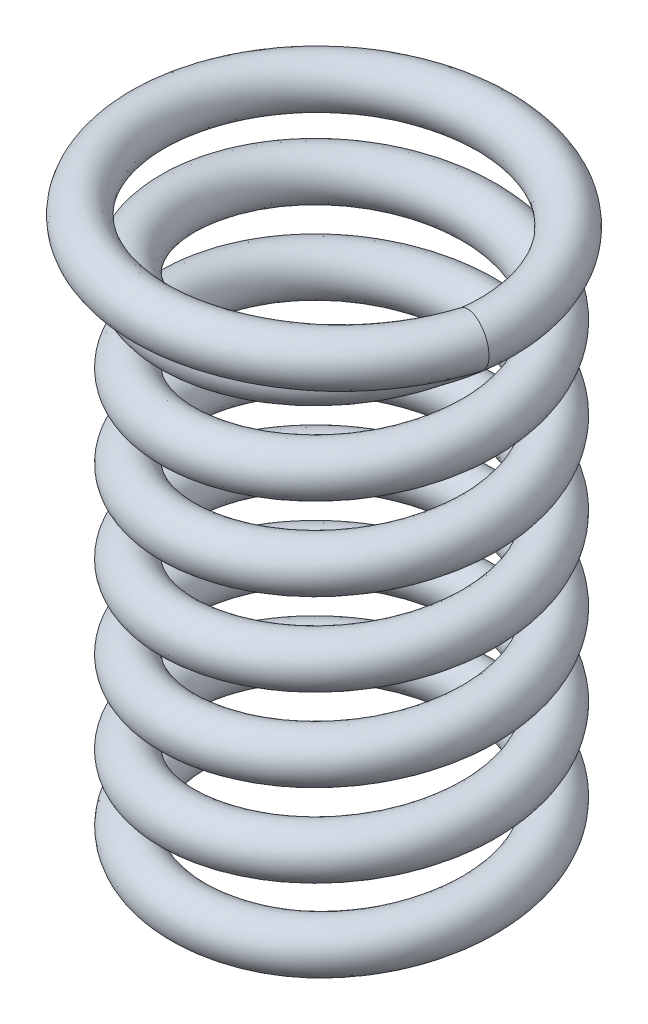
ISO-10303-21;
HEADER;
FILE_DESCRIPTION(('STEP AP214'),'2;1');
FILE_NAME('part.step','',(''),(''),'','','');
FILE_SCHEMA(('AUTOMOTIVE_DESIGN { 1 0 10303 214 1 1 1 1 }'));
ENDSEC;
DATA;
#1=APPLICATION_CONTEXT('core data for automotive mechanical design processes');
#2=APPLICATION_PROTOCOL_DEFINITION('international standard','automotive_design',2000,#1);
#3=PRODUCT_CONTEXT('',#1,'mechanical');
#4=PRODUCT('Part','Part','',(#3));
#5=PRODUCT_RELATED_PRODUCT_CATEGORY('part','',(#4));
#6=PRODUCT_DEFINITION_FORMATION('','',#4);
#7=PRODUCT_DEFINITION_CONTEXT('part definition',#1,'design');
#8=PRODUCT_DEFINITION('design','',#6,#7);
#9=PRODUCT_DEFINITION_SHAPE('','',#8);
#10=(LENGTH_UNIT() NAMED_UNIT(*) SI_UNIT(.MILLI.,.METRE.));
#11=(NAMED_UNIT(*) PLANE_ANGLE_UNIT() SI_UNIT($,.RADIAN.));
#12=(NAMED_UNIT(*) SI_UNIT($,.STERADIAN.) SOLID_ANGLE_UNIT());
#13=UNCERTAINTY_MEASURE_WITH_UNIT(LENGTH_MEASURE(1.E-05),#10,'distance_accuracy_value','');
#14=(GEOMETRIC_REPRESENTATION_CONTEXT(3) GLOBAL_UNCERTAINTY_ASSIGNED_CONTEXT((#13)) GLOBAL_UNIT_ASSIGNED_CONTEXT((#10,
#11,#12)) REPRESENTATION_CONTEXT('',''));
#15=CARTESIAN_POINT('',(0.,0.,0.));
#16=DIRECTION('',(0.,0.,1.));
#17=DIRECTION('',(1.,0.,0.));
#18=AXIS2_PLACEMENT_3D('',#15,#16,#17);
#19=CARTESIAN_POINT('',(0.,0.,0.));
#20=DIRECTION('',(0.,0.,-1.));
#21=DIRECTION('',(0.,-1.,0.));
#22=AXIS2_PLACEMENT_3D('',#19,#20,#21);
#23=PLANE('',#22);
#24=CARTESIAN_POINT('',(0.254186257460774,-6.2070918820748E-05,4.47218245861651E-09));
#25=CARTESIAN_POINT('',(0.254268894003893,-0.0379546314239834,4.47190489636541E-09));
#26=CARTESIAN_POINT('',(0.245301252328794,-0.0758243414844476,4.50112470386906E-09));
#27=CARTESIAN_POINT('',(0.228766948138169,-0.110143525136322,4.55503963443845E-09));
#28=CARTESIAN_POINT('',(0.212232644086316,-0.144462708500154,4.60895456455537E-09));
#29=CARTESIAN_POINT('',(0.188131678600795,-0.175231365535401,4.68756461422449E-09));
#30=CARTESIAN_POINT('',(0.158460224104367,-0.19884554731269,4.78432238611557E-09));
#31=CARTESIAN_POINT('',(0.0991173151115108,-0.246073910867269,4.97783792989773E-09));
#32=CARTESIAN_POINT('',(0.0174924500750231,-0.264684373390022,5.24394436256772E-09));
#33=CARTESIAN_POINT('',(-0.0564988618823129,-0.247906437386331,5.48525455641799E-09));
#34=CARTESIAN_POINT('',(-0.111992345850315,-0.235322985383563,5.66623720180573E-09));
#35=CARTESIAN_POINT('',(-0.163191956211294,-0.202833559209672,5.83327196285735E-09));
#36=CARTESIAN_POINT('',(-0.198604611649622,-0.15833534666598,5.94868979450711E-09));
#37=CARTESIAN_POINT('',(-0.204506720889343,-0.150918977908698,5.96792609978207E-09));
#38=CARTESIAN_POINT('',(-0.209970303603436,-0.143169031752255,5.98572860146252E-09));
#39=CARTESIAN_POINT('',(-0.2150432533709,-0.135135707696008,6.00226264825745E-09));
#40=CARTESIAN_POINT('',(-0.220116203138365,-0.127102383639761,6.01879669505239E-09));
#41=CARTESIAN_POINT('',(-0.224798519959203,-0.118785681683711,6.03406228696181E-09));
#42=CARTESIAN_POINT('',(-0.228955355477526,-0.110230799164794,6.04761476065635E-09));
#43=CARTESIAN_POINT('',(-0.262210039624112,-0.0417917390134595,6.15603455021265E-09));
#44=CARTESIAN_POINT('',(-0.261833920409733,0.0418908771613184,6.15481477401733E-09));
#45=CARTESIAN_POINT('',(-0.229015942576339,0.11024434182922,6.04780191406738E-09));
#46=CARTESIAN_POINT('',(-0.212606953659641,0.144421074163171,5.9942954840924E-09));
#47=CARTESIAN_POINT('',(-0.188087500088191,0.174765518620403,5.91434078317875E-09));
#48=CARTESIAN_POINT('',(-0.158331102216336,0.198526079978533,5.81731999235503E-09));
#49=CARTESIAN_POINT('',(-0.128574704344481,0.222286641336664,5.72029920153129E-09));
#50=CARTESIAN_POINT('',(-0.0935813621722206,0.239463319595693,5.60621232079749E-09));
#51=CARTESIAN_POINT('',(-0.0565936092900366,0.247825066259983,5.48560695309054E-09));
#52=CARTESIAN_POINT('',(0.0173818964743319,0.264548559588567,5.24439621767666E-09));
#53=CARTESIAN_POINT('',(0.0993350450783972,0.246012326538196,4.97711153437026E-09));
#54=CARTESIAN_POINT('',(0.158494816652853,0.1988059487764,4.78419687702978E-09));
#55=CARTESIAN_POINT('',(0.217638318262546,0.151612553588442,4.59133527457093E-09));
#56=CARTESIAN_POINT('',(0.254000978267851,0.075764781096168,4.47280279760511E-09));
#57=CARTESIAN_POINT('',(0.254186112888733,4.54820622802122E-07,4.47218294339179E-09));
#58=CARTESIAN_POINT('',(0.254186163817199,-2.03870990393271E-05,4.47218277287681E-09));
#59=CARTESIAN_POINT('',(0.254186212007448,-4.12290123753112E-05,4.47218261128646E-09));
#60=CARTESIAN_POINT('',(0.254186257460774,-6.2070918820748E-05,4.47218245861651E-09));
#61=(BOUNDED_CURVE() B_SPLINE_CURVE(3,(#24,#25,#26,#27,#28,#29,#30,#31,#32,#33,#34,#35,#36,#37,
#38,#39,#40,#41,#42,#43,#44,#45,#46,#47,#48,#49,#50,#51,#52,#53,#54,#55,#56,#57,#58,#59,#60),
.UNSPECIFIED.,.T.,.F.) B_SPLINE_CURVE_WITH_KNOTS((4,3,3,3,3,3,3,3,3,3,3,3,4),
(-0.999960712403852,-0.928532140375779,-0.857103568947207,-0.714246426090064,-0.607103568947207,
-0.589246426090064,-0.571389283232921,-0.428532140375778,-0.357103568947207,-0.285674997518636,
-0.142817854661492,0.,3.92875961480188E-05),
.UNSPECIFIED.) CURVE() GEOMETRIC_REPRESENTATION_ITEM() RATIONAL_B_SPLINE_CURVE((1.,1.,1.,1.,1.,
1.,1.,1.,1.,1.,1.,1.,1.,1.,1.,1.,1.,1.,1.,1.,1.,1.,1.,1.,1.,1.,1.,1.,1.,1.,1.,1.,1.,1.,1.,1.,1.)) REPRESENTATION_ITEM(''));
#62=CARTESIAN_POINT('',(0.254186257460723,-6.20709188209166E-05,2.23609122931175E-09));
#63=VERTEX_POINT('',#62);
#64=EDGE_CURVE('E11',#63,#63,#61,.T.);
#65=ORIENTED_EDGE('',*,*,#64,.T.);
#66=EDGE_LOOP('',(#65));
#67=FACE_BOUND('',#66,.T.);
#68=ADVANCED_FACE('F16',(#67),#23,.T.);
#69=CARTESIAN_POINT('',(0.25418625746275,-6.2071872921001E-05,0.));
#70=CARTESIAN_POINT('',(0.254192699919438,-6.20718729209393E-05,0.279252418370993));
#71=CARTESIAN_POINT('',(0.429908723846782,-0.000233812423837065,0.837441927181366));
#72=CARTESIAN_POINT('',(0.894004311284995,0.000214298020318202,1.19285629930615));
#73=CARTESIAN_POINT('',(1.56165412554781,-0.000932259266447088,1.43836639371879));
#74=CARTESIAN_POINT('',(2.19349450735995,0.00600650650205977,1.35977361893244));
#75=CARTESIAN_POINT('',(2.6708119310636,0.06132675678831,0.906492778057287));
#76=CARTESIAN_POINT('',(2.83010725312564,0.0887307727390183,0.66827071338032));
#77=CARTESIAN_POINT('',(2.88971262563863,0.103780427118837,0.536389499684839));
#78=CARTESIAN_POINT('',(2.98820782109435,0.133370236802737,0.266973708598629));
#79=CARTESIAN_POINT('',(3.03795639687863,0.177919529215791,-0.173958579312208));
#80=CARTESIAN_POINT('',(2.80581481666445,0.244621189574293,-0.795212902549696));
#81=CARTESIAN_POINT('',(2.39670472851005,0.300249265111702,-1.17101390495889));
#82=CARTESIAN_POINT('',(1.9961775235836,0.344732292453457,-1.33202703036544));
#83=CARTESIAN_POINT('',(1.34967183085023,0.411469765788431,-1.43946155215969));
#84=CARTESIAN_POINT('',(0.593802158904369,0.489324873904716,-1.08234209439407));
#85=CARTESIAN_POINT('',(0.229268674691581,0.578305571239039,-0.270016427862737));
#86=CARTESIAN_POINT('',(0.257122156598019,0.645039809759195,0.39149933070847));
#87=CARTESIAN_POINT('',(0.584939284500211,0.711774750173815,0.971058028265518));
#88=CARTESIAN_POINT('',(1.13869813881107,0.778509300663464,1.33713299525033));
#89=CARTESIAN_POINT('',(1.79910294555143,0.845244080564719,1.41274214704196));
#90=CARTESIAN_POINT('',(2.42142046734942,0.911978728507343,1.17982145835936));
#91=CARTESIAN_POINT('',(2.8703869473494,0.978713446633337,0.690027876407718));
#92=CARTESIAN_POINT('',(3.04793855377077,1.04544812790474,0.0496486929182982));
#93=CARTESIAN_POINT('',(2.91547425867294,1.1121828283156,-0.601465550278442));
#94=CARTESIAN_POINT('',(2.50181550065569,1.17891751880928,-1.12151312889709));
#95=CARTESIAN_POINT('',(1.89716363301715,1.24565221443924,-1.3970631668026));
#96=CARTESIAN_POINT('',(1.23330758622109,1.31238690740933,-1.36808131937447));
#97=CARTESIAN_POINT('',(0.654972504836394,1.37912160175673,-1.04087425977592));
#98=CARTESIAN_POINT('',(0.288212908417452,1.44585629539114,-0.486763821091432));
#99=CARTESIAN_POINT('',(0.213000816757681,1.51259098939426,0.17343794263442));
#100=CARTESIAN_POINT('',(0.445692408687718,1.57932568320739,0.795866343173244));
#101=CARTESIAN_POINT('',(0.935603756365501,1.64606037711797,1.24475663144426));
#102=CARTESIAN_POINT('',(1.57593687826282,1.71279507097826,1.42235120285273));
#103=CARTESIAN_POINT('',(2.22707270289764,1.77952976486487,1.2898679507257));
#104=CARTESIAN_POINT('',(2.74710967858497,1.84626445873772,0.876218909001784));
#105=CARTESIAN_POINT('',(3.0226645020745,1.91299915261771,0.271561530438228));
#106=CARTESIAN_POINT('',(2.99368149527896,1.979733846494,-0.39229066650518));
#107=CARTESIAN_POINT('',(2.66647249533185,2.0464685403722,-0.970629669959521));
#108=CARTESIAN_POINT('',(2.1123679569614,2.11320323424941,-1.33738353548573));
#109=CARTESIAN_POINT('',(1.45215377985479,2.17993792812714,-1.41260549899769));
#110=CARTESIAN_POINT('',(0.829748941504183,2.2466726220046,-1.17989779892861));
#111=CARTESIAN_POINT('',(0.380829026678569,2.3134073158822,-0.689987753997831));
#112=CARTESIAN_POINT('',(0.203253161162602,2.38014200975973,-0.0496695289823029));
#113=CARTESIAN_POINT('',(0.335730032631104,2.44687670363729,0.601476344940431));
#114=CARTESIAN_POINT('',(0.749382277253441,2.51361139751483,1.12150753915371));
#115=CARTESIAN_POINT('',(1.354037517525,2.58034609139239,1.39706606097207));
#116=CARTESIAN_POINT('',(2.0178918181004,2.64708078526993,1.3680798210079));
#117=CARTESIAN_POINT('',(2.59622780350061,2.71381547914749,1.04087503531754));
#118=CARTESIAN_POINT('',(2.9629869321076,2.78055017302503,0.48676342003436));
#119=CARTESIAN_POINT('',(3.03819926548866,2.84728486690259,-0.173437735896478));
#120=CARTESIAN_POINT('',(2.80550754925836,2.91401956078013,-0.795866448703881));
#121=CARTESIAN_POINT('',(2.31559626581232,2.9807542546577,-1.24475657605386));
#122=CARTESIAN_POINT('',(1.67526310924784,3.04748894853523,-1.42235123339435));
#123=CARTESIAN_POINT('',(1.02412730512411,3.1142236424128,-1.28986793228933));
#124=CARTESIAN_POINT('',(0.504090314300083,3.18095833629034,-0.876218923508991));
#125=CARTESIAN_POINT('',(0.228535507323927,3.24769303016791,-0.271561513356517));
#126=CARTESIAN_POINT('',(0.25751848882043,3.31442772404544,0.392290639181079));
#127=CARTESIAN_POINT('',(0.584727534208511,3.38116241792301,0.9706297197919));
#128=CARTESIAN_POINT('',(1.13883198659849,3.44789711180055,1.33738344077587));
#129=CARTESIAN_POINT('',(1.79904632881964,3.51463180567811,1.41260568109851));
#130=CARTESIAN_POINT('',(2.42145084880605,3.58136649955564,1.17989744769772));
#131=CARTESIAN_POINT('',(2.87037137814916,3.64810119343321,0.689988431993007));
#132=CARTESIAN_POINT('',(3.04794605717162,3.71483588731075,0.0496682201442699));
#133=CARTESIAN_POINT('',(2.91547147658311,3.78157058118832,-0.601473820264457));
#134=CARTESIAN_POINT('',(2.50181481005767,3.84830527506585,-1.1215123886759));
#135=CARTESIAN_POINT('',(1.8971680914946,3.91503996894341,-1.39705694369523));
#136=CARTESIAN_POINT('',(1.23329751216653,3.98177466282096,-1.3680950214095));
#137=CARTESIAN_POINT('',(0.654986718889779,4.04850935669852,-1.04087638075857));
#138=CARTESIAN_POINT('',(0.288210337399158,4.11524405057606,-0.486763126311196));
#139=CARTESIAN_POINT('',(0.212997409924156,4.18197874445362,0.173443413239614));
#140=CARTESIAN_POINT('',(0.445700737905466,4.24871343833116,0.795852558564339));
#141=CARTESIAN_POINT('',(0.935612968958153,4.31544813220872,1.24477016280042));
#142=CARTESIAN_POINT('',(1.57593015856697,4.38218282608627,1.42234731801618));
#143=CARTESIAN_POINT('',(2.22707638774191,4.44891751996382,1.28986960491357));
#144=CARTESIAN_POINT('',(2.74710774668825,4.51565221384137,0.876218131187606));
#145=CARTESIAN_POINT('',(3.02266550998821,4.58238690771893,0.271561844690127));
#146=CARTESIAN_POINT('',(2.99368096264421,4.64912160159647,-0.392290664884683));
#147=CARTESIAN_POINT('',(2.66647279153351,4.71585629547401,-0.970629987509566));
#148=CARTESIAN_POINT('',(2.11236776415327,4.78259098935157,-1.33738275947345));
#149=CARTESIAN_POINT('',(1.45215395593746,4.84932568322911,-1.41260708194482));
#150=CARTESIAN_POINT('',(0.829748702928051,4.91606037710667,-1.17989469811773));
#151=CARTESIAN_POINT('',(0.38082943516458,4.98279507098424,-0.689993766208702));
#152=CARTESIAN_POINT('',(0.203252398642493,5.04952976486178,-0.0496578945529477));
#153=CARTESIAN_POINT('',(0.335731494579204,5.11626445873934,0.601453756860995));
#154=CARTESIAN_POINT('',(0.749379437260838,5.18299915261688,1.1215522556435));
#155=CARTESIAN_POINT('',(1.25326582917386,5.23861139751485,1.35106651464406));
#156=CARTESIAN_POINT('',(1.68597957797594,5.2831011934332,1.38264045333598));
#157=CARTESIAN_POINT('',(2.11423360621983,5.32759098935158,1.31352118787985));
#158=CARTESIAN_POINT('',(2.59627683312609,5.38320323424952,1.04084633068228));
#159=CARTESIAN_POINT('',(2.84062722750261,5.4276930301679,0.671480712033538));
#160=CARTESIAN_POINT('',(2.91430737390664,5.44993792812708,0.469051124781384));
#161=CARTESIAN_POINT('',(0.254020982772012,0.0757230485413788,0.));
#162=CARTESIAN_POINT('',(0.254029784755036,0.075723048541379,0.279287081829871));
#163=CARTESIAN_POINT('',(0.429762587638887,0.0755513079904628,0.837541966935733));
#164=CARTESIAN_POINT('',(0.893916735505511,0.0759994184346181,1.19300033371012));
#165=CARTESIAN_POINT('',(1.56164594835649,0.0748528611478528,1.43853954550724));
#166=CARTESIAN_POINT('',(2.19356325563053,0.0817916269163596,1.3599372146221));
#167=CARTESIAN_POINT('',(2.67093785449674,0.13711187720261,0.906602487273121));
#168=CARTESIAN_POINT('',(2.83025235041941,0.164515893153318,0.668350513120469));
#169=CARTESIAN_POINT('',(2.88986510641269,0.179565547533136,0.536454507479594));
#170=CARTESIAN_POINT('',(2.98837157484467,0.209155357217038,0.267005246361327));
#171=CARTESIAN_POINT('',(3.03812709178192,0.25370464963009,-0.173978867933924));
#172=CARTESIAN_POINT('',(2.80595666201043,0.320406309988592,-0.795309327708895));
#173=CARTESIAN_POINT('',(2.39679806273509,0.376034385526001,-1.17115427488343));
#174=CARTESIAN_POINT('',(1.99622190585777,0.420517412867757,-1.33218815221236));
#175=CARTESIAN_POINT('',(1.34963892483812,0.487254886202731,-1.43963430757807));
#176=CARTESIAN_POINT('',(0.593677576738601,0.565109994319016,-1.08247296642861));
#177=CARTESIAN_POINT('',(0.229100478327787,0.654090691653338,-0.270048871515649));
#178=CARTESIAN_POINT('',(0.25695720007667,0.720824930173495,0.391546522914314));
#179=CARTESIAN_POINT('',(0.584813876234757,0.787559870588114,0.971174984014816));
#180=CARTESIAN_POINT('',(1.13863945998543,0.854294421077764,1.33729425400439));
#181=CARTESIAN_POINT('',(1.79912385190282,0.921029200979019,1.41291232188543));
#182=CARTESIAN_POINT('',(2.42151637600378,0.987763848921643,1.17996367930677));
#183=CARTESIAN_POINT('',(2.87053696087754,1.05449856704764,0.690111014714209));
#184=CARTESIAN_POINT('',(3.04810996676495,1.12123324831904,0.0496546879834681));
#185=CARTESIAN_POINT('',(2.91562970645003,1.1879679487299,-0.601538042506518));
#186=CARTESIAN_POINT('',(2.50192109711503,1.25470263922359,-1.12164828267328));
#187=CARTESIAN_POINT('',(1.89719636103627,1.32143733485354,-1.39723153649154));
#188=CARTESIAN_POINT('',(1.23326030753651,1.38817202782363,-1.3682461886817));
#189=CARTESIAN_POINT('',(0.654855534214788,1.45490672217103,-1.04099970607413));
#190=CARTESIAN_POINT('',(0.288051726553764,1.52164141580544,-0.486822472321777));
#191=CARTESIAN_POINT('',(0.212830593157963,1.58837610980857,0.173458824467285));
#192=CARTESIAN_POINT('',(0.445550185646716,1.65511080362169,0.795962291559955));
#193=CARTESIAN_POINT('',(0.935520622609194,1.72184549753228,1.24490661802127));
#194=CARTESIAN_POINT('',(1.57593088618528,1.78858019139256,1.42252262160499));
#195=CARTESIAN_POINT('',(2.22714519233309,1.85531488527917,1.29002339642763));
#196=CARTESIAN_POINT('',(2.7472448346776,1.92204957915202,0.876324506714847));
#197=CARTESIAN_POINT('',(3.02283286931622,1.98878427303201,0.271594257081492));
#198=CARTESIAN_POINT('',(2.99384636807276,2.0555189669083,-0.39233794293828));
#199=CARTESIAN_POINT('',(2.66659793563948,2.12225366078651,-0.970746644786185));
#200=CARTESIAN_POINT('',(2.11242661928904,2.18898835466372,-1.33754470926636));
#201=CARTESIAN_POINT('',(1.4521328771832,2.25572304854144,-1.41277573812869));
#202=CARTESIAN_POINT('',(0.829653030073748,2.3224577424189,-1.18003999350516));
#203=CARTESIAN_POINT('',(0.380679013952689,2.3891924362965,-0.69007090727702));
#204=CARTESIAN_POINT('',(0.203081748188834,2.45592713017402,-0.0496755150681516));
#205=CARTESIAN_POINT('',(0.335574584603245,2.52266182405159,0.601548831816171));
#206=CARTESIAN_POINT('',(0.749276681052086,2.58939651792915,1.12164269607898));
#207=CARTESIAN_POINT('',(1.35400478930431,2.65613121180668,1.39723442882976));
#208=CARTESIAN_POINT('',(2.01793909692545,2.72286590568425,1.36824469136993));
#209=CARTESIAN_POINT('',(2.59634477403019,2.78960059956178,1.04100048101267));
#210=CARTESIAN_POINT('',(2.96314811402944,2.85633529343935,0.486822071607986));
#211=CARTESIAN_POINT('',(3.0383694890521,2.92306998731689,-0.173458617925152));
#212=CARTESIAN_POINT('',(2.80564977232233,2.98980468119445,-0.795962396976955));
#213=CARTESIAN_POINT('',(2.31567939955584,3.05653937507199,-1.24490656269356));
#214=CARTESIAN_POINT('',(1.67526910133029,3.12327406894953,-1.4225226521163));
#215=CARTESIAN_POINT('',(1.02405481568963,3.19000876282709,-1.29002337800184));
#216=CARTESIAN_POINT('',(0.503955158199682,3.25674345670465,-0.876324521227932));
#217=CARTESIAN_POINT('',(0.228367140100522,3.32347815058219,-0.271594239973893));
#218=CARTESIAN_POINT('',(0.257353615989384,3.39021284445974,0.392337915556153));
#219=CARTESIAN_POINT('',(0.584602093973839,3.4569475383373,0.970746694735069));
#220=CARTESIAN_POINT('',(1.13877332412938,3.52368223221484,1.33754461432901));
#221=CARTESIAN_POINT('',(1.79906723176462,3.5904169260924,1.41277592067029));
#222=CARTESIAN_POINT('',(2.42154675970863,3.65715161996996,1.18003964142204));
#223=CARTESIAN_POINT('',(2.87052139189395,3.72388631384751,0.690071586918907));
#224=CARTESIAN_POINT('',(3.04811746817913,3.79062100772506,0.0496742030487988));
#225=CARTESIAN_POINT('',(2.91562692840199,3.85735570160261,-0.601546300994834));
#226=CARTESIAN_POINT('',(2.50192039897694,3.92409039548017,-1.12164755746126));
#227=CARTESIAN_POINT('',(1.89720083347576,3.99082508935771,-1.39722528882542));
#228=CARTESIAN_POINT('',(1.23325020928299,4.05755978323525,-1.3682599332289));
#229=CARTESIAN_POINT('',(0.65486976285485,4.12429447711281,-1.04100179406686));
#230=CARTESIAN_POINT('',(0.288049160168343,4.19102917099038,-0.486821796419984));
#231=CARTESIAN_POINT('',(0.212827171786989,4.25776386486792,0.173464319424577));
#232=CARTESIAN_POINT('',(0.445558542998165,4.32449855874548,0.795948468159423));
#233=CARTESIAN_POINT('',(0.935529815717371,4.39123325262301,1.24492017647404));
#234=CARTESIAN_POINT('',(1.57592417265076,4.45796794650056,1.4225187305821));
#235=CARTESIAN_POINT('',(2.22714887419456,4.52470264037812,1.29002505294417));
#236=CARTESIAN_POINT('',(2.74724290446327,4.59143733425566,0.87632372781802));
#237=CARTESIAN_POINT('',(3.02283387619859,4.65817202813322,0.271594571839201));
#238=CARTESIAN_POINT('',(2.99384583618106,4.72490672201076,-0.392337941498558));
#239=CARTESIAN_POINT('',(2.66659823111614,4.79164141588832,-0.970746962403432));
#240=CARTESIAN_POINT('',(2.11242642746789,4.85837610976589,-1.33754393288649));
#241=CARTESIAN_POINT('',(1.45213305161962,4.92511080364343,-1.41277732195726));
#242=CARTESIAN_POINT('',(0.829652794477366,4.99184549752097,-1.18003689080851));
#243=CARTESIAN_POINT('',(0.380679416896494,5.05858019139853,-0.690076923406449));
#244=CARTESIAN_POINT('',(0.203080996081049,5.12531488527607,-0.0496638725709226));
#245=CARTESIAN_POINT('',(0.335576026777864,5.19204957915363,0.601526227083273));
#246=CARTESIAN_POINT('',(0.749273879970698,5.25878427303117,1.12168744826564));
#247=CARTESIAN_POINT('',(1.2532208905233,5.31439651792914,1.35122927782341));
#248=CARTESIAN_POINT('',(1.68598694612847,5.35888631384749,1.38280713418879));
#249=CARTESIAN_POINT('',(2.11429226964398,5.40337610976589,1.31367946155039));
#250=CARTESIAN_POINT('',(2.59639425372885,5.45898835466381,1.04097177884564));
#251=CARTESIAN_POINT('',(2.84077300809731,5.50347815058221,0.671561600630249));
#252=CARTESIAN_POINT('',(2.91446268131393,5.52572304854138,0.469107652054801));
#253=CARTESIAN_POINT('',(0.181288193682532,0.227476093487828,0.));
#254=CARTESIAN_POINT('',(0.181283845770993,0.227476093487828,0.294091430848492));
#255=CARTESIAN_POINT('',(0.366360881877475,0.227304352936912,0.881960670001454));
#256=CARTESIAN_POINT('',(0.855113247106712,0.227752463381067,1.25626175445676));
#257=CARTESIAN_POINT('',(1.55825727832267,0.226605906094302,1.51482425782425));
#258=CARTESIAN_POINT('',(2.22367971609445,0.233544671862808,1.43205425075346));
#259=CARTESIAN_POINT('',(2.72637078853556,0.288864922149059,0.954675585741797));
#260=CARTESIAN_POINT('',(2.89413363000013,0.316268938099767,0.703796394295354));
#261=CARTESIAN_POINT('',(2.95690640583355,0.331318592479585,0.564899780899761));
#262=CARTESIAN_POINT('',(3.06063997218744,0.360908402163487,0.281167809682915));
#263=CARTESIAN_POINT('',(3.11302849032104,0.405457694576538,-0.18320860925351));
#264=CARTESIAN_POINT('',(2.86855144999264,0.47215935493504,-0.837479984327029));
#265=CARTESIAN_POINT('',(2.43769120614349,0.527787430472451,-1.23326319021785));
#266=CARTESIAN_POINT('',(2.01587703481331,0.572270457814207,-1.40282867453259));
#267=CARTESIAN_POINT('',(1.33500311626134,0.639007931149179,-1.5159801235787));
#268=CARTESIAN_POINT('',(0.538957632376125,0.716863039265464,-1.13987238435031));
#269=CARTESIAN_POINT('',(0.155045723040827,0.805843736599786,-0.28436972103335));
#270=CARTESIAN_POINT('',(0.184380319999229,0.872577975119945,0.4123095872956));
#271=CARTESIAN_POINT('',(0.529622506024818,0.939312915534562,1.02267535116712));
#272=CARTESIAN_POINT('',(1.1128166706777,1.00604746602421,1.4082083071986));
#273=CARTESIAN_POINT('',(1.8083255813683,1.07278224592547,1.48783741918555));
#274=CARTESIAN_POINT('',(2.46372262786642,1.1395168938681,1.24253518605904));
#275=CARTESIAN_POINT('',(2.93655411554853,1.20625161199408,0.726706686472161));
#276=CARTESIAN_POINT('',(3.12354354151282,1.27298629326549,0.0522877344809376));
#277=CARTESIAN_POINT('',(2.98403805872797,1.33972099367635,-0.633436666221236));
#278=CARTESIAN_POINT('',(2.54839109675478,1.40645568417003,-1.18112764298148));
#279=CARTESIAN_POINT('',(1.91159870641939,1.47319037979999,-1.47132461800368));
#280=CARTESIAN_POINT('',(1.21245513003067,1.53992507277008,-1.44080226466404));
#281=CARTESIAN_POINT('',(0.603378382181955,1.60665976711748,-1.09620233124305));
#282=CARTESIAN_POINT('',(0.217123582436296,1.6733944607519,-0.512638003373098));
#283=CARTESIAN_POINT('',(0.137913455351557,1.74012915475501,0.182657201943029));
#284=CARTESIAN_POINT('',(0.382974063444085,1.80686384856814,0.838170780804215));
#285=CARTESIAN_POINT('',(0.89892662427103,1.87359854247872,1.31092229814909));
#286=CARTESIAN_POINT('',(1.57329704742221,1.94033323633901,1.49795684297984));
#287=CARTESIAN_POINT('',(2.25904421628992,2.00706793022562,1.35843142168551));
#288=CARTESIAN_POINT('',(2.8067239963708,2.07380262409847,0.922794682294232));
#289=CARTESIAN_POINT('',(3.09692603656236,2.14053731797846,0.285996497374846));
#290=CARTESIAN_POINT('',(3.06640243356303,2.20727201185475,-0.41314303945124));
#291=CARTESIAN_POINT('',(2.72180050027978,2.27400670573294,-1.02222388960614));
#292=CARTESIAN_POINT('',(2.13824230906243,2.34074139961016,-1.40847270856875));
#293=CARTESIAN_POINT('',(1.44293417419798,2.40747609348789,-1.48769312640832));
#294=CARTESIAN_POINT('',(0.787445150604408,2.47421078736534,-1.24261575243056));
#295=CARTESIAN_POINT('',(0.31466271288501,2.54094548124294,-0.726664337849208));
#296=CARTESIAN_POINT('',(0.127647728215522,2.60768017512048,-0.0523097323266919));
#297=CARTESIAN_POINT('',(0.26716646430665,2.67441486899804,0.633448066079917));
#298=CARTESIAN_POINT('',(0.702806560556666,2.74114956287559,1.18112173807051));
#299=CARTESIAN_POINT('',(1.33960250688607,2.80788425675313,1.4713276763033));
#300=CARTESIAN_POINT('',(2.03874424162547,2.87461895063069,1.44080068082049));
#301=CARTESIAN_POINT('',(2.64782194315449,2.94135364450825,1.09620315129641));
#302=CARTESIAN_POINT('',(3.03407624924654,3.00808833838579,0.512637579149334));
#303=CARTESIAN_POINT('',(3.11328663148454,3.07482303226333,-0.182656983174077));
#304=CARTESIAN_POINT('',(2.86822589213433,3.14155772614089,-0.83817089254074));
#305=CARTESIAN_POINT('',(2.35227339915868,3.20829242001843,-1.31092223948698));
#306=CARTESIAN_POINT('',(1.67790293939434,3.27502711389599,-1.49795687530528));
#307=CARTESIAN_POINT('',(0.992155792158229,3.34176180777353,-1.3584314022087));
#308=CARTESIAN_POINT('',(0.444475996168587,3.4084965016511,-0.922794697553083));
#309=CARTESIAN_POINT('',(0.154273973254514,3.47523119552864,-0.285996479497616));
#310=CARTESIAN_POINT('',(0.184797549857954,3.5419658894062,0.413143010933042));
#311=CARTESIAN_POINT('',(0.529399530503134,3.60870058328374,1.02222394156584));
#312=CARTESIAN_POINT('',(1.11295763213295,3.6754352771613,1.40847260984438));
#313=CARTESIAN_POINT('',(1.80826593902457,3.74216997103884,1.48769331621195));
#314=CARTESIAN_POINT('',(2.4637546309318,3.80890466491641,1.2426153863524));
#315=CARTESIAN_POINT('',(2.93653770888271,3.87563935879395,0.72666504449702));
#316=CARTESIAN_POINT('',(3.12355145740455,3.94237405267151,0.0523083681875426));
#317=CARTESIAN_POINT('',(2.98403510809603,4.00910874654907,-0.633445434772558));
#318=CARTESIAN_POINT('',(2.54839040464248,4.07584344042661,-1.1811267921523));
#319=CARTESIAN_POINT('',(1.91160333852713,4.14257813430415,-1.47131817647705));
#320=CARTESIAN_POINT('',(1.21244462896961,4.20931282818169,-1.44081650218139));
#321=CARTESIAN_POINT('',(0.603393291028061,4.27604752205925,-1.09620472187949));
#322=CARTESIAN_POINT('',(0.217120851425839,4.34278221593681,-0.512637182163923));
#323=CARTESIAN_POINT('',(0.137909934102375,4.40951690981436,0.182662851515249));
#324=CARTESIAN_POINT('',(0.382982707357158,4.47625160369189,0.838156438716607));
#325=CARTESIAN_POINT('',(0.898936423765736,4.54298629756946,1.31093642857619));
#326=CARTESIAN_POINT('',(1.57328993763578,4.60972099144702,1.49795277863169));
#327=CARTESIAN_POINT('',(2.25904811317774,4.67645568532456,1.35843315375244));
#328=CARTESIAN_POINT('',(2.80672195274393,4.74319037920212,0.922793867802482));
#329=CARTESIAN_POINT('',(3.09692710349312,4.80992507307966,0.285996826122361));
#330=CARTESIAN_POINT('',(3.06640186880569,4.87665976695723,-0.41314303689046));
#331=CARTESIAN_POINT('',(2.72180081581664,4.94339446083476,-1.02222422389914));
#332=CARTESIAN_POINT('',(2.13824210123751,5.01012915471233,-1.40847189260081));
#333=CARTESIAN_POINT('',(1.44293436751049,5.07686384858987,-1.48769479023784));
#334=CARTESIAN_POINT('',(0.787444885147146,5.14359854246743,-1.24261249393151));
#335=CARTESIAN_POINT('',(0.314663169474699,5.21033323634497,-0.726670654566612));
#336=CARTESIAN_POINT('',(0.12764687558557,5.27706793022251,-0.0522975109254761));
#337=CARTESIAN_POINT('',(0.267168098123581,5.34380262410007,0.633424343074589));
#338=CARTESIAN_POINT('',(0.702803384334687,5.41053731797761,1.18116868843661));
#339=CARTESIAN_POINT('',(1.23347456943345,5.46614956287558,1.42288329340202));
#340=CARTESIAN_POINT('',(1.68918864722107,5.51063935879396,1.45613502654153));
#341=CARTESIAN_POINT('',(2.14020818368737,5.55512915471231,1.38334206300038));
#342=CARTESIAN_POINT('',(2.64787148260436,5.61074139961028,1.09617289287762));
#343=CARTESIAN_POINT('',(2.90521555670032,5.65523119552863,0.707173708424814));
#344=CARTESIAN_POINT('',(2.98280914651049,5.67747609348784,0.493983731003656));
#345=CARTESIAN_POINT('',(-0.0235946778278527,0.273816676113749,0.));
#346=CARTESIAN_POINT('',(-0.0235851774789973,0.273816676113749,0.335815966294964));
#347=CARTESIAN_POINT('',(0.187718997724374,0.273644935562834,1.00706579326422));
#348=CARTESIAN_POINT('',(0.745819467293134,0.274093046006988,1.43447049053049));
#349=CARTESIAN_POINT('',(1.54870148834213,0.272946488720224,1.72970849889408));
#350=CARTESIAN_POINT('',(2.30852221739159,0.279885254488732,1.63519663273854));
#351=CARTESIAN_POINT('',(2.88252040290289,0.33520550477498,1.09010395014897));
#352=CARTESIAN_POINT('',(3.07408110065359,0.362609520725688,0.803628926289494));
#353=CARTESIAN_POINT('',(3.14575973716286,0.377659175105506,0.645035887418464));
#354=CARTESIAN_POINT('',(3.26420476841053,0.407248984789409,0.321048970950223));
#355=CARTESIAN_POINT('',(3.32403066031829,0.451798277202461,-0.209193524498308));
#356=CARTESIAN_POINT('',(3.04486797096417,0.518499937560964,-0.956284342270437));
#357=CARTESIAN_POINT('',(2.55289290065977,0.574128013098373,-1.40820313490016));
#358=CARTESIAN_POINT('',(2.07123808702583,0.618611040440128,-1.60183059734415));
#359=CARTESIAN_POINT('',(1.29378262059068,0.685348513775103,-1.73102508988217));
#360=CARTESIAN_POINT('',(0.384810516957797,0.763203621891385,-1.30157166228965));
#361=CARTESIAN_POINT('',(-0.0535592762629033,0.85218431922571,-0.324708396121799));
#362=CARTESIAN_POINT('',(-0.0200641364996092,0.918918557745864,0.47079783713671));
#363=CARTESIAN_POINT('',(0.374152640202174,0.985653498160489,1.16774654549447));
#364=CARTESIAN_POINT('',(1.04007578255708,1.05238804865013,1.60797042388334));
#365=CARTESIAN_POINT('',(1.83424610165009,1.11912282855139,1.6988941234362));
#366=CARTESIAN_POINT('',(2.58261453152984,1.18585747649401,1.41879525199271));
#367=CARTESIAN_POINT('',(3.12251952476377,1.25259219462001,0.829793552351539));
#368=CARTESIAN_POINT('',(3.33603435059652,1.3193268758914,0.0597050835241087));
#369=CARTESIAN_POINT('',(3.17673930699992,1.38606157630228,-0.723292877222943));
#370=CARTESIAN_POINT('',(2.67929364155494,1.45279626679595,-1.34867649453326));
#371=CARTESIAN_POINT('',(1.95216906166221,1.51953096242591,-1.68003941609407));
#372=CARTESIAN_POINT('',(1.15384844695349,1.586265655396,-1.64518726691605));
#373=CARTESIAN_POINT('',(0.458371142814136,1.6530003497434,-1.25170416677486));
#374=CARTESIAN_POINT('',(0.0173240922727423,1.71973504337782,-0.585358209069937));
#375=CARTESIAN_POINT('',(-0.0731222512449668,1.78646973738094,0.208567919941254));
#376=CARTESIAN_POINT('',(0.206701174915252,1.85320443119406,0.957069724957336));
#377=CARTESIAN_POINT('',(0.795844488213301,1.91993912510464,1.49688305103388));
#378=CARTESIAN_POINT('',(1.56587756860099,1.98667381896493,1.71044956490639));
#379=CARTESIAN_POINT('',(2.34890147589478,2.05340851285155,1.55113172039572));
#380=CARTESIAN_POINT('',(2.97427234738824,2.12014320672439,1.05369774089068));
#381=CARTESIAN_POINT('',(3.30564101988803,2.18687790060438,0.326566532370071));
#382=CARTESIAN_POINT('',(3.27078748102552,2.25361259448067,-0.471749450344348));
#383=CARTESIAN_POINT('',(2.87730204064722,2.32034728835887,-1.16723147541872));
#384=CARTESIAN_POINT('',(2.21096319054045,2.38708198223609,-1.60827162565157));
#385=CARTESIAN_POINT('',(1.41702211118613,2.45381667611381,-1.6987298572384));
#386=CARTESIAN_POINT('',(0.668548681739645,2.52055136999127,-1.41888702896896));
#387=CARTESIAN_POINT('',(0.12869968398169,2.58728606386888,-0.829745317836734));
#388=CARTESIAN_POINT('',(-0.0848443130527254,2.6540207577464,-0.0597301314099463));
#389=CARTESIAN_POINT('',(0.0744658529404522,2.72075545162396,0.723305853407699));
#390=CARTESIAN_POINT('',(0.571903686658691,2.7874901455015,1.3486697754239));
#391=CARTESIAN_POINT('',(1.29903232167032,2.85422483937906,1.68004289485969));
#392=CARTESIAN_POINT('',(2.09735083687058,2.9209595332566,1.64518546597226));
#393=CARTESIAN_POINT('',(2.79282922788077,2.98769422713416,1.25170509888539));
#394=CARTESIAN_POINT('',(3.23387571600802,3.0544289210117,0.585357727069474));
#395=CARTESIAN_POINT('',(3.32432235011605,3.12116361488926,-0.208567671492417));
#396=CARTESIAN_POINT('',(3.04449877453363,3.1878983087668,-0.957069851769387));
#397=CARTESIAN_POINT('',(2.45535553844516,3.25463300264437,-1.49688298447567));
#398=CARTESIAN_POINT('',(1.68532241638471,3.32136769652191,-1.71044960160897));
#399=CARTESIAN_POINT('',(0.902298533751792,3.38810239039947,-1.55113169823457));
#400=CARTESIAN_POINT('',(0.276927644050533,3.45483708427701,-1.0536977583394));
#401=CARTESIAN_POINT('',(-0.0544410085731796,3.52157177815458,-0.32656651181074));
#402=CARTESIAN_POINT('',(-0.0195875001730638,3.58830647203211,0.471749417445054));
#403=CARTESIAN_POINT('',(0.373897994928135,3.65504116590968,1.16723153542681));
#404=CARTESIAN_POINT('',(1.04023674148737,3.72177585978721,1.60827151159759));
#405=CARTESIAN_POINT('',(1.83417801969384,3.78851055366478,1.69873007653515));
#406=CARTESIAN_POINT('',(2.58265106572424,3.85524524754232,1.41888660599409));
#407=CARTESIAN_POINT('',(3.12250080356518,3.92197994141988,0.829746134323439));
#408=CARTESIAN_POINT('',(3.33604337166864,3.98871463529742,0.0597285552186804));
#409=CARTESIAN_POINT('',(3.17673596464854,4.05544932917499,-0.723302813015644));
#410=CARTESIAN_POINT('',(2.679292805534,4.12218402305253,-1.34867561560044));
#411=CARTESIAN_POINT('',(1.95217443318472,4.18891871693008,-1.68003191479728));
#412=CARTESIAN_POINT('',(1.1538363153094,4.25565341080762,-1.64520377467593));
#413=CARTESIAN_POINT('',(0.458388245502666,4.32238810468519,-1.25170669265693));
#414=CARTESIAN_POINT('',(0.0173210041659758,4.38912279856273,-0.585357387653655));
#415=CARTESIAN_POINT('',(-0.0731263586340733,4.4558574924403,0.208574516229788));
#416=CARTESIAN_POINT('',(0.206711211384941,4.52259218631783,0.957053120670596));
#417=CARTESIAN_POINT('',(0.795855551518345,4.5893268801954,1.49689934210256));
#418=CARTESIAN_POINT('',(1.56586949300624,4.65606157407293,1.71044488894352));
#419=CARTESIAN_POINT('',(2.34890590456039,4.7227962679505,1.55113371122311));
#420=CARTESIAN_POINT('',(2.97427002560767,4.78953096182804,1.05369680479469));
#421=CARTESIAN_POINT('',(3.30564223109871,4.8562656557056,0.326566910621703));
#422=CARTESIAN_POINT('',(3.27078684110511,4.92300034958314,-0.47174944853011));
#423=CARTESIAN_POINT('',(2.87730239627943,4.98973504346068,-1.16723185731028));
#424=CARTESIAN_POINT('',(2.21096295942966,5.05646973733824,-1.60827069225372));
#425=CARTESIAN_POINT('',(1.41702232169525,5.12320443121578,-1.69873176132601));
#426=CARTESIAN_POINT('',(0.668548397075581,5.18993912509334,-1.41888329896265));
#427=CARTESIAN_POINT('',(0.128700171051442,5.25667381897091,-0.829752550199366));
#428=CARTESIAN_POINT('',(-0.0848452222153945,5.32340851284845,-0.0597161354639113));
#429=CARTESIAN_POINT('',(0.0744675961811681,5.39014320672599,0.723278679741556));
#430=CARTESIAN_POINT('',(0.571900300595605,5.45687790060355,1.3487235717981));
#431=CARTESIAN_POINT('',(1.17784919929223,5.51249014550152,1.624726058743));
#432=CARTESIAN_POINT('',(1.69820957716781,5.55697994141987,1.66269540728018));
#433=CARTESIAN_POINT('',(2.21320656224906,5.60146973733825,1.5795759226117));
#434=CARTESIAN_POINT('',(2.7928885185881,5.65708198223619,1.25167058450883));
#435=CARTESIAN_POINT('',(3.08673146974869,5.70157177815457,0.807489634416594));
#436=CARTESIAN_POINT('',(3.17533606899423,5.72381667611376,0.564057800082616));
#437=CARTESIAN_POINT('',(-0.163568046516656,0.205109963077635,0.));
#438=CARTESIAN_POINT('',(-0.163573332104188,0.205109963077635,0.364311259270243));
#439=CARTESIAN_POINT('',(0.0656940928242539,0.204938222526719,1.09254510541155));
#440=CARTESIAN_POINT('',(0.671145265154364,0.205386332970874,1.55621756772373));
#441=CARTESIAN_POINT('',(1.54217793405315,0.20423977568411,1.8765166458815));
#442=CARTESIAN_POINT('',(2.36648235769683,0.211178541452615,1.77398376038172));
#443=CARTESIAN_POINT('',(2.98920023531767,0.266498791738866,1.18262211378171));
#444=CARTESIAN_POINT('',(3.19701956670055,0.293902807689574,0.871840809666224));
#445=CARTESIAN_POINT('',(3.2747805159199,0.308952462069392,0.699780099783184));
#446=CARTESIAN_POINT('',(3.40328237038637,0.338542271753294,0.34830181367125));
#447=CARTESIAN_POINT('',(3.46817965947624,0.383091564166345,-0.226953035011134));
#448=CARTESIAN_POINT('',(3.16532915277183,0.449793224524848,-1.03744389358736));
#449=CARTESIAN_POINT('',(2.63159306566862,0.505421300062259,-1.5277276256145));
#450=CARTESIAN_POINT('',(2.10906290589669,0.549904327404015,-1.73778007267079));
#451=CARTESIAN_POINT('',(1.2656177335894,0.616641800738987,-1.87794847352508));
#452=CARTESIAN_POINT('',(0.279501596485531,0.694496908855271,-1.41203808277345));
#453=CARTESIAN_POINT('',(-0.196076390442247,0.783477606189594,-0.352268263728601));
#454=CARTESIAN_POINT('',(-0.159737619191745,0.850211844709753,0.510756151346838));
#455=CARTESIAN_POINT('',(0.26793754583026,0.91694678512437,1.26685806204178));
#456=CARTESIAN_POINT('',(0.990380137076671,0.983681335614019,1.7444441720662));
#457=CARTESIAN_POINT('',(1.85195470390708,1.05041611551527,1.84308620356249));
#458=CARTESIAN_POINT('',(2.66383995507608,1.1171507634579,1.53921351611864));
#459=CARTESIAN_POINT('',(3.24956873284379,1.18388548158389,0.90022138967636));
#460=CARTESIAN_POINT('',(3.48120535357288,1.25062016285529,0.0647724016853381));
#461=CARTESIAN_POINT('',(3.30839034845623,1.31735486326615,-0.784681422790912));
#462=CARTESIAN_POINT('',(2.76872459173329,1.38408955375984,-1.46314378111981));
#463=CARTESIAN_POINT('',(1.97988620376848,1.45082424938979,-1.82263066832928));
#464=CARTESIAN_POINT('',(1.11380912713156,1.51755894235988,-1.78482053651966));
#465=CARTESIAN_POINT('',(0.359304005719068,1.58429363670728,-1.35794097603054));
#466=CARTESIAN_POINT('',(-0.119176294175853,1.6510283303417,-0.635039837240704));
#467=CARTESIAN_POINT('',(-0.217299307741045,1.71776302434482,0.226269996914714));
#468=CARTESIAN_POINT('',(0.0862740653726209,1.78449771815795,1.03829960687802));
#469=CARTESIAN_POINT('',(0.725419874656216,1.85123241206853,1.6239293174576));
#470=CARTESIAN_POINT('',(1.56080874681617,1.91796710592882,1.85562183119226));
#471=CARTESIAN_POINT('',(2.41029077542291,1.98470179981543,1.68278212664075));
#472=CARTESIAN_POINT('',(3.08873926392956,2.05143649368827,1.14312903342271));
#473=CARTESIAN_POINT('',(3.44823242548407,2.11817118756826,0.35428346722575));
#474=CARTESIAN_POINT('',(3.41042074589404,2.18490588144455,-0.511788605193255));
#475=CARTESIAN_POINT('',(2.98353870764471,2.25164057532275,-1.26629880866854));
#476=CARTESIAN_POINT('',(2.2606451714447,2.31837526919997,-1.74477169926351));
#477=CARTESIAN_POINT('',(1.39931931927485,2.3851099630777,-1.84290746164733));
#478=CARTESIAN_POINT('',(0.587320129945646,2.45184465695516,-1.539313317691));
#479=CARTESIAN_POINT('',(0.00165211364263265,2.51857935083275,-0.900168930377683));
#480=CARTESIAN_POINT('',(-0.230016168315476,2.58531404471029,-0.0647996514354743));
#481=CARTESIAN_POINT('',(-0.0571847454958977,2.65204873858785,0.784695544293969));
#482=CARTESIAN_POINT('',(0.4824725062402,2.71878343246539,1.46313646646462));
#483=CARTESIAN_POINT('',(1.27131529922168,2.78551812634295,1.82263445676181));
#484=CARTESIAN_POINT('',(2.13739009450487,2.85225282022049,1.78481857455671));
#485=CARTESIAN_POINT('',(2.89189639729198,2.91898751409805,1.35794199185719));
#486=CARTESIAN_POINT('',(3.37037608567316,2.9857222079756,0.635039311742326));
#487=CARTESIAN_POINT('',(3.46849941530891,3.05245690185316,-0.226269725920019));
#488=CARTESIAN_POINT('',(3.16492587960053,3.1191915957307,-1.03829974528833));
#489=CARTESIAN_POINT('',(2.52578015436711,3.18592628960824,-1.62392924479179));
#490=CARTESIAN_POINT('',(1.69039123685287,3.2526609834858,-1.85562187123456));
#491=CARTESIAN_POINT('',(0.840909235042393,3.31939567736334,-1.68278210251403));
#492=CARTESIAN_POINT('',(0.162460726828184,3.3861303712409,-1.14312905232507));
#493=CARTESIAN_POINT('',(-0.197032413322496,3.45286506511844,-0.354283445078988));
#494=CARTESIAN_POINT('',(-0.159220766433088,3.51959975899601,0.51178856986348));
#495=CARTESIAN_POINT('',(0.267661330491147,3.58633445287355,1.26629887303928));
#496=CARTESIAN_POINT('',(0.990554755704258,3.65306914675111,1.74477157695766));
#497=CARTESIAN_POINT('',(1.85188082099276,3.71980384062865,1.84290769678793));
#498=CARTESIAN_POINT('',(2.66387959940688,3.78653853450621,1.53931286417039));
#499=CARTESIAN_POINT('',(3.24954840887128,3.85327322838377,0.90016980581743));
#500=CARTESIAN_POINT('',(3.48121515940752,3.92000792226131,0.0647979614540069));
#501=CARTESIAN_POINT('',(3.30838669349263,3.98674261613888,-0.784692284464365));
#502=CARTESIAN_POINT('',(2.76872373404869,4.05347731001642,-1.46314272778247));
#503=CARTESIAN_POINT('',(1.97989194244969,4.12021200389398,-1.82262268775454));
#504=CARTESIAN_POINT('',(1.11379611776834,4.1869466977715,-1.78483817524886));
#505=CARTESIAN_POINT('',(0.359322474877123,4.25368139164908,-1.35794393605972));
#506=CARTESIAN_POINT('',(-0.119179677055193,4.32041608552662,-0.635038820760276));
#507=CARTESIAN_POINT('',(-0.21730367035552,4.38715077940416,0.226276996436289));
#508=CARTESIAN_POINT('',(0.0862847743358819,4.4538854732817,1.03828183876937));
#509=CARTESIAN_POINT('',(0.725432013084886,4.52062016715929,1.62394682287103));
#510=CARTESIAN_POINT('',(1.56079993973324,4.58735486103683,1.85561679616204));
#511=CARTESIAN_POINT('',(2.41029560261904,4.65408955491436,1.68278427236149));
#512=CARTESIAN_POINT('',(3.08873673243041,4.72082424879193,1.14312802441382));
#513=CARTESIAN_POINT('',(3.44823374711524,4.78755894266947,0.354283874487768));
#514=CARTESIAN_POINT('',(3.41042004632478,4.85429363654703,-0.51178860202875));
#515=CARTESIAN_POINT('',(2.98353909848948,4.92102833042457,-1.26629922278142));
#516=CARTESIAN_POINT('',(2.26064491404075,4.98776302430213,-1.74477068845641));
#517=CARTESIAN_POINT('',(1.39931955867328,5.05449771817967,-1.84290952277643));
#518=CARTESIAN_POINT('',(0.587319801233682,5.12123241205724,-1.53930928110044));
#519=CARTESIAN_POINT('',(0.00165267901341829,5.18796710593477,-0.900176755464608));
#520=CARTESIAN_POINT('',(-0.230017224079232,5.25470179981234,-0.0647845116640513));
#521=CARTESIAN_POINT('',(-0.0571827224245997,5.32143649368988,0.784666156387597));
#522=CARTESIAN_POINT('',(0.482468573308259,5.38817118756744,1.46319462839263));
#523=CARTESIAN_POINT('',(1.13984734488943,5.44378343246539,1.76262307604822));
#524=CARTESIAN_POINT('',(1.70437162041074,5.48827322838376,1.8038142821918));
#525=CARTESIAN_POINT('',(2.26308042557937,5.53276302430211,1.71364064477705));
#526=CARTESIAN_POINT('',(2.89195778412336,5.58837526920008,1.357904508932));
#527=CARTESIAN_POINT('',(3.21074748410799,5.63286506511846,0.87602455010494));
#528=CARTESIAN_POINT('',(3.30686801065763,5.65510996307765,0.611931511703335));
#529=CARTESIAN_POINT('',(-0.261645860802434,0.0837321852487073,0.));
#530=CARTESIAN_POINT('',(-0.261652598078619,0.0837321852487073,0.384281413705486));
#531=CARTESIAN_POINT('',(-0.0198151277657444,0.0835604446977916,1.15243619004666));
#532=CARTESIAN_POINT('',(0.61882410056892,0.0840085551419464,1.64152546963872));
#533=CARTESIAN_POINT('',(1.53760517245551,0.0828619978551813,1.97938279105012));
#534=CARTESIAN_POINT('',(2.40709556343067,0.0898007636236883,1.87122934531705));
#535=CARTESIAN_POINT('',(3.06394948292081,0.145121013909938,1.24745033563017));
#536=CARTESIAN_POINT('',(3.28316097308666,0.172525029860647,0.919633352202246));
#537=CARTESIAN_POINT('',(3.36518448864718,0.187574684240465,0.738140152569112));
#538=CARTESIAN_POINT('',(3.50073079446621,0.217164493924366,0.367395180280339));
#539=CARTESIAN_POINT('',(3.56918512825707,0.261713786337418,-0.239394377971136));
#540=CARTESIAN_POINT('',(3.2497335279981,0.328415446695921,-1.09431373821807));
#541=CARTESIAN_POINT('',(2.68673894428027,0.38404352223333,-1.61147428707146));
#542=CARTESIAN_POINT('',(2.13556529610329,0.428526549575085,-1.83304063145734));
#543=CARTESIAN_POINT('',(1.24588421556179,0.49526402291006,-1.98089336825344));
#544=CARTESIAN_POINT('',(0.205711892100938,0.573119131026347,-1.48944234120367));
#545=CARTESIAN_POINT('',(-0.295936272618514,0.662099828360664,-0.371578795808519));
#546=CARTESIAN_POINT('',(-0.257605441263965,0.728834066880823,0.538754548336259));
#547=CARTESIAN_POINT('',(0.19351380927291,0.795569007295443,1.33630415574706));
#548=CARTESIAN_POINT('',(0.955558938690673,0.862303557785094,1.84007027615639));
#549=CARTESIAN_POINT('',(1.86436291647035,0.929038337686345,1.94411971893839));
#550=CARTESIAN_POINT('',(2.72075372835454,0.995772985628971,1.62358941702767));
#551=CARTESIAN_POINT('',(3.33859072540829,1.06250770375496,0.949569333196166));
#552=CARTESIAN_POINT('',(3.5829250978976,1.12924238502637,0.0683230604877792));
#553=CARTESIAN_POINT('',(3.40063679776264,1.19597708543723,-0.8276957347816));
#554=CARTESIAN_POINT('',(2.83138788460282,1.26271177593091,-1.54334974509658));
#555=CARTESIAN_POINT('',(1.99930730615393,1.32944647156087,-1.92254281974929));
#556=CARTESIAN_POINT('',(1.08575400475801,1.39618116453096,-1.88266003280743));
#557=CARTESIAN_POINT('',(0.289888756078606,1.46291585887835,-1.43237997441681));
#558=CARTESIAN_POINT('',(-0.214820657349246,1.52965055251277,-0.669851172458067));
#559=CARTESIAN_POINT('',(-0.318322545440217,1.59638524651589,0.238673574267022));
#560=CARTESIAN_POINT('',(0.00189199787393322,1.66311994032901,1.0952166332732));
#561=CARTESIAN_POINT('',(0.676074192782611,1.7298546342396,1.71294916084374));
#562=CARTESIAN_POINT('',(1.55725705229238,1.79658932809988,1.9573424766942));
#563=CARTESIAN_POINT('',(2.4533056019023,1.8633240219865,1.77502812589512));
#564=CARTESIAN_POINT('',(3.1689449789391,1.93005871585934,1.20579256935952));
#565=CARTESIAN_POINT('',(3.5481446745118,1.99679340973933,0.373704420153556));
#566=CARTESIAN_POINT('',(3.50826025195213,2.06352810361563,-0.539843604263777));
#567=CARTESIAN_POINT('',(3.05797758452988,2.13026279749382,-1.33571421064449));
#568=CARTESIAN_POINT('',(2.29545679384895,2.19699749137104,-1.84041581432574));
#569=CARTESIAN_POINT('',(1.38691516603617,2.26373218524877,-1.94393113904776));
#570=CARTESIAN_POINT('',(0.530404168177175,2.33046687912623,-1.62369470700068));
#571=CARTESIAN_POINT('',(-0.0873687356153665,2.39720157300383,-0.949513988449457));
#572=CARTESIAN_POINT('',(-0.331736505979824,2.46393626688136,-0.0683518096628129));
#573=CARTESIAN_POINT('',(-0.149430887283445,2.53067096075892,0.827710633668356));
#574=CARTESIAN_POINT('',(0.419809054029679,2.59740565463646,1.54334202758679));
#575=CARTESIAN_POINT('',(1.25189427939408,2.66414034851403,1.92254681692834));
#576=CARTESIAN_POINT('',(2.16544517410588,2.73087504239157,1.88265796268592));
#577=CARTESIAN_POINT('',(2.96131166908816,2.79760973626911,1.43238104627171));
#578=CARTESIAN_POINT('',(3.46602043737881,2.86434443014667,0.669850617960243));
#579=CARTESIAN_POINT('',(3.56952265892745,2.93107912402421,-0.238673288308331));
#580=CARTESIAN_POINT('',(3.24930794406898,2.99781381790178,-1.09521677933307));
#581=CARTESIAN_POINT('',(2.57512583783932,3.06454851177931,-1.7129490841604));
#582=CARTESIAN_POINT('',(1.69394293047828,3.13128320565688,-1.95734251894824));
#583=CARTESIAN_POINT('',(0.797894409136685,3.19801789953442,-1.77502810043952));
#584=CARTESIAN_POINT('',(0.08225501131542,3.26475259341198,-1.20579258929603));
#585=CARTESIAN_POINT('',(-0.296944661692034,3.33148728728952,-0.373704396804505));
#586=CARTESIAN_POINT('',(-0.257060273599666,3.39822198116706,0.539843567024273));
#587=CARTESIAN_POINT('',(0.193222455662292,3.46495667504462,1.33571427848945));
#588=CARTESIAN_POINT('',(0.955743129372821,3.53169136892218,1.84041568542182));
#589=CARTESIAN_POINT('',(1.86428498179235,3.59842606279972,1.94393138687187));
#590=CARTESIAN_POINT('',(2.72079554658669,3.66516075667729,1.62369422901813));
#591=CARTESIAN_POINT('',(3.33856928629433,3.73189545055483,0.949514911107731));
#592=CARTESIAN_POINT('',(3.58293544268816,3.79863014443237,0.0683500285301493));
#593=CARTESIAN_POINT('',(3.40063294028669,3.86536483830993,-0.827707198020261));
#594=CARTESIAN_POINT('',(2.83138698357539,3.93209953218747,-1.54334862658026));
#595=CARTESIAN_POINT('',(1.99931335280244,3.99883422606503,-1.92253441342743));
#596=CARTESIAN_POINT('',(1.08574029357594,4.0655689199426,-1.88267861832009));
#597=CARTESIAN_POINT('',(0.289908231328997,4.13230361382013,-1.43238311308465));
#598=CARTESIAN_POINT('',(-0.21482422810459,4.19903830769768,-0.669850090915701));
#599=CARTESIAN_POINT('',(-0.318327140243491,4.26577300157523,0.238680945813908));
#600=CARTESIAN_POINT('',(0.00190328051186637,4.3325076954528,1.09519790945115));
#601=CARTESIAN_POINT('',(0.676087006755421,4.39924238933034,1.71296761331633));
#602=CARTESIAN_POINT('',(1.55724775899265,4.46597708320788,1.95733716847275));
#603=CARTESIAN_POINT('',(2.45331069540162,4.53271177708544,1.7750303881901));
#604=CARTESIAN_POINT('',(3.1689423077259,4.59944647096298,1.20579150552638));
#605=CARTESIAN_POINT('',(3.54814606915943,4.66618116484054,0.373704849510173));
#606=CARTESIAN_POINT('',(3.50825951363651,4.73291585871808,-0.539843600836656));
#607=CARTESIAN_POINT('',(3.05797799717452,4.79965055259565,-1.33571464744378));
#608=CARTESIAN_POINT('',(2.29545652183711,4.86638524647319,-1.84041474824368));
#609=CARTESIAN_POINT('',(1.38691541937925,4.93311994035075,-1.94393331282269));
#610=CARTESIAN_POINT('',(0.530403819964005,4.99985463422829,-1.62369044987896));
#611=CARTESIAN_POINT('',(-0.0873681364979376,5.06658932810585,-0.949522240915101));
#612=CARTESIAN_POINT('',(-0.331737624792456,5.13332402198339,-0.0683358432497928));
#613=CARTESIAN_POINT('',(-0.149428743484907,5.20005871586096,0.827679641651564));
#614=CARTESIAN_POINT('',(0.419804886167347,5.26679340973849,1.54340336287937));
#615=CARTESIAN_POINT('',(1.11321960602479,5.32240565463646,1.8592457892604));
#616=CARTESIAN_POINT('',(1.70868964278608,5.36689545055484,1.90269494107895));
#617=CARTESIAN_POINT('',(2.29802565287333,5.41138524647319,1.80757824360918));
#618=CARTESIAN_POINT('',(2.96137620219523,5.46699749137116,1.43234150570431));
#619=CARTESIAN_POINT('',(3.29764170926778,5.51148728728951,0.924046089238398));
#620=CARTESIAN_POINT('',(3.3990310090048,5.5337321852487,0.645476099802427));
#621=CARTESIAN_POINT('',(-0.262257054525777,-0.0522520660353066,0.));
#622=CARTESIAN_POINT('',(-0.262265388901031,-0.0522520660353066,0.384405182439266));
#623=CARTESIAN_POINT('',(-0.0203466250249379,-0.0524238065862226,1.15281000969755));
#624=CARTESIAN_POINT('',(0.618497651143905,-0.0519756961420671,1.64205689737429));
#625=CARTESIAN_POINT('',(1.53757699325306,-0.0531222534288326,1.98002395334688));
#626=CARTESIAN_POINT('',(2.40734844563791,-0.0461834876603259,1.87183553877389));
#627=CARTESIAN_POINT('',(3.06441532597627,0.00913676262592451,1.24785401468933));
#628=CARTESIAN_POINT('',(3.28369782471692,0.0365407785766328,0.919931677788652));
#629=CARTESIAN_POINT('',(3.36574776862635,0.0515904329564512,0.738378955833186));
#630=CARTESIAN_POINT('',(3.50133837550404,0.081180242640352,0.367514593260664));
#631=CARTESIAN_POINT('',(3.56981423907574,0.125729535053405,-0.239472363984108));
#632=CARTESIAN_POINT('',(3.25025977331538,0.192431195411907,-1.09466773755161));
#633=CARTESIAN_POINT('',(2.68708232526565,0.248059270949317,-1.61199668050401));
#634=CARTESIAN_POINT('',(2.13573063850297,0.292542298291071,-1.83363386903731));
#635=CARTESIAN_POINT('',(1.24576100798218,0.359279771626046,-1.98153537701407));
#636=CARTESIAN_POINT('',(0.20525221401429,0.43713487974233,-1.48992441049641));
#637=CARTESIAN_POINT('',(-0.296558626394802,0.526115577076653,-0.371699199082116));
#638=CARTESIAN_POINT('',(-0.258215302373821,0.592849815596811,0.538929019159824));
#639=CARTESIAN_POINT('',(0.193050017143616,0.659584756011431,1.33673697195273));
#640=CARTESIAN_POINT('',(0.955341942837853,0.726319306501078,1.84066611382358));
#641=CARTESIAN_POINT('',(1.86444024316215,0.793054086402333,1.94474938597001));
#642=CARTESIAN_POINT('',(2.7211083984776,0.859788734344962,1.62411520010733));
#643=CARTESIAN_POINT('',(3.33914548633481,0.926523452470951,0.949876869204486));
#644=CARTESIAN_POINT('',(3.58355898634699,0.993258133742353,0.0683451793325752));
#645=CARTESIAN_POINT('',(3.40121165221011,1.05999283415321,-0.827963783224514));
#646=CARTESIAN_POINT('',(2.83177838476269,1.1267275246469,-1.54384956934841));
#647=CARTESIAN_POINT('',(1.99942833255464,1.19346222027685,-1.92316544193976));
#648=CARTESIAN_POINT('',(1.08557917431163,1.26019691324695,-1.88326974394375));
#649=CARTESIAN_POINT('',(0.289456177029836,1.32693160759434,-1.43284385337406));
#650=CARTESIAN_POINT('',(-0.215416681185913,1.39366630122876,-0.670068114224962));
#651=CARTESIAN_POINT('',(-0.318952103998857,1.46040099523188,0.238750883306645));
#652=CARTESIAN_POINT('',(0.00136617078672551,1.52713568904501,1.09557130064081));
#653=CARTESIAN_POINT('',(0.675766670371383,1.59387038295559,1.71350392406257));
#654=CARTESIAN_POINT('',(1.55723492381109,1.66060507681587,1.9579763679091));
#655=CARTESIAN_POINT('',(2.45357365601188,1.72733977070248,1.77560297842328));
#656=CARTESIAN_POINT('',(3.16944479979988,1.79407446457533,1.20618307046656));
#657=CARTESIAN_POINT('',(3.54876729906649,1.86080915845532,0.373825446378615));
#658=CARTESIAN_POINT('',(3.50886996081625,1.92754385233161,-0.540018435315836));
#659=CARTESIAN_POINT('',(3.05844146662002,1.99427854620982,-1.33614678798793));
#660=CARTESIAN_POINT('',(2.29567373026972,2.06101324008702,-1.84101184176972));
#661=CARTESIAN_POINT('',(1.38683786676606,2.12774793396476,-1.94456069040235));
#662=CARTESIAN_POINT('',(0.530049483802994,2.19448262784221,-1.62422054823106));
#663=CARTESIAN_POINT('',(-0.0879234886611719,2.26121732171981,-0.949821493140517));
#664=CARTESIAN_POINT('',(-0.332370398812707,2.32795201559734,-0.0683739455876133));
#665=CARTESIAN_POINT('',(-0.150005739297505,2.3946867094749,0.827978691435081));
#666=CARTESIAN_POINT('',(0.419418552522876,2.46142140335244,1.54384184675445));
#667=CARTESIAN_POINT('',(1.25177325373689,2.52815609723,1.92316944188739));
#668=CARTESIAN_POINT('',(2.16562000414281,2.59489079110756,1.88326767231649));
#669=CARTESIAN_POINT('',(2.96174424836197,2.6616254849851,1.43284492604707));
#670=CARTESIAN_POINT('',(3.46661646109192,2.72836017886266,0.670067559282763));
#671=CARTESIAN_POINT('',(3.57015221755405,2.79509487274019,-0.238750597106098));
#672=CARTESIAN_POINT('',(3.24983377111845,2.86182956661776,-1.09557144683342));
#673=CARTESIAN_POINT('',(2.57543336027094,2.9285642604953,-1.71350384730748));
#674=CARTESIAN_POINT('',(1.69396505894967,2.99529895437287,-1.95797641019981));
#675=CARTESIAN_POINT('',(0.797626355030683,3.0620336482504,-1.77560295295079));
#676=CARTESIAN_POINT('',(0.0817551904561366,3.12876834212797,-1.20618309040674));
#677=CARTESIAN_POINT('',(-0.297567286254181,3.19550303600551,-0.373825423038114));
#678=CARTESIAN_POINT('',(-0.257669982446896,3.26223772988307,0.540018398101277));
#679=CARTESIAN_POINT('',(0.192758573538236,3.32897242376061,1.33614685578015));
#680=CARTESIAN_POINT('',(0.955526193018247,3.39570711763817,1.84101171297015));
#681=CARTESIAN_POINT('',(1.86436228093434,3.46244181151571,1.94456093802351));
#682=CARTESIAN_POINT('',(2.72115023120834,3.52917650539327,1.62422007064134));
#683=CARTESIAN_POINT('',(3.33912403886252,3.59591119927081,0.949822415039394));
#684=CARTESIAN_POINT('',(3.58356933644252,3.66264589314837,0.0683721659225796));
#685=CARTESIAN_POINT('',(3.40120779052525,3.72938058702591,-0.827975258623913));
#686=CARTESIAN_POINT('',(2.83177748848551,3.79611528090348,-1.54384844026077));
#687=CARTESIAN_POINT('',(1.999434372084,3.86284997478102,-1.92315704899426));
#688=CARTESIAN_POINT('',(1.08556547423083,3.92958466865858,-1.8832883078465));
#689=CARTESIAN_POINT('',(0.289475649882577,3.99631936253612,-1.43284701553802));
#690=CARTESIAN_POINT('',(-0.215420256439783,4.06305405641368,-0.670067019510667));
#691=CARTESIAN_POINT('',(-0.318956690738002,4.12978875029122,0.238758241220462));
#692=CARTESIAN_POINT('',(0.00137743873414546,4.19652344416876,1.09555259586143));
#693=CARTESIAN_POINT('',(0.675779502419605,4.26325813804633,1.71352236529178));
#694=CARTESIAN_POINT('',(1.55722562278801,4.32999283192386,1.957971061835));
#695=CARTESIAN_POINT('',(2.45357875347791,4.39672752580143,1.77560524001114));
#696=CARTESIAN_POINT('',(3.16944212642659,4.46346221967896,1.20618200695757));
#697=CARTESIAN_POINT('',(3.54876869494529,4.53019691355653,0.373825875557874));
#698=CARTESIAN_POINT('',(3.50886922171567,4.59693160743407,-0.540018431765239));
#699=CARTESIAN_POINT('',(3.05844187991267,4.66366630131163,-1.33614722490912));
#700=CARTESIAN_POINT('',(2.29567345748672,4.7304009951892,-1.84101077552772));
#701=CARTESIAN_POINT('',(1.38683812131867,4.79713568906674,-1.94456286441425));
#702=CARTESIAN_POINT('',(0.530049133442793,4.8638703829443,-1.62421629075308));
#703=CARTESIAN_POINT('',(-0.0879228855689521,4.93060507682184,-0.949829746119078));
#704=CARTESIAN_POINT('',(-0.332371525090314,4.9973397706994,-0.0683579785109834));
#705=CARTESIAN_POINT('',(-0.150003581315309,5.06407446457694,0.827947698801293));
#706=CARTESIAN_POINT('',(0.419414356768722,5.13080915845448,1.54390318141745));
#707=CARTESIAN_POINT('',(1.11305371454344,5.18642140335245,1.85984795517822));
#708=CARTESIAN_POINT('',(1.7087164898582,5.23091119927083,1.90331110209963));
#709=CARTESIAN_POINT('',(2.2982435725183,5.2754009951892,1.8081636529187));
#710=CARTESIAN_POINT('',(2.96180850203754,5.33101324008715,1.43280536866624));
#711=CARTESIAN_POINT('',(3.29818364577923,5.37550303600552,0.92434536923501));
#712=CARTESIAN_POINT('',(3.3996053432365,5.39774793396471,0.645685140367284));
#713=CARTESIAN_POINT('',(-0.215433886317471,-0.135419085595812,0.));
#714=CARTESIAN_POINT('',(-0.215437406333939,-0.135419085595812,0.374873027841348));
#715=CARTESIAN_POINT('',(0.0204726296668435,-0.135590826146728,1.1242159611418));
#716=CARTESIAN_POINT('',(0.643477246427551,-0.135142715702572,1.60133067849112));
#717=CARTESIAN_POINT('',(1.53975924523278,-0.136289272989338,1.93091446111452));
#718=CARTESIAN_POINT('',(2.38795990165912,-0.129350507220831,1.82540920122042));
#719=CARTESIAN_POINT('',(3.02872934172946,-0.0740302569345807,1.21690529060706));
#720=CARTESIAN_POINT('',(3.2425730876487,-0.0466262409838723,0.897113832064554));
#721=CARTESIAN_POINT('',(3.3225883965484,-0.0315765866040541,0.72006618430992));
#722=CARTESIAN_POINT('',(3.45481488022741,-0.00198677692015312,0.358398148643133));
#723=CARTESIAN_POINT('',(3.52159423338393,0.0425625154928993,-0.233531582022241));
#724=CARTESIAN_POINT('',(3.20996374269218,0.109264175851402,-1.06751863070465));
#725=CARTESIAN_POINT('',(2.66075592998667,0.164892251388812,-1.57201400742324));
#726=CARTESIAN_POINT('',(2.12307769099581,0.209375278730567,-1.78815671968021));
#727=CARTESIAN_POINT('',(1.25518256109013,0.27611275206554,-1.93238736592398));
#728=CARTESIAN_POINT('',(0.240479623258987,0.353967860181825,-1.45297172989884));
#729=CARTESIAN_POINT('',(-0.248884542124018,0.442948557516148,-0.362480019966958));
#730=CARTESIAN_POINT('',(-0.211492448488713,0.509682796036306,0.525562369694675));
#731=CARTESIAN_POINT('',(0.228580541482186,0.576417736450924,1.30358270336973));
#732=CARTESIAN_POINT('',(0.971965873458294,0.643152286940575,1.79501361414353));
#733=CARTESIAN_POINT('',(1.85851645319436,0.709887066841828,1.89651500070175));
#734=CARTESIAN_POINT('',(2.69393728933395,0.776621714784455,1.58383350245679));
#735=CARTESIAN_POINT('',(3.2966456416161,0.843356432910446,0.926317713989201));
#736=CARTESIAN_POINT('',(3.53499713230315,0.910091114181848,0.0666500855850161));
#737=CARTESIAN_POINT('',(3.35717242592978,0.976825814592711,-0.807428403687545));
#738=CARTESIAN_POINT('',(2.80186240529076,1.04356050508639,-1.50555856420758));
#739=CARTESIAN_POINT('',(1.99015653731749,1.11029520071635,-1.87546655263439));
#740=CARTESIAN_POINT('',(1.09897292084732,1.17702989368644,-1.83656034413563));
#741=CARTESIAN_POINT('',(0.322595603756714,1.24376458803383,-1.39730606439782));
#742=CARTESIAN_POINT('',(-0.169755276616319,1.31049928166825,-0.653448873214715));
#743=CARTESIAN_POINT('',(-0.270722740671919,1.37723397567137,0.232829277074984));
#744=CARTESIAN_POINT('',(0.0416508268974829,1.4439686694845,1.0683986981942));
#745=CARTESIAN_POINT('',(0.699324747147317,1.51070336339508,1.67100506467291));
#746=CARTESIAN_POINT('',(1.55893052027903,1.57743805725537,1.90941409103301));
#747=CARTESIAN_POINT('',(2.43303802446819,1.64417275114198,1.73156396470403));
#748=CARTESIAN_POINT('',(3.13115391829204,1.71090744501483,1.17626697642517));
#749=CARTESIAN_POINT('',(3.50106835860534,1.77764213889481,0.364553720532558));
#750=CARTESIAN_POINT('',(3.46216056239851,1.8443768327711,-0.526624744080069));
#751=CARTESIAN_POINT('',(3.02290372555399,1.91111152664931,-1.30300729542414));
#752=CARTESIAN_POINT('',(2.27905437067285,1.97784622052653,-1.7953505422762));
#753=CARTESIAN_POINT('',(1.39275971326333,2.04458091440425,-1.89633114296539));
#754=CARTESIAN_POINT('',(0.557221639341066,2.11131560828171,-1.58393616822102));
#755=CARTESIAN_POINT('',(-0.0454241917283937,2.1780503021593,-0.926263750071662));
#756=CARTESIAN_POINT('',(-0.283808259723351,2.24478499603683,-0.0666781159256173));
#757=CARTESIAN_POINT('',(-0.105966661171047,2.3115196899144,0.80744292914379));
#758=CARTESIAN_POINT('',(0.449334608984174,2.37825438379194,1.505551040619));
#759=CARTESIAN_POINT('',(1.26104500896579,2.4449890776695,1.87547044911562));
#760=CARTESIAN_POINT('',(2.15222627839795,2.51172377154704,1.83655832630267));
#761=CARTESIAN_POINT('',(2.92860481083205,2.57845846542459,1.39730710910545));
#762=CARTESIAN_POINT('',(3.42095506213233,2.64519315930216,0.653448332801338));
#763=CARTESIAN_POINT('',(3.5219228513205,2.7119278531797,-0.232828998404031));
#764=CARTESIAN_POINT('',(3.2095491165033,2.77866254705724,-1.06839884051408));
#765=CARTESIAN_POINT('',(2.55187528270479,2.8453972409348,-1.67100498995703));
#766=CARTESIAN_POINT('',(1.6922694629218,2.91213193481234,-1.90941413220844));
#767=CARTESIAN_POINT('',(0.818161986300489,2.97886662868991,-1.73156393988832));
#768=CARTESIAN_POINT('',(0.120046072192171,3.04560132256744,-1.17626699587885));
#769=CARTESIAN_POINT('',(-0.249868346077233,3.112336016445,-0.364553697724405));
#770=CARTESIAN_POINT('',(-0.210960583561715,3.17907071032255,0.526624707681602));
#771=CARTESIAN_POINT('',(0.228296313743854,3.24580540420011,1.3030073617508));
#772=CARTESIAN_POINT('',(0.972145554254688,3.31254009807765,1.79535041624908));
#773=CARTESIAN_POINT('',(1.85844043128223,3.37927479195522,1.89633138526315));
#774=CARTESIAN_POINT('',(2.69397808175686,3.44600948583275,1.58393570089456));
#775=CARTESIAN_POINT('',(3.29662473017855,3.51274417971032,0.926264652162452));
#776=CARTESIAN_POINT('',(3.53500722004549,3.57947887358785,0.0666763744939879));
#777=CARTESIAN_POINT('',(3.35716866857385,3.64621356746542,-0.807439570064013));
#778=CARTESIAN_POINT('',(2.80186151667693,3.71294826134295,-1.50555749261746));
#779=CARTESIAN_POINT('',(1.99016245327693,3.77968295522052,-1.8754583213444));
#780=CARTESIAN_POINT('',(1.09895951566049,3.84641764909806,-1.83657852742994));
#781=CARTESIAN_POINT('',(0.322614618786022,3.91315234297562,-1.39730908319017));
#782=CARTESIAN_POINT('',(-0.169758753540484,3.97988703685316,-0.65344784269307));
#783=CARTESIAN_POINT('',(-0.270727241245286,4.04662173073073,0.23283649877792));
#784=CARTESIAN_POINT('',(0.0416618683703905,4.11335642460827,1.06838038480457));
#785=CARTESIAN_POINT('',(0.699337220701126,4.18009111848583,1.67102309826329));
#786=CARTESIAN_POINT('',(1.55892146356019,4.24682581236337,1.90940890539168));
#787=CARTESIAN_POINT('',(2.43304298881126,4.31356050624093,1.73156617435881));
#788=CARTESIAN_POINT('',(3.13115131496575,4.38029520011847,1.17626593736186));
#789=CARTESIAN_POINT('',(3.50106971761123,4.44702989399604,0.364554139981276));
#790=CARTESIAN_POINT('',(3.46215984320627,4.51376458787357,-0.526624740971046));
#791=CARTESIAN_POINT('',(3.02290412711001,4.58049928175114,-1.30300772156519));
#792=CARTESIAN_POINT('',(2.27905410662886,4.64723397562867,-1.79534950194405));
#793=CARTESIAN_POINT('',(1.39275995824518,4.71396866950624,-1.89633326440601));
#794=CARTESIAN_POINT('',(0.557221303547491,4.78070336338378,-1.58393201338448));
#795=CARTESIAN_POINT('',(-0.0454236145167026,4.84743805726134,-0.926271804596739));
#796=CARTESIAN_POINT('',(-0.283809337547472,4.91417275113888,-0.0666625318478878));
#797=CARTESIAN_POINT('',(-0.105964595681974,4.98090744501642,0.807412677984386));
#798=CARTESIAN_POINT('',(0.449330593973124,5.04764213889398,1.50561091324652));
#799=CARTESIAN_POINT('',(1.12576590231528,5.10325438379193,1.81371936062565));
#800=CARTESIAN_POINT('',(1.70665518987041,5.1477441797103,1.85610474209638));
#801=CARTESIAN_POINT('',(2.28156003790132,5.19223397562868,1.76331701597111));
#802=CARTESIAN_POINT('',(2.92866833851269,5.24784622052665,1.39726854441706));
#803=CARTESIAN_POINT('',(3.25669848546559,5.292336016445,0.901419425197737));
#804=CARTESIAN_POINT('',(3.35560595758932,5.31458091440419,0.629670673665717));
#805=CARTESIAN_POINT('',(-0.171725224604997,-0.197418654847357,0.));
#806=CARTESIAN_POINT('',(-0.17171231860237,-0.197418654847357,0.365980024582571));
#807=CARTESIAN_POINT('',(0.0585664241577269,-0.197590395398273,1.09751941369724));
#808=CARTESIAN_POINT('',(0.666798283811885,-0.197142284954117,1.56331482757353));
#809=CARTESIAN_POINT('',(1.54179396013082,-0.198288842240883,1.88507058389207));
#810=CARTESIAN_POINT('',(2.36986257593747,-0.191350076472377,1.78206957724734));
#811=CARTESIAN_POINT('',(2.9954168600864,-0.136029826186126,1.18801751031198));
#812=CARTESIAN_POINT('',(3.2041835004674,-0.108625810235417,0.875810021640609));
#813=CARTESIAN_POINT('',(3.28230052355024,-0.0935761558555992,0.70297335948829));
#814=CARTESIAN_POINT('',(3.41138363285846,-0.0639863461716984,0.349884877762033));
#815=CARTESIAN_POINT('',(3.47658410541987,-0.0194370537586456,-0.227982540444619));
#816=CARTESIAN_POINT('',(3.17234609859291,0.0472646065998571,-1.04217837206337));
#817=CARTESIAN_POINT('',(2.6361827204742,0.102892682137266,-1.53468702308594));
#818=CARTESIAN_POINT('',(2.11126496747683,0.147375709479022,-1.74570754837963));
#819=CARTESIAN_POINT('',(1.26397918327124,0.214113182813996,-1.88650485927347));
#820=CARTESIAN_POINT('',(0.273362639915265,0.291968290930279,-1.41847920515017));
#821=CARTESIAN_POINT('',(-0.204381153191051,0.380948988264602,-0.35387357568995));
#822=CARTESIAN_POINT('',(-0.167877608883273,0.447683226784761,0.513084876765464));
#823=CARTESIAN_POINT('',(0.261747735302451,0.514418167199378,1.27263337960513));
#824=CARTESIAN_POINT('',(0.987484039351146,0.581152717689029,1.75239833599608));
#825=CARTESIAN_POINT('',(1.85298667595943,0.647887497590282,1.85148858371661));
#826=CARTESIAN_POINT('',(2.66857350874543,0.714622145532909,1.54623137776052));
#827=CARTESIAN_POINT('',(3.25697272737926,0.781356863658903,0.904325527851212));
#828=CARTESIAN_POINT('',(3.48966544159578,0.848091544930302,0.0650678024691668));
#829=CARTESIAN_POINT('',(3.31606252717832,0.914826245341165,-0.788258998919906));
#830=CARTESIAN_POINT('',(2.77393632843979,0.981560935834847,-1.46981451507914));
#831=CARTESIAN_POINT('',(1.98150147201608,1.0482956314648,-1.83094043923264));
#832=CARTESIAN_POINT('',(1.11147575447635,1.1150303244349,-1.79295786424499));
#833=CARTESIAN_POINT('',(0.353530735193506,1.18176501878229,-1.36413215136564));
#834=CARTESIAN_POINT('',(-0.127131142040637,1.24849971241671,-0.637935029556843));
#835=CARTESIAN_POINT('',(-0.225701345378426,1.31523440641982,0.227301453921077));
#836=CARTESIAN_POINT('',(0.0792557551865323,1.38196910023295,1.04303369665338));
#837=CARTESIAN_POINT('',(0.721315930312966,1.44870379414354,1.6313329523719));
#838=CARTESIAN_POINT('',(1.56051329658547,1.51543848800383,1.86408202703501));
#839=CARTESIAN_POINT('',(2.41386836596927,1.58217318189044,1.69045425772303));
#840=CARTESIAN_POINT('',(3.09540999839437,1.64890787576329,1.14834079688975));
#841=CARTESIAN_POINT('',(3.45654218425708,1.71564256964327,0.355898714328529));
#842=CARTESIAN_POINT('',(3.4185581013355,1.78237726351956,-0.514121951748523));
#843=CARTESIAN_POINT('',(2.98972982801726,1.84911195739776,-1.27207212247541));
#844=CARTESIAN_POINT('',(2.26354046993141,1.91584665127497,-1.75272646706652));
#845=CARTESIAN_POINT('',(1.39828766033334,1.98258134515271,-1.85130965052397));
#846=CARTESIAN_POINT('',(0.582586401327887,2.04931603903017,-1.54633135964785));
#847=CARTESIAN_POINT('',(-0.00575179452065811,2.11605073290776,-0.904272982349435));
#848=CARTESIAN_POINT('',(-0.238476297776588,2.18278542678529,-0.0650950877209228));
#849=CARTESIAN_POINT('',(-0.0648569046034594,2.24952012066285,0.788273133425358));
#850=CARTESIAN_POINT('',(0.477260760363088,2.3162548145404,1.46980719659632));
#851=CARTESIAN_POINT('',(1.26970003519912,2.38298950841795,1.83094422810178));
#852=CARTESIAN_POINT('',(2.13972346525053,2.4497242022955,1.7929559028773));
#853=CARTESIAN_POINT('',(2.89766966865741,2.51645889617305,1.36413316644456));
#854=CARTESIAN_POINT('',(3.37833093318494,2.58319359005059,0.637934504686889));
#855=CARTESIAN_POINT('',(3.47690145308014,2.64992828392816,-0.227301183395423));
#856=CARTESIAN_POINT('',(3.17194418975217,2.7166629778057,-1.04303383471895));
#857=CARTESIAN_POINT('',(2.52988409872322,2.78339767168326,-1.6313328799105));
#858=CARTESIAN_POINT('',(1.69068668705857,2.8501323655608,-1.86408206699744));
#859=CARTESIAN_POINT('',(0.837331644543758,2.91686705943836,-1.69045423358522));
#860=CARTESIAN_POINT('',(0.155789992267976,2.9836017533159,-1.14834081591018));
#861=CARTESIAN_POINT('',(-0.20534217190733,3.05033644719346,-0.355898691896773));
#862=CARTESIAN_POINT('',(-0.167358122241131,3.11707114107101,0.514121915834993));
#863=CARTESIAN_POINT('',(0.261470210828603,3.18380583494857,1.27207218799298));
#864=CARTESIAN_POINT('',(0.987659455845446,3.25054052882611,1.7527263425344));
#865=CARTESIAN_POINT('',(1.85291248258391,3.31727522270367,1.85130988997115));
#866=CARTESIAN_POINT('',(2.66861332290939,3.38400991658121,1.54633089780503));
#867=CARTESIAN_POINT('',(3.25695232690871,3.45074461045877,0.904273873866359));
#868=CARTESIAN_POINT('',(3.4896752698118,3.51747930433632,0.0650933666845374));
#869=CARTESIAN_POINT('',(3.31605888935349,3.58421399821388,-0.788269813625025));
#870=CARTESIAN_POINT('',(2.7739354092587,3.65094869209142,-1.46981357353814));
#871=CARTESIAN_POINT('',(1.98150734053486,3.71768338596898,-1.83093223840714));
#872=CARTESIAN_POINT('',(1.11146250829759,3.78441807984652,-1.792975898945));
#873=CARTESIAN_POINT('',(0.353549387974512,3.85115277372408,-1.36413486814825));
#874=CARTESIAN_POINT('',(-0.127134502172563,3.91788746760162,-0.637934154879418));
#875=CARTESIAN_POINT('',(-0.225705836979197,3.98462216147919,0.227308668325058));
#876=CARTESIAN_POINT('',(0.0792667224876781,4.05135685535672,1.04301556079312));
#877=CARTESIAN_POINT('',(0.721327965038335,4.11809154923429,1.6313507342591));
#878=CARTESIAN_POINT('',(1.56050450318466,4.18482624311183,1.86407692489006));
#879=CARTESIAN_POINT('',(2.41387318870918,4.25156093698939,1.69045642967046));
#880=CARTESIAN_POINT('',(3.09540747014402,4.31829563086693,1.14833977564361));
#881=CARTESIAN_POINT('',(3.45654350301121,4.38503032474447,0.355899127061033));
#882=CARTESIAN_POINT('',(3.41855740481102,4.45176501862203,-0.514121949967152));
#883=CARTESIAN_POINT('',(2.98973021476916,4.5184997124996,-1.27207253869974));
#884=CARTESIAN_POINT('',(2.26354021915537,4.58523440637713,-1.75272544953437));
#885=CARTESIAN_POINT('',(1.39828788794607,4.6519691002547,-1.85131172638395));
#886=CARTESIAN_POINT('',(0.582586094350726,4.71870379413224,-1.54632729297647));
#887=CARTESIAN_POINT('',(-0.00575126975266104,4.7854384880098,-0.904280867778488));
#888=CARTESIAN_POINT('',(-0.23847727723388,4.85217318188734,-0.0650798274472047));
#889=CARTESIAN_POINT('',(-0.0648550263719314,4.91890787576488,0.788243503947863));
#890=CARTESIAN_POINT('',(0.477257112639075,4.98564256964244,1.46986585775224));
#891=CARTESIAN_POINT('',(1.13763218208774,5.04125481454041,1.77065877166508));
#892=CARTESIAN_POINT('',(1.70473146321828,5.08574461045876,1.81203864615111));
#893=CARTESIAN_POINT('',(2.26598509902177,5.13023440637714,1.72145329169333));
#894=CARTESIAN_POINT('',(2.89773476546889,5.18584665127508,1.36409555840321));
#895=CARTESIAN_POINT('',(3.21796949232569,5.23033644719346,0.880018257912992));
#896=CARTESIAN_POINT('',(3.31453325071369,5.25258134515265,0.614721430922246));
#897=CARTESIAN_POINT('',(-0.0437261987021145,-0.278642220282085,0.));
#898=CARTESIAN_POINT('',(-0.043740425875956,-0.278642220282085,0.339905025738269));
#899=CARTESIAN_POINT('',(0.170187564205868,-0.278813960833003,1.01936785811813));
#900=CARTESIAN_POINT('',(0.73507410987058,-0.278365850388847,1.45197808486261));
#901=CARTESIAN_POINT('',(1.54776755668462,-0.279512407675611,1.75082477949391));
#902=CARTESIAN_POINT('',(2.31685544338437,-0.272573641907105,1.65516007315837));
#903=CARTESIAN_POINT('',(2.89786387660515,-0.217253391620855,1.10340602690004));
#904=CARTESIAN_POINT('',(3.09176316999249,-0.189849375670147,0.813446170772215));
#905=CARTESIAN_POINT('',(3.16431475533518,-0.174799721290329,0.652906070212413));
#906=CARTESIAN_POINT('',(3.284211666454,-0.145209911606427,0.324974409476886));
#907=CARTESIAN_POINT('',(3.34475828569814,-0.100660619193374,-0.211753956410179));
#908=CARTESIAN_POINT('',(3.06219671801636,-0.0339589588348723,-0.967951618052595));
#909=CARTESIAN_POINT('',(2.56420815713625,0.0216691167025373,-1.4254005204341));
#910=CARTESIAN_POINT('',(2.07668074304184,0.0661521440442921,-1.62137794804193));
#911=CARTESIAN_POINT('',(1.28972865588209,0.132889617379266,-1.75216278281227));
#912=CARTESIAN_POINT('',(0.369666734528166,0.21074472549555,-1.31745539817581));
#913=CARTESIAN_POINT('',(-0.0740573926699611,0.299725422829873,-0.328673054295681));
#914=CARTESIAN_POINT('',(-0.0401522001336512,0.366459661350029,0.476544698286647));
#915=CARTESIAN_POINT('',(0.358876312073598,0.433194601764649,1.18200179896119));
#916=CARTESIAN_POINT('',(1.03292836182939,0.499929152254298,1.62759755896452));
#917=CARTESIAN_POINT('',(1.83679305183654,0.566663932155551,1.71963313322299));
#918=CARTESIAN_POINT('',(2.59429668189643,0.633398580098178,1.43611395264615));
#919=CARTESIAN_POINT('',(3.14079224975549,0.700133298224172,0.839922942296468));
#920=CARTESIAN_POINT('',(3.35691340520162,0.766867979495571,0.0604337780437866));
#921=CARTESIAN_POINT('',(3.19567388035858,0.833602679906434,-0.732121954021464));
#922=CARTESIAN_POINT('',(2.69215595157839,0.900337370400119,-1.36513967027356));
#923=CARTESIAN_POINT('',(1.95615544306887,0.967072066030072,-1.70054741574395));
#924=CARTESIAN_POINT('',(1.14808985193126,1.03380675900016,-1.66526990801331));
#925=CARTESIAN_POINT('',(0.444122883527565,1.10054145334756,-1.26698350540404));
#926=CARTESIAN_POINT('',(-0.00230785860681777,1.16727614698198,-0.592503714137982));
#927=CARTESIAN_POINT('',(-0.0938584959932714,1.2340108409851,0.211114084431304));
#928=CARTESIAN_POINT('',(0.189381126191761,1.30074553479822,0.968752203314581));
#929=CARTESIAN_POINT('',(0.785715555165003,1.3674802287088,1.51515556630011));
#930=CARTESIAN_POINT('',(1.56514861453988,1.43421492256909,1.73132876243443));
#931=CARTESIAN_POINT('',(2.35773069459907,1.5009496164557,1.57006621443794));
#932=CARTESIAN_POINT('',(2.99073544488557,1.56768431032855,1.06656009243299));
#933=CARTESIAN_POINT('',(3.32614906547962,1.63441900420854,0.33055289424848));
#934=CARTESIAN_POINT('',(3.29087008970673,1.70115369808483,-0.477508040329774));
#935=CARTESIAN_POINT('',(2.89258141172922,1.76788839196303,-1.18147972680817));
#936=CARTESIAN_POINT('',(2.21810864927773,1.83462308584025,-1.62790360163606));
#937=CARTESIAN_POINT('',(1.41447602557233,1.90135777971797,-1.71946604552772));
#938=CARTESIAN_POINT('',(0.656866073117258,1.96809247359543,-1.4362072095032));
#939=CARTESIAN_POINT('',(0.110427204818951,2.03482716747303,-0.839873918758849));
#940=CARTESIAN_POINT('',(-0.105723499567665,2.10156186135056,-0.0604592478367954));
#941=CARTESIAN_POINT('',(0.0555313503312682,2.16829655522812,0.732135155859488));
#942=CARTESIAN_POINT('',(0.559041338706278,2.23503124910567,1.36513283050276));
#943=CARTESIAN_POINT('',(1.29504596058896,2.30176594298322,1.70055095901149));
#944=CARTESIAN_POINT('',(2.10310942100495,2.36850063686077,1.66526807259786));
#945=CARTESIAN_POINT('',(2.8070774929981,2.43523533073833,1.2669844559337));
#946=CARTESIAN_POINT('',(3.25350766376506,2.50197002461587,0.592503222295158));
#947=CARTESIAN_POINT('',(3.34505859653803,2.56870471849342,-0.211113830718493));
#948=CARTESIAN_POINT('',(3.06181882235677,2.63543941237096,-0.968752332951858));
#949=CARTESIAN_POINT('',(2.46548447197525,2.70217410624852,-1.51515549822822));
#950=CARTESIAN_POINT('',(1.6860513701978,2.76890880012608,-1.73132879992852));
#951=CARTESIAN_POINT('',(0.893469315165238,2.83564349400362,-1.57006619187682));
#952=CARTESIAN_POINT('',(0.260464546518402,2.90237818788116,-1.06656011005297));
#953=CARTESIAN_POINT('',(-0.0749490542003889,2.96911288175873,-0.33055287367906));
#954=CARTESIAN_POINT('',(-0.0396701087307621,3.03584757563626,0.477508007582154));
#955=CARTESIAN_POINT('',(0.358618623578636,3.10258226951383,1.18147978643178));
#956=CARTESIAN_POINT('',(1.03309128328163,3.16931696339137,1.62790348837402));
#957=CARTESIAN_POINT('',(1.83672410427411,3.23605165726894,1.71946626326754));
#958=CARTESIAN_POINT('',(2.59433367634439,3.30278635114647,1.43620678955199));
#959=CARTESIAN_POINT('',(3.14077327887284,3.36952104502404,0.839874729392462));
#960=CARTESIAN_POINT('',(3.35692256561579,3.43625573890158,0.0604576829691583));
#961=CARTESIAN_POINT('',(3.19567045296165,3.50299043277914,-0.732132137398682));
#962=CARTESIAN_POINT('',(2.69215518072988,3.56972512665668,-1.3651386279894));
#963=CARTESIAN_POINT('',(1.95616074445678,3.63645982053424,-1.70054006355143));
#964=CARTESIAN_POINT('',(1.14807780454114,3.70319451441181,-1.66528620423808));
#965=CARTESIAN_POINT('',(0.444140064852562,3.76992920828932,-1.26698639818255));
#966=CARTESIAN_POINT('',(-0.00231103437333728,3.83666390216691,-0.592502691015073));
#967=CARTESIAN_POINT('',(-0.0938625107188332,3.90339859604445,0.211120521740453));
#968=CARTESIAN_POINT('',(0.189391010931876,3.97013328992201,0.968735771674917));
#969=CARTESIAN_POINT('',(0.785726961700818,4.03686798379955,1.51517179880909));
#970=CARTESIAN_POINT('',(1.5651403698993,4.10360267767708,1.73132408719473));
#971=CARTESIAN_POINT('',(2.35773521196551,4.17033737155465,1.57006820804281));
#972=CARTESIAN_POINT('',(2.99073307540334,4.23707206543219,1.06655915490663));
#973=CARTESIAN_POINT('',(3.32615030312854,4.30380675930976,0.33055327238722));
#974=CARTESIAN_POINT('',(3.29086943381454,4.37054145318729,-0.477508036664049));
#975=CARTESIAN_POINT('',(2.89258177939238,4.43727614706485,-1.18148011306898));
#976=CARTESIAN_POINT('',(2.21810840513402,4.5040108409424,-1.62790265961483));
#977=CARTESIAN_POINT('',(1.41447625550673,4.57074553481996,-1.71946796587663));
#978=CARTESIAN_POINT('',(0.656865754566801,4.6374802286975,-1.43620344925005));
#979=CARTESIAN_POINT('',(0.110427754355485,4.70421492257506,-0.839881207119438));
#980=CARTESIAN_POINT('',(-0.105724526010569,4.7709496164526,-0.0604451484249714));
#981=CARTESIAN_POINT('',(0.0555333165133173,4.83768431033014,0.732107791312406));
#982=CARTESIAN_POINT('',(0.559037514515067,4.9044190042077,1.36518697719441));
#983=CARTESIAN_POINT('',(1.17238423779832,4.96003124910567,1.64455949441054));
#984=CARTESIAN_POINT('',(1.69909498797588,5.00452104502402,1.68299119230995));
#985=CARTESIAN_POINT('',(2.22038166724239,5.0490108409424,1.59885785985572));
#986=CARTESIAN_POINT('',(2.80713301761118,5.10462308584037,1.26694946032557));
#987=CARTESIAN_POINT('',(3.10457386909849,5.14911288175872,0.817346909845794));
#988=CARTESIAN_POINT('',(3.19425351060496,5.17135777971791,0.570943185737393));
#989=CARTESIAN_POINT('',(0.139929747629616,-0.236768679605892,0.));
#990=CARTESIAN_POINT('',(0.139938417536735,-0.236768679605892,0.302518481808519));
#991=CARTESIAN_POINT('',(0.330290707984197,-0.236940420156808,0.907211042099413));
#992=CARTESIAN_POINT('',(0.833053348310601,-0.236492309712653,1.29223686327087));
#993=CARTESIAN_POINT('',(1.55632626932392,-0.237638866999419,1.55820078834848));
#994=CARTESIAN_POINT('',(2.24080768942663,-0.230700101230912,1.47306015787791));
#995=CARTESIAN_POINT('',(2.75789158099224,-0.175379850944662,0.982015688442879));
#996=CARTESIAN_POINT('',(2.93045824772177,-0.147975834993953,0.723945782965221));
#997=CARTESIAN_POINT('',(2.99502966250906,-0.132926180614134,0.581077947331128));
#998=CARTESIAN_POINT('',(3.10173035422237,-0.103336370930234,0.289215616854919));
#999=CARTESIAN_POINT('',(3.15562430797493,-0.0587870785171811,-0.188451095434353));
#1000=CARTESIAN_POINT('',(2.90414170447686,0.00791458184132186,-0.861464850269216));
#1001=CARTESIAN_POINT('',(2.46094802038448,0.0635426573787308,-1.26857397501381));
#1002=CARTESIAN_POINT('',(2.02705122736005,0.108025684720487,-1.44300254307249));
#1003=CARTESIAN_POINT('',(1.3266836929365,0.174763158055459,-1.55938680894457));
#1004=CARTESIAN_POINT('',(0.507839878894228,0.252618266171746,-1.17251550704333));
#1005=CARTESIAN_POINT('',(0.112936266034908,0.341598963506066,-0.292512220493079));
#1006=CARTESIAN_POINT('',(0.143110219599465,0.408333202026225,0.424116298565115));
#1007=CARTESIAN_POINT('',(0.498238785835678,0.475068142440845,1.05195967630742));
#1008=CARTESIAN_POINT('',(1.09813291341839,0.541802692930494,1.44853355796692));
#1009=CARTESIAN_POINT('',(1.81355798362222,0.608537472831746,1.53044179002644));
#1010=CARTESIAN_POINT('',(2.48772261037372,0.675272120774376,1.27811587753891));
#1011=CARTESIAN_POINT('',(2.97409380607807,0.742006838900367,0.747516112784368));
#1012=CARTESIAN_POINT('',(3.1664377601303,0.808741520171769,0.0537850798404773));
#1013=CARTESIAN_POINT('',(3.02293747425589,0.875476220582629,-0.651575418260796));
#1014=CARTESIAN_POINT('',(2.5748155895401,0.942210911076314,-1.21494968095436));
#1015=CARTESIAN_POINT('',(1.91978839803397,1.00894560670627,-1.51345660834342));
#1016=CARTESIAN_POINT('',(1.20062455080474,1.07568029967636,-1.48206019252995));
#1017=CARTESIAN_POINT('',(0.574106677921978,1.14241499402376,-1.12759255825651));
#1018=CARTESIAN_POINT('',(0.176791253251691,1.20914968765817,-0.527317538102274));
#1019=CARTESIAN_POINT('',(0.0953130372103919,1.27588438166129,0.187887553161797));
#1020=CARTESIAN_POINT('',(0.347390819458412,1.34261907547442,0.862172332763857));
#1021=CARTESIAN_POINT('',(0.87811815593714,1.409353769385,1.34846094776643));
#1022=CARTESIAN_POINT('',(1.5717992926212,1.47608846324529,1.54085146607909));
#1023=CARTESIAN_POINT('',(2.27718316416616,1.5428231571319,1.39733063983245));
#1024=CARTESIAN_POINT('',(2.84054594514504,1.60955785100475,0.949219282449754));
#1025=CARTESIAN_POINT('',(3.1390580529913,1.67629254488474,0.294186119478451));
#1026=CARTESIAN_POINT('',(3.10766038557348,1.74302723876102,-0.424973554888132));
#1027=CARTESIAN_POINT('',(2.75319064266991,1.80976193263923,-1.05149568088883));
#1028=CARTESIAN_POINT('',(2.1529220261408,1.87649662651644,-1.448804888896));
#1029=CARTESIAN_POINT('',(1.43770346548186,1.94323132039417,-1.5302938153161));
#1030=CARTESIAN_POINT('',(0.763444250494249,2.00996601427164,-1.27819855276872));
#1031=CARTESIAN_POINT('',(0.277123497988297,2.07670070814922,-0.747472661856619));
#1032=CARTESIAN_POINT('',(0.0847532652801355,2.14343540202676,-0.0538076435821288));
#1033=CARTESIAN_POINT('',(0.228267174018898,2.21017009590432,0.651587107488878));
#1034=CARTESIAN_POINT('',(0.676382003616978,2.27690478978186,1.21494362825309));
#1035=CARTESIAN_POINT('',(1.33141284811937,2.34363948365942,1.51345974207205));
#1036=CARTESIAN_POINT('',(2.05057480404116,2.41037417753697,1.48205857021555));
#1037=CARTESIAN_POINT('',(2.6770936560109,2.47710887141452,1.12759339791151));
#1038=CARTESIAN_POINT('',(3.07440857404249,2.54384356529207,0.527317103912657));
#1039=CARTESIAN_POINT('',(3.15588705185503,2.61057825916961,-0.187887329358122));
#1040=CARTESIAN_POINT('',(2.90380913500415,2.67731295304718,-0.862172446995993));
#1041=CARTESIAN_POINT('',(2.3730818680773,2.74404764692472,-1.34846088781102));
#1042=CARTESIAN_POINT('',(1.67940069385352,2.81078234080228,-1.54085149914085));
#1043=CARTESIAN_POINT('',(0.974016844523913,2.87751703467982,-1.39733061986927));
#1044=CARTESIAN_POINT('',(0.4106540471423,2.94425172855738,-0.949219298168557));
#1045=CARTESIAN_POINT('',(0.112141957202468,3.01098642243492,-0.29418610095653));
#1046=CARTESIAN_POINT('',(0.143539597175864,3.07772111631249,0.424973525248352));
#1047=CARTESIAN_POINT('',(0.498009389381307,3.14445581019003,1.05149573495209));
#1048=CARTESIAN_POINT('',(1.09827791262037,3.21119050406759,1.44880478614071));
#1049=CARTESIAN_POINT('',(1.81349665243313,3.27792519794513,1.53029401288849));
#1050=CARTESIAN_POINT('',(2.48775552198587,3.34465989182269,1.27819817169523));
#1051=CARTESIAN_POINT('',(2.97407694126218,3.41139458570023,0.747473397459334));
#1052=CARTESIAN_POINT('',(3.16644588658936,3.4781292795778,0.0538062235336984));
#1053=CARTESIAN_POINT('',(3.02293446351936,3.54486397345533,-0.651584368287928));
#1054=CARTESIAN_POINT('',(2.5748148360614,3.61159866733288,-1.21494888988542));
#1055=CARTESIAN_POINT('',(1.91979323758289,3.67833336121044,-1.51344984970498));
#1056=CARTESIAN_POINT('',(1.20061362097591,3.74506805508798,-1.48207506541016));
#1057=CARTESIAN_POINT('',(0.574122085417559,3.81180274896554,-1.12759483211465));
#1058=CARTESIAN_POINT('',(0.176788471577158,3.87853744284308,-0.527316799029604));
#1059=CARTESIAN_POINT('',(0.0953093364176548,3.94527213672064,0.187893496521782));
#1060=CARTESIAN_POINT('',(0.34739986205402,4.01200683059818,0.862157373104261));
#1061=CARTESIAN_POINT('',(0.878128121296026,4.07874152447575,1.34847562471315));
#1062=CARTESIAN_POINT('',(1.57179201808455,4.14547621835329,1.54084725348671));
#1063=CARTESIAN_POINT('',(2.27718715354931,4.21221091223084,1.39733243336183));
#1064=CARTESIAN_POINT('',(2.84054385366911,4.27894560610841,0.949218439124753));
#1065=CARTESIAN_POINT('',(3.13905914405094,4.34568029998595,0.294186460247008));
#1066=CARTESIAN_POINT('',(3.10765980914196,4.41241499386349,-0.424973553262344));
#1067=CARTESIAN_POINT('',(2.75319096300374,4.47914968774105,-1.05149602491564));
#1068=CARTESIAN_POINT('',(2.15292181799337,4.54588438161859,-1.44880404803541));
#1069=CARTESIAN_POINT('',(1.43770365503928,4.61261907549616,-1.53029553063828));
#1070=CARTESIAN_POINT('',(0.763443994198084,4.67935376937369,-1.27819519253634));
#1071=CARTESIAN_POINT('',(0.277123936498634,4.74608846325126,-0.747479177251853));
#1072=CARTESIAN_POINT('',(0.0847524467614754,4.81282315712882,-0.0537950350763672));
#1073=CARTESIAN_POINT('',(0.228268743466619,4.87955785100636,0.651562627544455));
#1074=CARTESIAN_POINT('',(0.676378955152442,4.9462925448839,1.21499209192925));
#1075=CARTESIAN_POINT('',(1.22224552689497,5.00190478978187,1.46362779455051));
#1076=CARTESIAN_POINT('',(1.69101004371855,5.04639458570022,1.49783233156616));
#1077=CARTESIAN_POINT('',(2.15494294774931,5.09088438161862,1.42295448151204));
#1078=CARTESIAN_POINT('',(2.67714708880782,5.14649662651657,1.12756230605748));
#1079=CARTESIAN_POINT('',(2.94185425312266,5.19098642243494,0.72742371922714));
#1080=CARTESIAN_POINT('',(3.02167337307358,5.2132313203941,0.508129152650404));
#1081=CARTESIAN_POINT('',(0.236333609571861,-0.113694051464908,0.));
#1082=CARTESIAN_POINT('',(0.236332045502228,-0.113694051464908,0.28288417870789));
#1083=CARTESIAN_POINT('',(0.414350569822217,-0.113865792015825,0.848346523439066));
#1084=CARTESIAN_POINT('',(0.884478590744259,-0.113417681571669,1.20838358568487));
#1085=CARTESIAN_POINT('',(1.560823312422,-0.114564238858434,1.45709126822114));
#1086=CARTESIAN_POINT('',(2.20088612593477,-0.107625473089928,1.37747568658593));
#1087=CARTESIAN_POINT('',(2.68441831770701,-0.0523052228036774,0.918291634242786));
#1088=CARTESIAN_POINT('',(2.84578737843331,-0.0249012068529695,0.676972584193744));
#1089=CARTESIAN_POINT('',(2.90616798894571,-0.00985155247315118,0.543370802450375));
#1090=CARTESIAN_POINT('',(3.00594741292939,0.01973825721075,0.270451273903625));
#1091=CARTESIAN_POINT('',(3.05634035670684,0.0642875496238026,-0.176225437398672));
#1092=CARTESIAN_POINT('',(2.82117982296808,0.130989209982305,-0.805562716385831));
#1093=CARTESIAN_POINT('',(2.40674134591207,0.186617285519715,-1.18626039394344));
#1094=CARTESIAN_POINT('',(2.00100254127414,0.23110031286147,-1.34936491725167));
#1095=CARTESIAN_POINT('',(1.34607869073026,0.297837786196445,-1.45820249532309));
#1096=CARTESIAN_POINT('',(0.580371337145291,0.375692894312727,-1.09643020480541));
#1097=CARTESIAN_POINT('',(0.211091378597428,0.464673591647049,-0.273531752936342));
#1098=CARTESIAN_POINT('',(0.239307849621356,0.531407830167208,0.396595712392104));
#1099=CARTESIAN_POINT('',(0.571392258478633,0.598142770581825,0.983699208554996));
#1100=CARTESIAN_POINT('',(1.13235979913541,0.664877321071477,1.35453899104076));
#1101=CARTESIAN_POINT('',(1.80136156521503,0.731612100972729,1.43113307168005));
#1102=CARTESIAN_POINT('',(2.43178021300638,0.798346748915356,1.1951798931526));
#1103=CARTESIAN_POINT('',(2.88659120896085,0.86508146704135,0.699010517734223));
#1104=CARTESIAN_POINT('',(3.06645412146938,0.931816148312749,0.0502949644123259));
#1105=CARTESIAN_POINT('',(2.93226545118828,0.998550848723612,-0.609295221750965));
#1106=CARTESIAN_POINT('',(2.51322180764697,1.0652855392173,-1.13611266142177));
#1107=CARTESIAN_POINT('',(1.90069876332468,1.13202023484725,-1.41524969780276));
#1108=CARTESIAN_POINT('',(1.22820084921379,1.19875492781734,-1.38589059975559));
#1109=CARTESIAN_POINT('',(0.642337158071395,1.26548962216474,-1.05442402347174));
#1110=CARTESIAN_POINT('',(0.270803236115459,1.33222431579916,-0.493100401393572));
#1111=CARTESIAN_POINT('',(0.194611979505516,1.39895900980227,0.175695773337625));
#1112=CARTESIAN_POINT('',(0.430332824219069,1.4656937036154,0.806226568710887));
#1113=CARTESIAN_POINT('',(0.92662152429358,1.53242839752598,1.26096057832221));
#1114=CARTESIAN_POINT('',(1.57529040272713,1.59916309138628,1.44086692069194));
#1115=CARTESIAN_POINT('',(2.23490248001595,1.66589778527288,1.30665906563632));
#1116=CARTESIAN_POINT('',(2.76170915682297,1.73263247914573,0.887625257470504));
#1117=CARTESIAN_POINT('',(3.04085105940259,1.79936717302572,0.275096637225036));
#1118=CARTESIAN_POINT('',(3.01149076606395,1.86610186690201,-0.397397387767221));
#1119=CARTESIAN_POINT('',(2.68002225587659,1.93283656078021,-0.983265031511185));
#1120=CARTESIAN_POINT('',(2.11870455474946,1.99957125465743,-1.35479318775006));
#1121=CARTESIAN_POINT('',(1.44989590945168,2.06630594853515,-1.4309943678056));
#1122=CARTESIAN_POINT('',(0.819388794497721,2.13304064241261,-1.19525734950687));
#1123=CARTESIAN_POINT('',(0.364624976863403,2.19977533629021,-0.698969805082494));
#1124=CARTESIAN_POINT('',(0.18473748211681,2.26651003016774,-0.0503161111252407));
#1125=CARTESIAN_POINT('',(0.318938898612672,2.3332447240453,0.609306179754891));
#1126=CARTESIAN_POINT('',(0.737975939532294,2.39997941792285,1.13610698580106));
#1127=CARTESIAN_POINT('',(1.35050240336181,2.4667141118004,1.41525263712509));
#1128=CARTESIAN_POINT('',(2.0229985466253,2.53344880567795,1.38588907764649));
#1129=CARTESIAN_POINT('',(2.60886315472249,2.6001834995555,1.0544248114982));
#1130=CARTESIAN_POINT('',(2.98039660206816,2.66691819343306,0.493099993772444));
#1131=CARTESIAN_POINT('',(3.05658810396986,2.73365288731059,-0.175695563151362));
#1132=CARTESIAN_POINT('',(2.82086713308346,2.80038758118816,-0.806226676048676));
#1133=CARTESIAN_POINT('',(2.32457849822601,2.8671222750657,-1.26096052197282));
#1134=CARTESIAN_POINT('',(1.67590958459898,2.93385696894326,-1.44086695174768));
#1135=CARTESIAN_POINT('',(1.01629752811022,3.0005916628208,-1.30665904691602));
#1136=CARTESIAN_POINT('',(0.489490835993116,3.06732635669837,-0.887625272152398));
#1137=CARTESIAN_POINT('',(0.210348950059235,3.13406105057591,-0.275096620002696));
#1138=CARTESIAN_POINT('',(0.239709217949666,3.20079574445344,0.397397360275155));
#1139=CARTESIAN_POINT('',(0.571177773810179,3.26753043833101,0.983265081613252));
#1140=CARTESIAN_POINT('',(1.13249538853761,3.33426513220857,1.35479309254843));
#1141=CARTESIAN_POINT('',(1.80130419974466,3.40099982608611,1.43099455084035));
#1142=CARTESIAN_POINT('',(2.43181099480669,3.46773451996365,1.19525699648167));
#1143=CARTESIAN_POINT('',(2.88657542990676,3.53446921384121,0.698970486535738));
#1144=CARTESIAN_POINT('',(3.0664617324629,3.60120390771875,0.0503147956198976));
#1145=CARTESIAN_POINT('',(2.93226261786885,3.66793860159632,-0.609303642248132));
#1146=CARTESIAN_POINT('',(2.51322113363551,3.73467329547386,-1.13611185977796));
#1147=CARTESIAN_POINT('',(1.90070323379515,3.80140798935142,-1.41524347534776));
#1148=CARTESIAN_POINT('',(1.22819072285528,3.86814268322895,-1.38590434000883));
#1149=CARTESIAN_POINT('',(0.642351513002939,3.93487737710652,-1.05442628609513));
#1150=CARTESIAN_POINT('',(0.270800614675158,4.00161207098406,-0.493099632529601));
#1151=CARTESIAN_POINT('',(0.194608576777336,4.06834676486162,0.175701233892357));
#1152=CARTESIAN_POINT('',(0.430341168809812,4.13508145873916,0.80621273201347));
#1153=CARTESIAN_POINT('',(0.92663092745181,4.20181615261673,1.2609741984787));
#1154=CARTESIAN_POINT('',(1.57528357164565,4.26855084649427,1.44086300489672));
#1155=CARTESIAN_POINT('',(2.23490622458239,4.33528554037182,1.30666073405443));
#1156=CARTESIAN_POINT('',(2.76170719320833,4.40202023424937,0.887624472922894));
#1157=CARTESIAN_POINT('',(3.04085208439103,4.46875492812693,0.275096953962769));
#1158=CARTESIAN_POINT('',(3.01149022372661,4.53548962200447,-0.397397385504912));
#1159=CARTESIAN_POINT('',(2.68002255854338,4.60222431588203,-0.983265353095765));
#1160=CARTESIAN_POINT('',(2.11870435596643,4.66895900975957,-1.35479240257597));
#1161=CARTESIAN_POINT('',(1.44989609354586,4.73569370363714,-1.43099596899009));
#1162=CARTESIAN_POINT('',(0.819388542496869,4.80242839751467,-1.19525421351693));
#1163=CARTESIAN_POINT('',(0.364625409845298,4.86916309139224,-0.698975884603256));
#1164=CARTESIAN_POINT('',(0.184736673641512,4.93589778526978,-0.0503043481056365));
#1165=CARTESIAN_POINT('',(0.318940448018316,5.00263247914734,0.609283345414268));
#1166=CARTESIAN_POINT('',(0.737972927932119,5.06936717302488,1.13615218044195));
#1167=CARTESIAN_POINT('',(1.24841912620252,5.12497941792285,1.36865449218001));
#1168=CARTESIAN_POINT('',(1.68676526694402,5.1694692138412,1.40063906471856));
#1169=CARTESIAN_POINT('',(2.12059525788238,5.21395900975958,1.33062029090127));
#1170=CARTESIAN_POINT('',(2.60891129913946,5.26957125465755,1.05439571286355));
#1171=CARTESIAN_POINT('',(2.85644630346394,5.3140610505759,0.680221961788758));
#1172=CARTESIAN_POINT('',(2.93108337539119,5.33630594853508,0.475157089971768));
#1173=CARTESIAN_POINT('',(0.25426889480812,-0.037954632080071,0.));
#1174=CARTESIAN_POINT('',(0.254274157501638,-0.037954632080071,0.279235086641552));
#1175=CARTESIAN_POINT('',(0.429981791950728,-0.0381263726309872,0.837391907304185));
#1176=CARTESIAN_POINT('',(0.894048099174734,-0.0376782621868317,1.19278428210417));
#1177=CARTESIAN_POINT('',(1.56165821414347,-0.0388248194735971,1.43827981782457));
#1178=CARTESIAN_POINT('',(2.19346013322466,-0.0318860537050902,1.3596918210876));
#1179=CARTESIAN_POINT('',(2.67074896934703,0.0234341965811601,0.906437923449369));
#1180=CARTESIAN_POINT('',(2.83003470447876,0.0508382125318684,0.668230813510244));
#1181=CARTESIAN_POINT('',(2.88963638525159,0.0658878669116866,0.536356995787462));
#1182=CARTESIAN_POINT('',(2.98812594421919,0.0954776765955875,0.266957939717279));
#1183=CARTESIAN_POINT('',(3.03787104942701,0.14002696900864,-0.17394843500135));
#1184=CARTESIAN_POINT('',(2.80574389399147,0.206728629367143,-0.795164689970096));
#1185=CARTESIAN_POINT('',(2.39665806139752,0.262356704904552,-1.17094371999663));
#1186=CARTESIAN_POINT('',(1.99615533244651,0.306839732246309,-1.33194646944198));
#1187=CARTESIAN_POINT('',(1.34968828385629,0.37357720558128,-1.4393751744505));
#1188=CARTESIAN_POINT('',(0.593864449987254,0.451432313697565,-1.0822766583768));
#1189=CARTESIAN_POINT('',(0.229352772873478,0.540413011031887,-0.270000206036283));
#1190=CARTESIAN_POINT('',(0.257204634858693,0.607147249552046,0.391475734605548));
#1191=CARTESIAN_POINT('',(0.585001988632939,0.673882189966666,0.970999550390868));
#1192=CARTESIAN_POINT('',(1.13872747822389,0.740616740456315,1.3370523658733));
#1193=CARTESIAN_POINT('',(1.79909249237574,0.807351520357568,1.41265705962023));
#1194=CARTESIAN_POINT('',(2.42137251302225,0.874086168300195,1.17975034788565));
#1195=CARTESIAN_POINT('',(2.87031194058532,0.940820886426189,0.689986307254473));
#1196=CARTESIAN_POINT('',(3.04785284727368,1.00755556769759,0.0496456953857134));
#1197=CARTESIAN_POINT('',(2.91539653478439,1.07429026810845,-0.601429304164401));
#1198=CARTESIAN_POINT('',(2.50176270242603,1.14102495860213,-1.121445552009));
#1199=CARTESIAN_POINT('',(1.89714726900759,1.20775965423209,-1.39697898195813));
#1200=CARTESIAN_POINT('',(1.23333122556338,1.27449434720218,-1.36799888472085));
#1201=CARTESIAN_POINT('',(0.655030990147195,1.34122904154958,-1.04081153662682));
#1202=CARTESIAN_POINT('',(0.288293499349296,1.40796373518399,-0.486734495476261));
#1203=CARTESIAN_POINT('',(0.21308592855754,1.47469842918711,0.173427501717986));
#1204=CARTESIAN_POINT('',(0.44576352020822,1.54143312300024,0.795818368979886));
#1205=CARTESIAN_POINT('',(0.935645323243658,1.60816781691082,1.24468163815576));
#1206=CARTESIAN_POINT('',(1.57593987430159,1.67490251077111,1.42226549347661));
#1207=CARTESIAN_POINT('',(2.22703645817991,1.74163720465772,1.28979022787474));
#1208=CARTESIAN_POINT('',(2.74704210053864,1.80837189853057,0.876166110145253));
#1209=CARTESIAN_POINT('',(3.02258031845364,1.87510659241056,0.271545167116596));
#1210=CARTESIAN_POINT('',(2.99359905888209,1.94184128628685,-0.392267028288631));
#1211=CARTESIAN_POINT('',(2.66640977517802,2.00857598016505,-0.970571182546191));
#1212=CARTESIAN_POINT('',(2.11233862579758,2.07531067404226,-1.33730294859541));
#1213=CARTESIAN_POINT('',(1.45216423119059,2.14204536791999,-1.41252037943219));
#1214=CARTESIAN_POINT('',(0.829796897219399,2.20878006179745,-1.17982670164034));
#1215=CARTESIAN_POINT('',(0.380904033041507,2.27551475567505,-0.689946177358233));
#1216=CARTESIAN_POINT('',(0.203338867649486,2.34224944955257,-0.0496665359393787));
#1217=CARTESIAN_POINT('',(0.335807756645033,2.40898414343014,0.601440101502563));
#1218=CARTESIAN_POINT('',(0.749435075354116,2.47571883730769,1.12143996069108));
#1219=CARTESIAN_POINT('',(1.35405388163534,2.54245353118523,1.39698187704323));
#1220=CARTESIAN_POINT('',(2.01786817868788,2.6091882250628,1.36799738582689));
#1221=CARTESIAN_POINT('',(2.59616931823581,2.67592291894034,1.04081231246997));
#1222=CARTESIAN_POINT('',(2.96290634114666,2.7426576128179,0.486734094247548));
#1223=CARTESIAN_POINT('',(3.03811415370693,2.80939230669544,-0.173427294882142));
#1224=CARTESIAN_POINT('',(2.8054364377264,2.876127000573,-0.795818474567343));
#1225=CARTESIAN_POINT('',(2.31555469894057,2.94286169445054,-1.24468158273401));
#1226=CARTESIAN_POINT('',(1.67526011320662,3.00959638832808,-1.42226552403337));
#1227=CARTESIAN_POINT('',(1.02416354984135,3.07633108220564,-1.28979020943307));
#1228=CARTESIAN_POINT('',(0.504157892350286,3.14306577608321,-0.876166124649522));
#1229=CARTESIAN_POINT('',(0.22861969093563,3.20980046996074,-0.271545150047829));
#1230=CARTESIAN_POINT('',(0.257600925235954,3.27653516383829,0.392267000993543));
#1231=CARTESIAN_POINT('',(0.584790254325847,3.34326985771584,0.970571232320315));
#1232=CARTESIAN_POINT('',(1.13886131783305,3.41000455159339,1.3373028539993));
#1233=CARTESIAN_POINT('',(1.79903587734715,3.47673924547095,1.41252056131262));
#1234=CARTESIAN_POINT('',(2.42140289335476,3.54347393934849,1.17982635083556));
#1235=CARTESIAN_POINT('',(2.87029637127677,3.61020863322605,0.689946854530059));
#1236=CARTESIAN_POINT('',(3.04786035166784,3.67694332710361,0.0496652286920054));
#1237=CARTESIAN_POINT('',(2.91539375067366,3.74367802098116,-0.601437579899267));
#1238=CARTESIAN_POINT('',(2.50176201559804,3.8104127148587,-1.12144480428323));
#1239=CARTESIAN_POINT('',(1.89715172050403,3.87714740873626,-1.39697277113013));
#1240=CARTESIAN_POINT('',(1.2333211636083,3.94388210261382,-1.3680125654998));
#1241=CARTESIAN_POINT('',(0.655045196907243,4.01061679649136,-1.04081367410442));
#1242=CARTESIAN_POINT('',(0.288290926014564,4.0773514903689,-0.4867337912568));
#1243=CARTESIAN_POINT('',(0.213082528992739,4.14408618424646,0.173432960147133));
#1244=CARTESIAN_POINT('',(0.445771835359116,4.210820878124,0.795804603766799));
#1245=CARTESIAN_POINT('',(0.935654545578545,4.27755557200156,1.2446951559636));
#1246=CARTESIAN_POINT('',(1.57593315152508,4.34429026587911,1.42226161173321));
#1247=CARTESIAN_POINT('',(2.22704014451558,4.41102495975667,1.28979188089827));
#1248=CARTESIAN_POINT('',(2.74704016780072,4.47775965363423,0.876165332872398));
#1249=CARTESIAN_POINT('',(3.02258132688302,4.54449434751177,0.27154548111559));
#1250=CARTESIAN_POINT('',(2.99359852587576,4.61122904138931,-0.392267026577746));
#1251=CARTESIAN_POINT('',(2.66641007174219,4.67796373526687,-0.970571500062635));
#1252=CARTESIAN_POINT('',(2.11233843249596,4.74469842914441,-1.33730217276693));
#1253=CARTESIAN_POINT('',(1.45216440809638,4.81143312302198,-1.4125219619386));
#1254=CARTESIAN_POINT('',(0.829796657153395,4.87816781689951,-1.17982360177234));
#1255=CARTESIAN_POINT('',(0.380904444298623,4.94490251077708,-0.68995218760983));
#1256=CARTESIAN_POINT('',(0.203338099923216,5.01163720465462,-0.0496549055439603));
#1257=CARTESIAN_POINT('',(0.335809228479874,5.07837189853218,0.601417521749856));
#1258=CARTESIAN_POINT('',(0.749432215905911,5.14510659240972,1.12148465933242));
#1259=CARTESIAN_POINT('',(1.25328829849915,5.20071883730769,1.35098513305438));
#1260=CARTESIAN_POINT('',(1.68597589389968,5.24520863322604,1.38255711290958));
#1261=CARTESIAN_POINT('',(2.11420427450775,5.28969842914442,1.31344205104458));
#1262=CARTESIAN_POINT('',(2.59621812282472,5.34531067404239,1.04078360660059));
#1263=CARTESIAN_POINT('',(2.84055433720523,5.38980046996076,0.671440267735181));
#1264=CARTESIAN_POINT('',(2.914229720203,5.41204536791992,0.469022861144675));
#1265=CARTESIAN_POINT('',(0.25418625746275,-6.2071872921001E-05,0.));
#1266=CARTESIAN_POINT('',(0.254192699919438,-6.20718729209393E-05,0.279252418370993));
#1267=CARTESIAN_POINT('',(0.429908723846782,-0.000233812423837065,0.837441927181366));
#1268=CARTESIAN_POINT('',(0.894004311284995,0.000214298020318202,1.19285629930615));
#1269=CARTESIAN_POINT('',(1.56165412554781,-0.000932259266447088,1.43836639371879));
#1270=CARTESIAN_POINT('',(2.19349450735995,0.00600650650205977,1.35977361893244));
#1271=CARTESIAN_POINT('',(2.6708119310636,0.06132675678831,0.906492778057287));
#1272=CARTESIAN_POINT('',(2.83010725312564,0.0887307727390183,0.66827071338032));
#1273=CARTESIAN_POINT('',(2.88971262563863,0.103780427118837,0.536389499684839));
#1274=CARTESIAN_POINT('',(2.98820782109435,0.133370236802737,0.266973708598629));
#1275=CARTESIAN_POINT('',(3.03795639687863,0.177919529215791,-0.173958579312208));
#1276=CARTESIAN_POINT('',(2.80581481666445,0.244621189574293,-0.795212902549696));
#1277=CARTESIAN_POINT('',(2.39670472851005,0.300249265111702,-1.17101390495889));
#1278=CARTESIAN_POINT('',(1.9961775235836,0.344732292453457,-1.33202703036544));
#1279=CARTESIAN_POINT('',(1.34967183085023,0.411469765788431,-1.43946155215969));
#1280=CARTESIAN_POINT('',(0.593802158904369,0.489324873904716,-1.08234209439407));
#1281=CARTESIAN_POINT('',(0.229268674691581,0.578305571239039,-0.270016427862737));
#1282=CARTESIAN_POINT('',(0.257122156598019,0.645039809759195,0.39149933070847));
#1283=CARTESIAN_POINT('',(0.584939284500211,0.711774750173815,0.971058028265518));
#1284=CARTESIAN_POINT('',(1.13869813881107,0.778509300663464,1.33713299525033));
#1285=CARTESIAN_POINT('',(1.79910294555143,0.845244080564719,1.41274214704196));
#1286=CARTESIAN_POINT('',(2.42142046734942,0.911978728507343,1.17982145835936));
#1287=CARTESIAN_POINT('',(2.8703869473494,0.978713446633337,0.690027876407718));
#1288=CARTESIAN_POINT('',(3.04793855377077,1.04544812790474,0.0496486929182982));
#1289=CARTESIAN_POINT('',(2.91547425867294,1.1121828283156,-0.601465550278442));
#1290=CARTESIAN_POINT('',(2.50181550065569,1.17891751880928,-1.12151312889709));
#1291=CARTESIAN_POINT('',(1.89716363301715,1.24565221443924,-1.3970631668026));
#1292=CARTESIAN_POINT('',(1.23330758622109,1.31238690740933,-1.36808131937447));
#1293=CARTESIAN_POINT('',(0.654972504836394,1.37912160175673,-1.04087425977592));
#1294=CARTESIAN_POINT('',(0.288212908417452,1.44585629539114,-0.486763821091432));
#1295=CARTESIAN_POINT('',(0.213000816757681,1.51259098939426,0.17343794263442));
#1296=CARTESIAN_POINT('',(0.445692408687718,1.57932568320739,0.795866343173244));
#1297=CARTESIAN_POINT('',(0.935603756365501,1.64606037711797,1.24475663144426));
#1298=CARTESIAN_POINT('',(1.57593687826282,1.71279507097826,1.42235120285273));
#1299=CARTESIAN_POINT('',(2.22707270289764,1.77952976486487,1.2898679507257));
#1300=CARTESIAN_POINT('',(2.74710967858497,1.84626445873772,0.876218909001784));
#1301=CARTESIAN_POINT('',(3.0226645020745,1.91299915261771,0.271561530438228));
#1302=CARTESIAN_POINT('',(2.99368149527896,1.979733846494,-0.39229066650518));
#1303=CARTESIAN_POINT('',(2.66647249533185,2.0464685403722,-0.970629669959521));
#1304=CARTESIAN_POINT('',(2.1123679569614,2.11320323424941,-1.33738353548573));
#1305=CARTESIAN_POINT('',(1.45215377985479,2.17993792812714,-1.41260549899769));
#1306=CARTESIAN_POINT('',(0.829748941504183,2.2466726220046,-1.17989779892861));
#1307=CARTESIAN_POINT('',(0.380829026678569,2.3134073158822,-0.689987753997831));
#1308=CARTESIAN_POINT('',(0.203253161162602,2.38014200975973,-0.0496695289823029));
#1309=CARTESIAN_POINT('',(0.335730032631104,2.44687670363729,0.601476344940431));
#1310=CARTESIAN_POINT('',(0.749382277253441,2.51361139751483,1.12150753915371));
#1311=CARTESIAN_POINT('',(1.354037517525,2.58034609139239,1.39706606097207));
#1312=CARTESIAN_POINT('',(2.0178918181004,2.64708078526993,1.3680798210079));
#1313=CARTESIAN_POINT('',(2.59622780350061,2.71381547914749,1.04087503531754));
#1314=CARTESIAN_POINT('',(2.9629869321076,2.78055017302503,0.48676342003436));
#1315=CARTESIAN_POINT('',(3.03819926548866,2.84728486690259,-0.173437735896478));
#1316=CARTESIAN_POINT('',(2.80550754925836,2.91401956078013,-0.795866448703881));
#1317=CARTESIAN_POINT('',(2.31559626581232,2.9807542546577,-1.24475657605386));
#1318=CARTESIAN_POINT('',(1.67526310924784,3.04748894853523,-1.42235123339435));
#1319=CARTESIAN_POINT('',(1.02412730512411,3.1142236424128,-1.28986793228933));
#1320=CARTESIAN_POINT('',(0.504090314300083,3.18095833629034,-0.876218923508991));
#1321=CARTESIAN_POINT('',(0.228535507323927,3.24769303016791,-0.271561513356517));
#1322=CARTESIAN_POINT('',(0.25751848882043,3.31442772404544,0.392290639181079));
#1323=CARTESIAN_POINT('',(0.584727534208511,3.38116241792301,0.9706297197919));
#1324=CARTESIAN_POINT('',(1.13883198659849,3.44789711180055,1.33738344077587));
#1325=CARTESIAN_POINT('',(1.79904632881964,3.51463180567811,1.41260568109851));
#1326=CARTESIAN_POINT('',(2.42145084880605,3.58136649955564,1.17989744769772));
#1327=CARTESIAN_POINT('',(2.87037137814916,3.64810119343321,0.689988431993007));
#1328=CARTESIAN_POINT('',(3.04794605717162,3.71483588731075,0.0496682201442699));
#1329=CARTESIAN_POINT('',(2.91547147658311,3.78157058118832,-0.601473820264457));
#1330=CARTESIAN_POINT('',(2.50181481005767,3.84830527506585,-1.1215123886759));
#1331=CARTESIAN_POINT('',(1.8971680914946,3.91503996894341,-1.39705694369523));
#1332=CARTESIAN_POINT('',(1.23329751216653,3.98177466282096,-1.3680950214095));
#1333=CARTESIAN_POINT('',(0.654986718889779,4.04850935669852,-1.04087638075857));
#1334=CARTESIAN_POINT('',(0.288210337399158,4.11524405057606,-0.486763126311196));
#1335=CARTESIAN_POINT('',(0.212997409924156,4.18197874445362,0.173443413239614));
#1336=CARTESIAN_POINT('',(0.445700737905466,4.24871343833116,0.795852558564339));
#1337=CARTESIAN_POINT('',(0.935612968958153,4.31544813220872,1.24477016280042));
#1338=CARTESIAN_POINT('',(1.57593015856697,4.38218282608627,1.42234731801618));
#1339=CARTESIAN_POINT('',(2.22707638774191,4.44891751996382,1.28986960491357));
#1340=CARTESIAN_POINT('',(2.74710774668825,4.51565221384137,0.876218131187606));
#1341=CARTESIAN_POINT('',(3.02266550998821,4.58238690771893,0.271561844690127));
#1342=CARTESIAN_POINT('',(2.99368096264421,4.64912160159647,-0.392290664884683));
#1343=CARTESIAN_POINT('',(2.66647279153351,4.71585629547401,-0.970629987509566));
#1344=CARTESIAN_POINT('',(2.11236776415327,4.78259098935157,-1.33738275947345));
#1345=CARTESIAN_POINT('',(1.45215395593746,4.84932568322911,-1.41260708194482));
#1346=CARTESIAN_POINT('',(0.829748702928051,4.91606037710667,-1.17989469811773));
#1347=CARTESIAN_POINT('',(0.38082943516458,4.98279507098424,-0.689993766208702));
#1348=CARTESIAN_POINT('',(0.203252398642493,5.04952976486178,-0.0496578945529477));
#1349=CARTESIAN_POINT('',(0.335731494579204,5.11626445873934,0.601453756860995));
#1350=CARTESIAN_POINT('',(0.749379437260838,5.18299915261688,1.1215522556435));
#1351=CARTESIAN_POINT('',(1.25326582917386,5.23861139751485,1.35106651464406));
#1352=CARTESIAN_POINT('',(1.68597957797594,5.2831011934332,1.38264045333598));
#1353=CARTESIAN_POINT('',(2.11423360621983,5.32759098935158,1.31352118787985));
#1354=CARTESIAN_POINT('',(2.59627683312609,5.38320323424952,1.04084633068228));
#1355=CARTESIAN_POINT('',(2.84062722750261,5.4276930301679,0.671480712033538));
#1356=CARTESIAN_POINT('',(2.91430737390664,5.44993792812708,0.469051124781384));
#1357=(BOUNDED_SURFACE() B_SPLINE_SURFACE(3,3,((#69,#70,#71,#72,#73,#74,#75,#76,#77,#78,#79,#80,
#81,#82,#83,#84,#85,#86,#87,#88,#89,#90,#91,#92,#93,#94,#95,#96,#97,#98,#99,#100,#101,#102,#103,
#104,#105,#106,#107,#108,#109,#110,#111,#112,#113,#114,#115,#116,#117,#118,#119,#120,#121,#122,
#123,#124,#125,#126,#127,#128,#129,#130,#131,#132,#133,#134,#135,#136,#137,#138,#139,#140,#141,
#142,#143,#144,#145,#146,#147,#148,#149,#150,#151,#152,#153,#154,#155,#156,#157,#158,#159,#160),
(#161,#162,#163,#164,#165,#166,#167,#168,#169,#170,#171,#172,#173,#174,#175,#176,#177,#178,#179,
#180,#181,#182,#183,#184,#185,#186,#187,#188,#189,#190,#191,#192,#193,#194,#195,#196,#197,#198,
#199,#200,#201,#202,#203,#204,#205,#206,#207,#208,#209,#210,#211,#212,#213,#214,#215,#216,#217,
#218,#219,#220,#221,#222,#223,#224,#225,#226,#227,#228,#229,#230,#231,#232,#233,#234,#235,#236,
#237,#238,#239,#240,#241,#242,#243,#244,#245,#246,#247,#248,#249,#250,#251,#252),(#253,#254,
#255,#256,#257,#258,#259,#260,#261,#262,#263,#264,#265,#266,#267,#268,#269,#270,#271,#272,#273,
#274,#275,#276,#277,#278,#279,#280,#281,#282,#283,#284,#285,#286,#287,#288,#289,#290,#291,#292,
#293,#294,#295,#296,#297,#298,#299,#300,#301,#302,#303,#304,#305,#306,#307,#308,#309,#310,#311,
#312,#313,#314,#315,#316,#317,#318,#319,#320,#321,#322,#323,#324,#325,#326,#327,#328,#329,#330,
#331,#332,#333,#334,#335,#336,#337,#338,#339,#340,#341,#342,#343,#344),(#345,#346,#347,#348,
#349,#350,#351,#352,#353,#354,#355,#356,#357,#358,#359,#360,#361,#362,#363,#364,#365,#366,#367,
#368,#369,#370,#371,#372,#373,#374,#375,#376,#377,#378,#379,#380,#381,#382,#383,#384,#385,#386,
#387,#388,#389,#390,#391,#392,#393,#394,#395,#396,#397,#398,#399,#400,#401,#402,#403,#404,#405,
#406,#407,#408,#409,#410,#411,#412,#413,#414,#415,#416,#417,#418,#419,#420,#421,#422,#423,#424,
#425,#426,#427,#428,#429,#430,#431,#432,#433,#434,#435,#436),(#437,#438,#439,#440,#441,#442,
#443,#444,#445,#446,#447,#448,#449,#450,#451,#452,#453,#454,#455,#456,#457,#458,#459,#460,#461,
#462,#463,#464,#465,#466,#467,#468,#469,#470,#471,#472,#473,#474,#475,#476,#477,#478,#479,#480,
#481,#482,#483,#484,#485,#486,#487,#488,#489,#490,#491,#492,#493,#494,#495,#496,#497,#498,#499,
#500,#501,#502,#503,#504,#505,#506,#507,#508,#509,#510,#511,#512,#513,#514,#515,#516,#517,#518,
#519,#520,#521,#522,#523,#524,#525,#526,#527,#528),(#529,#530,#531,#532,#533,#534,#535,#536,
#537,#538,#539,#540,#541,#542,#543,#544,#545,#546,#547,#548,#549,#550,#551,#552,#553,#554,#555,
#556,#557,#558,#559,#560,#561,#562,#563,#564,#565,#566,#567,#568,#569,#570,#571,#572,#573,#574,
#575,#576,#577,#578,#579,#580,#581,#582,#583,#584,#585,#586,#587,#588,#589,#590,#591,#592,#593,
#594,#595,#596,#597,#598,#599,#600,#601,#602,#603,#604,#605,#606,#607,#608,#609,#610,#611,#612,
#613,#614,#615,#616,#617,#618,#619,#620),(#621,#622,#623,#624,#625,#626,#627,#628,#629,#630,
#631,#632,#633,#634,#635,#636,#637,#638,#639,#640,#641,#642,#643,#644,#645,#646,#647,#648,#649,
#650,#651,#652,#653,#654,#655,#656,#657,#658,#659,#660,#661,#662,#663,#664,#665,#666,#667,#668,
#669,#670,#671,#672,#673,#674,#675,#676,#677,#678,#679,#680,#681,#682,#683,#684,#685,#686,#687,
#688,#689,#690,#691,#692,#693,#694,#695,#696,#697,#698,#699,#700,#701,#702,#703,#704,#705,#706,
#707,#708,#709,#710,#711,#712),(#713,#714,#715,#716,#717,#718,#719,#720,#721,#722,#723,#724,
#725,#726,#727,#728,#729,#730,#731,#732,#733,#734,#735,#736,#737,#738,#739,#740,#741,#742,#743,
#744,#745,#746,#747,#748,#749,#750,#751,#752,#753,#754,#755,#756,#757,#758,#759,#760,#761,#762,
#763,#764,#765,#766,#767,#768,#769,#770,#771,#772,#773,#774,#775,#776,#777,#778,#779,#780,#781,
#782,#783,#784,#785,#786,#787,#788,#789,#790,#791,#792,#793,#794,#795,#796,#797,#798,#799,#800,
#801,#802,#803,#804),(#805,#806,#807,#808,#809,#810,#811,#812,#813,#814,#815,#816,#817,#818,
#819,#820,#821,#822,#823,#824,#825,#826,#827,#828,#829,#830,#831,#832,#833,#834,#835,#836,#837,
#838,#839,#840,#841,#842,#843,#844,#845,#846,#847,#848,#849,#850,#851,#852,#853,#854,#855,#856,
#857,#858,#859,#860,#861,#862,#863,#864,#865,#866,#867,#868,#869,#870,#871,#872,#873,#874,#875,
#876,#877,#878,#879,#880,#881,#882,#883,#884,#885,#886,#887,#888,#889,#890,#891,#892,#893,#894,
#895,#896),(#897,#898,#899,#900,#901,#902,#903,#904,#905,#906,#907,#908,#909,#910,#911,#912,
#913,#914,#915,#916,#917,#918,#919,#920,#921,#922,#923,#924,#925,#926,#927,#928,#929,#930,#931,
#932,#933,#934,#935,#936,#937,#938,#939,#940,#941,#942,#943,#944,#945,#946,#947,#948,#949,#950,
#951,#952,#953,#954,#955,#956,#957,#958,#959,#960,#961,#962,#963,#964,#965,#966,#967,#968,#969,
#970,#971,#972,#973,#974,#975,#976,#977,#978,#979,#980,#981,#982,#983,#984,#985,#986,#987,#988),
(#989,#990,#991,#992,#993,#994,#995,#996,#997,#998,#999,#1000,#1001,#1002,#1003,#1004,#1005,
#1006,#1007,#1008,#1009,#1010,#1011,#1012,#1013,#1014,#1015,#1016,#1017,#1018,#1019,#1020,#1021,
#1022,#1023,#1024,#1025,#1026,#1027,#1028,#1029,#1030,#1031,#1032,#1033,#1034,#1035,#1036,#1037,
#1038,#1039,#1040,#1041,#1042,#1043,#1044,#1045,#1046,#1047,#1048,#1049,#1050,#1051,#1052,#1053,
#1054,#1055,#1056,#1057,#1058,#1059,#1060,#1061,#1062,#1063,#1064,#1065,#1066,#1067,#1068,#1069,
#1070,#1071,#1072,#1073,#1074,#1075,#1076,#1077,#1078,#1079,#1080),(#1081,#1082,#1083,#1084,
#1085,#1086,#1087,#1088,#1089,#1090,#1091,#1092,#1093,#1094,#1095,#1096,#1097,#1098,#1099,#1100,
#1101,#1102,#1103,#1104,#1105,#1106,#1107,#1108,#1109,#1110,#1111,#1112,#1113,#1114,#1115,#1116,
#1117,#1118,#1119,#1120,#1121,#1122,#1123,#1124,#1125,#1126,#1127,#1128,#1129,#1130,#1131,#1132,
#1133,#1134,#1135,#1136,#1137,#1138,#1139,#1140,#1141,#1142,#1143,#1144,#1145,#1146,#1147,#1148,
#1149,#1150,#1151,#1152,#1153,#1154,#1155,#1156,#1157,#1158,#1159,#1160,#1161,#1162,#1163,#1164,
#1165,#1166,#1167,#1168,#1169,#1170,#1171,#1172),(#1173,#1174,#1175,#1176,#1177,#1178,#1179,
#1180,#1181,#1182,#1183,#1184,#1185,#1186,#1187,#1188,#1189,#1190,#1191,#1192,#1193,#1194,#1195,
#1196,#1197,#1198,#1199,#1200,#1201,#1202,#1203,#1204,#1205,#1206,#1207,#1208,#1209,#1210,#1211,
#1212,#1213,#1214,#1215,#1216,#1217,#1218,#1219,#1220,#1221,#1222,#1223,#1224,#1225,#1226,#1227,
#1228,#1229,#1230,#1231,#1232,#1233,#1234,#1235,#1236,#1237,#1238,#1239,#1240,#1241,#1242,#1243,
#1244,#1245,#1246,#1247,#1248,#1249,#1250,#1251,#1252,#1253,#1254,#1255,#1256,#1257,#1258,#1259,
#1260,#1261,#1262,#1263,#1264),(#1265,#1266,#1267,#1268,#1269,#1270,#1271,#1272,#1273,#1274,
#1275,#1276,#1277,#1278,#1279,#1280,#1281,#1282,#1283,#1284,#1285,#1286,#1287,#1288,#1289,#1290,
#1291,#1292,#1293,#1294,#1295,#1296,#1297,#1298,#1299,#1300,#1301,#1302,#1303,#1304,#1305,#1306,
#1307,#1308,#1309,#1310,#1311,#1312,#1313,#1314,#1315,#1316,#1317,#1318,#1319,#1320,#1321,#1322,
#1323,#1324,#1325,#1326,#1327,#1328,#1329,#1330,#1331,#1332,#1333,#1334,#1335,#1336,#1337,#1338,
#1339,#1340,#1341,#1342,#1343,#1344,#1345,#1346,#1347,#1348,#1349,#1350,#1351,#1352,#1353,#1354,
#1355,#1356)),.UNSPECIFIED.,.T.,.F.,.F.) B_SPLINE_SURFACE_WITH_KNOTS((4,1,1,1,1,1,1,1,1,1,1,4),
(4,1,2,1,1,1,2,1,1,1,1,1,1,1,1,1,1,1,1,1,1,1,1,1,1,1,1,1,1,1,1,1,1,1,1,1,1,1,1,1,1,1,1,1,1,1,1,
1,1,1,1,1,1,1,1,1,1,1,1,1,1,1,1,1,1,1,1,1,1,1,1,1,1,1,1,1,1,1,1,1,1,1,1,1,1,1,1,4),
(-3.1415926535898,-2.24399475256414,-1.34639685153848,-0.897597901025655,-0.448798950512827,
0.448798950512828,0.560998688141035,0.673198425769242,1.34639685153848,2.24399475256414,
2.69279370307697,3.1415926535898),(0.,0.610865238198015,1.22173047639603,2.16420827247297,
2.47836753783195,2.63544717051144,2.79252680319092,3.26376570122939,3.73500459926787,
4.20624349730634,4.44186294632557,4.6774823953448,5.61996019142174,6.09119908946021,
6.56243798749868,7.03367688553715,7.50491578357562,7.97615468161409,8.44739357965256,
8.91863247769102,9.38987137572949,9.86111027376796,10.3323491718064,10.8035880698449,
11.2748269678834,11.7460658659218,12.2173047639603,12.6885436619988,13.1597825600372,
13.6310214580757,14.1022603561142,14.5734992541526,15.0447381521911,15.5159770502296,
15.987215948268,16.4584548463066,16.929693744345,17.4009326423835,17.8721715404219,
18.3434104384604,18.8146493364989,19.2858882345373,19.7571271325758,20.2283660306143,
20.6996049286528,21.1708438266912,21.6420827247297,22.1133216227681,22.5845605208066,
23.0557994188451,23.5270383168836,23.9982772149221,24.4695161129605,24.9407550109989,
25.4119939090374,25.8832328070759,26.3544717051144,26.8257106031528,27.2969495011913,
27.7681883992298,28.2394272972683,28.7106661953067,29.1819050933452,29.6531439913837,
30.1243828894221,30.5956217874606,31.066860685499,31.5380995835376,32.009338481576,
32.4805773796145,32.951816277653,33.4230551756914,33.8942940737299,34.3655329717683,
34.8367718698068,35.3080107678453,35.7792496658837,36.2504885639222,36.7217274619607,
37.1929663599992,37.6642052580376,38.1354441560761,38.6066830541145,39.077921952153,
39.3135414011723,39.5491608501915,40.02039974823,40.4916386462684),
.UNSPECIFIED.) GEOMETRIC_REPRESENTATION_ITEM() RATIONAL_B_SPLINE_SURFACE(((1.,1.,1.,1.,1.,1.,1.,
1.,1.,1.,1.,1.,1.,1.,1.,1.,1.,1.,1.,1.,1.,1.,1.,1.,1.,1.,1.,1.,1.,1.,1.,1.,1.,1.,1.,1.,1.,1.,1.,
1.,1.,1.,1.,1.,1.,1.,1.,1.,1.,1.,1.,1.,1.,1.,1.,1.,1.,1.,1.,1.,1.,1.,1.,1.,1.,1.,1.,1.,1.,1.,1.,
1.,1.,1.,1.,1.,1.,1.,1.,1.,1.,1.,1.,1.,1.,1.,1.,1.,1.,1.,1.,1.),(1.,1.,1.,1.,1.,1.,1.,1.,1.,1.,
1.,1.,1.,1.,1.,1.,1.,1.,1.,1.,1.,1.,1.,1.,1.,1.,1.,1.,1.,1.,1.,1.,1.,1.,1.,1.,1.,1.,1.,1.,1.,1.,
1.,1.,1.,1.,1.,1.,1.,1.,1.,1.,1.,1.,1.,1.,1.,1.,1.,1.,1.,1.,1.,1.,1.,1.,1.,1.,1.,1.,1.,1.,1.,1.,
1.,1.,1.,1.,1.,1.,1.,1.,1.,1.,1.,1.,1.,1.,1.,1.,1.,1.),(1.,1.,1.,1.,1.,1.,1.,1.,1.,1.,1.,1.,1.,
1.,1.,1.,1.,1.,1.,1.,1.,1.,1.,1.,1.,1.,1.,1.,1.,1.,1.,1.,1.,1.,1.,1.,1.,1.,1.,1.,1.,1.,1.,1.,1.,
1.,1.,1.,1.,1.,1.,1.,1.,1.,1.,1.,1.,1.,1.,1.,1.,1.,1.,1.,1.,1.,1.,1.,1.,1.,1.,1.,1.,1.,1.,1.,1.,
1.,1.,1.,1.,1.,1.,1.,1.,1.,1.,1.,1.,1.,1.,1.),(1.,1.,1.,1.,1.,1.,1.,1.,1.,1.,1.,1.,1.,1.,1.,1.,
1.,1.,1.,1.,1.,1.,1.,1.,1.,1.,1.,1.,1.,1.,1.,1.,1.,1.,1.,1.,1.,1.,1.,1.,1.,1.,1.,1.,1.,1.,1.,1.,
1.,1.,1.,1.,1.,1.,1.,1.,1.,1.,1.,1.,1.,1.,1.,1.,1.,1.,1.,1.,1.,1.,1.,1.,1.,1.,1.,1.,1.,1.,1.,1.,
1.,1.,1.,1.,1.,1.,1.,1.,1.,1.,1.,1.),(1.,1.,1.,1.,1.,1.,1.,1.,1.,1.,1.,1.,1.,1.,1.,1.,1.,1.,1.,
1.,1.,1.,1.,1.,1.,1.,1.,1.,1.,1.,1.,1.,1.,1.,1.,1.,1.,1.,1.,1.,1.,1.,1.,1.,1.,1.,1.,1.,1.,1.,1.,
1.,1.,1.,1.,1.,1.,1.,1.,1.,1.,1.,1.,1.,1.,1.,1.,1.,1.,1.,1.,1.,1.,1.,1.,1.,1.,1.,1.,1.,1.,1.,1.,
1.,1.,1.,1.,1.,1.,1.,1.,1.),(1.,1.,1.,1.,1.,1.,1.,1.,1.,1.,1.,1.,1.,1.,1.,1.,1.,1.,1.,1.,1.,1.,
1.,1.,1.,1.,1.,1.,1.,1.,1.,1.,1.,1.,1.,1.,1.,1.,1.,1.,1.,1.,1.,1.,1.,1.,1.,1.,1.,1.,1.,1.,1.,1.,
1.,1.,1.,1.,1.,1.,1.,1.,1.,1.,1.,1.,1.,1.,1.,1.,1.,1.,1.,1.,1.,1.,1.,1.,1.,1.,1.,1.,1.,1.,1.,1.,
1.,1.,1.,1.,1.,1.),(1.,1.,1.,1.,1.,1.,1.,1.,1.,1.,1.,1.,1.,1.,1.,1.,1.,1.,1.,1.,1.,1.,1.,1.,1.,
1.,1.,1.,1.,1.,1.,1.,1.,1.,1.,1.,1.,1.,1.,1.,1.,1.,1.,1.,1.,1.,1.,1.,1.,1.,1.,1.,1.,1.,1.,1.,1.,
1.,1.,1.,1.,1.,1.,1.,1.,1.,1.,1.,1.,1.,1.,1.,1.,1.,1.,1.,1.,1.,1.,1.,1.,1.,1.,1.,1.,1.,1.,1.,1.,
1.,1.,1.),(1.,1.,1.,1.,1.,1.,1.,1.,1.,1.,1.,1.,1.,1.,1.,1.,1.,1.,1.,1.,1.,1.,1.,1.,1.,1.,1.,1.,
1.,1.,1.,1.,1.,1.,1.,1.,1.,1.,1.,1.,1.,1.,1.,1.,1.,1.,1.,1.,1.,1.,1.,1.,1.,1.,1.,1.,1.,1.,1.,1.,
1.,1.,1.,1.,1.,1.,1.,1.,1.,1.,1.,1.,1.,1.,1.,1.,1.,1.,1.,1.,1.,1.,1.,1.,1.,1.,1.,1.,1.,1.,1.,
1.),(1.,1.,1.,1.,1.,1.,1.,1.,1.,1.,1.,1.,1.,1.,1.,1.,1.,1.,1.,1.,1.,1.,1.,1.,1.,1.,1.,1.,1.,1.,
1.,1.,1.,1.,1.,1.,1.,1.,1.,1.,1.,1.,1.,1.,1.,1.,1.,1.,1.,1.,1.,1.,1.,1.,1.,1.,1.,1.,1.,1.,1.,1.,
1.,1.,1.,1.,1.,1.,1.,1.,1.,1.,1.,1.,1.,1.,1.,1.,1.,1.,1.,1.,1.,1.,1.,1.,1.,1.,1.,1.,1.,1.),(1.,
1.,1.,1.,1.,1.,1.,1.,1.,1.,1.,1.,1.,1.,1.,1.,1.,1.,1.,1.,1.,1.,1.,1.,1.,1.,1.,1.,1.,1.,1.,1.,1.,
1.,1.,1.,1.,1.,1.,1.,1.,1.,1.,1.,1.,1.,1.,1.,1.,1.,1.,1.,1.,1.,1.,1.,1.,1.,1.,1.,1.,1.,1.,1.,1.,
1.,1.,1.,1.,1.,1.,1.,1.,1.,1.,1.,1.,1.,1.,1.,1.,1.,1.,1.,1.,1.,1.,1.,1.,1.,1.,1.),(1.,1.,1.,1.,
1.,1.,1.,1.,1.,1.,1.,1.,1.,1.,1.,1.,1.,1.,1.,1.,1.,1.,1.,1.,1.,1.,1.,1.,1.,1.,1.,1.,1.,1.,1.,1.,
1.,1.,1.,1.,1.,1.,1.,1.,1.,1.,1.,1.,1.,1.,1.,1.,1.,1.,1.,1.,1.,1.,1.,1.,1.,1.,1.,1.,1.,1.,1.,1.,
1.,1.,1.,1.,1.,1.,1.,1.,1.,1.,1.,1.,1.,1.,1.,1.,1.,1.,1.,1.,1.,1.,1.,1.),(1.,1.,1.,1.,1.,1.,1.,
1.,1.,1.,1.,1.,1.,1.,1.,1.,1.,1.,1.,1.,1.,1.,1.,1.,1.,1.,1.,1.,1.,1.,1.,1.,1.,1.,1.,1.,1.,1.,1.,
1.,1.,1.,1.,1.,1.,1.,1.,1.,1.,1.,1.,1.,1.,1.,1.,1.,1.,1.,1.,1.,1.,1.,1.,1.,1.,1.,1.,1.,1.,1.,1.,
1.,1.,1.,1.,1.,1.,1.,1.,1.,1.,1.,1.,1.,1.,1.,1.,1.,1.,1.,1.,1.),(1.,1.,1.,1.,1.,1.,1.,1.,1.,1.,
1.,1.,1.,1.,1.,1.,1.,1.,1.,1.,1.,1.,1.,1.,1.,1.,1.,1.,1.,1.,1.,1.,1.,1.,1.,1.,1.,1.,1.,1.,1.,1.,
1.,1.,1.,1.,1.,1.,1.,1.,1.,1.,1.,1.,1.,1.,1.,1.,1.,1.,1.,1.,1.,1.,1.,1.,1.,1.,1.,1.,1.,1.,1.,1.,
1.,1.,1.,1.,1.,1.,1.,1.,1.,1.,1.,1.,1.,1.,1.,1.,1.,1.),(1.,1.,1.,1.,1.,1.,1.,1.,1.,1.,1.,1.,1.,
1.,1.,1.,1.,1.,1.,1.,1.,1.,1.,1.,1.,1.,1.,1.,1.,1.,1.,1.,1.,1.,1.,1.,1.,1.,1.,1.,1.,1.,1.,1.,1.,
1.,1.,1.,1.,1.,1.,1.,1.,1.,1.,1.,1.,1.,1.,1.,1.,1.,1.,1.,1.,1.,1.,1.,1.,1.,1.,1.,1.,1.,1.,1.,1.,
1.,1.,1.,1.,1.,1.,1.,1.,1.,1.,1.,1.,1.,1.,1.))) REPRESENTATION_ITEM('') SURFACE());
#1358=CARTESIAN_POINT('',(0.25418625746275,-6.2071872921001E-05,0.));
#1359=CARTESIAN_POINT('',(0.254192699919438,-6.20718729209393E-05,0.279252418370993));
#1360=CARTESIAN_POINT('',(0.429908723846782,-0.000233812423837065,0.837441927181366));
#1361=CARTESIAN_POINT('',(0.894004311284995,0.000214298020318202,1.19285629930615));
#1362=CARTESIAN_POINT('',(1.56165412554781,-0.000932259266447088,1.43836639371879));
#1363=CARTESIAN_POINT('',(2.19349450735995,0.00600650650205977,1.35977361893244));
#1364=CARTESIAN_POINT('',(2.6708119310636,0.06132675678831,0.906492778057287));
#1365=CARTESIAN_POINT('',(2.83010725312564,0.0887307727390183,0.66827071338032));
#1366=CARTESIAN_POINT('',(2.88971262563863,0.103780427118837,0.536389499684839));
#1367=CARTESIAN_POINT('',(2.98820782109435,0.133370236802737,0.266973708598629));
#1368=CARTESIAN_POINT('',(3.03795639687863,0.177919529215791,-0.173958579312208));
#1369=CARTESIAN_POINT('',(2.80581481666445,0.244621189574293,-0.795212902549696));
#1370=CARTESIAN_POINT('',(2.39670472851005,0.300249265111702,-1.17101390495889));
#1371=CARTESIAN_POINT('',(1.9961775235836,0.344732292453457,-1.33202703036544));
#1372=CARTESIAN_POINT('',(1.34967183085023,0.411469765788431,-1.43946155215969));
#1373=CARTESIAN_POINT('',(0.593802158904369,0.489324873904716,-1.08234209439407));
#1374=CARTESIAN_POINT('',(0.229268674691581,0.578305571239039,-0.270016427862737));
#1375=CARTESIAN_POINT('',(0.257122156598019,0.645039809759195,0.39149933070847));
#1376=CARTESIAN_POINT('',(0.584939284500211,0.711774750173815,0.971058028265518));
#1377=CARTESIAN_POINT('',(1.13869813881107,0.778509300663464,1.33713299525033));
#1378=CARTESIAN_POINT('',(1.79910294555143,0.845244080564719,1.41274214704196));
#1379=CARTESIAN_POINT('',(2.42142046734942,0.911978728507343,1.17982145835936));
#1380=CARTESIAN_POINT('',(2.8703869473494,0.978713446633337,0.690027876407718));
#1381=CARTESIAN_POINT('',(3.04793855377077,1.04544812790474,0.0496486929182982));
#1382=CARTESIAN_POINT('',(2.91547425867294,1.1121828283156,-0.601465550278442));
#1383=CARTESIAN_POINT('',(2.50181550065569,1.17891751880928,-1.12151312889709));
#1384=CARTESIAN_POINT('',(1.89716363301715,1.24565221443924,-1.3970631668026));
#1385=CARTESIAN_POINT('',(1.23330758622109,1.31238690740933,-1.36808131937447));
#1386=CARTESIAN_POINT('',(0.654972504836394,1.37912160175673,-1.04087425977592));
#1387=CARTESIAN_POINT('',(0.288212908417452,1.44585629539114,-0.486763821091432));
#1388=CARTESIAN_POINT('',(0.213000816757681,1.51259098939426,0.17343794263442));
#1389=CARTESIAN_POINT('',(0.445692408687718,1.57932568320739,0.795866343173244));
#1390=CARTESIAN_POINT('',(0.935603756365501,1.64606037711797,1.24475663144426));
#1391=CARTESIAN_POINT('',(1.57593687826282,1.71279507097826,1.42235120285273));
#1392=CARTESIAN_POINT('',(2.22707270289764,1.77952976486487,1.2898679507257));
#1393=CARTESIAN_POINT('',(2.74710967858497,1.84626445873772,0.876218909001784));
#1394=CARTESIAN_POINT('',(3.0226645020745,1.91299915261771,0.271561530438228));
#1395=CARTESIAN_POINT('',(2.99368149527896,1.979733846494,-0.39229066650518));
#1396=CARTESIAN_POINT('',(2.66647249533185,2.0464685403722,-0.970629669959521));
#1397=CARTESIAN_POINT('',(2.1123679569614,2.11320323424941,-1.33738353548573));
#1398=CARTESIAN_POINT('',(1.45215377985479,2.17993792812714,-1.41260549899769));
#1399=CARTESIAN_POINT('',(0.829748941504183,2.2466726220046,-1.17989779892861));
#1400=CARTESIAN_POINT('',(0.380829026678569,2.3134073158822,-0.689987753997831));
#1401=CARTESIAN_POINT('',(0.203253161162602,2.38014200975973,-0.0496695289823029));
#1402=CARTESIAN_POINT('',(0.335730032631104,2.44687670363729,0.601476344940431));
#1403=CARTESIAN_POINT('',(0.749382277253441,2.51361139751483,1.12150753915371));
#1404=CARTESIAN_POINT('',(1.354037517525,2.58034609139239,1.39706606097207));
#1405=CARTESIAN_POINT('',(2.0178918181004,2.64708078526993,1.3680798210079));
#1406=CARTESIAN_POINT('',(2.59622780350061,2.71381547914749,1.04087503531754));
#1407=CARTESIAN_POINT('',(2.9629869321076,2.78055017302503,0.48676342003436));
#1408=CARTESIAN_POINT('',(3.03819926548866,2.84728486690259,-0.173437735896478));
#1409=CARTESIAN_POINT('',(2.80550754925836,2.91401956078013,-0.795866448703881));
#1410=CARTESIAN_POINT('',(2.31559626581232,2.9807542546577,-1.24475657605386));
#1411=CARTESIAN_POINT('',(1.67526310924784,3.04748894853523,-1.42235123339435));
#1412=CARTESIAN_POINT('',(1.02412730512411,3.1142236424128,-1.28986793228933));
#1413=CARTESIAN_POINT('',(0.504090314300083,3.18095833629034,-0.876218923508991));
#1414=CARTESIAN_POINT('',(0.228535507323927,3.24769303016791,-0.271561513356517));
#1415=CARTESIAN_POINT('',(0.25751848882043,3.31442772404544,0.392290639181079));
#1416=CARTESIAN_POINT('',(0.584727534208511,3.38116241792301,0.9706297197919));
#1417=CARTESIAN_POINT('',(1.13883198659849,3.44789711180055,1.33738344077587));
#1418=CARTESIAN_POINT('',(1.79904632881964,3.51463180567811,1.41260568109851));
#1419=CARTESIAN_POINT('',(2.42145084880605,3.58136649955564,1.17989744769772));
#1420=CARTESIAN_POINT('',(2.87037137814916,3.64810119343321,0.689988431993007));
#1421=CARTESIAN_POINT('',(3.04794605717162,3.71483588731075,0.0496682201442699));
#1422=CARTESIAN_POINT('',(2.91547147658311,3.78157058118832,-0.601473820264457));
#1423=CARTESIAN_POINT('',(2.50181481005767,3.84830527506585,-1.1215123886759));
#1424=CARTESIAN_POINT('',(1.8971680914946,3.91503996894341,-1.39705694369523));
#1425=CARTESIAN_POINT('',(1.23329751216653,3.98177466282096,-1.3680950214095));
#1426=CARTESIAN_POINT('',(0.654986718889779,4.04850935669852,-1.04087638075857));
#1427=CARTESIAN_POINT('',(0.288210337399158,4.11524405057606,-0.486763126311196));
#1428=CARTESIAN_POINT('',(0.212997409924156,4.18197874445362,0.173443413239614));
#1429=CARTESIAN_POINT('',(0.445700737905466,4.24871343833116,0.795852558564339));
#1430=CARTESIAN_POINT('',(0.935612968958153,4.31544813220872,1.24477016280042));
#1431=CARTESIAN_POINT('',(1.57593015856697,4.38218282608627,1.42234731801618));
#1432=CARTESIAN_POINT('',(2.22707638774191,4.44891751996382,1.28986960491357));
#1433=CARTESIAN_POINT('',(2.74710774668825,4.51565221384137,0.876218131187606));
#1434=CARTESIAN_POINT('',(3.02266550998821,4.58238690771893,0.271561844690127));
#1435=CARTESIAN_POINT('',(2.99368096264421,4.64912160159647,-0.392290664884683));
#1436=CARTESIAN_POINT('',(2.66647279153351,4.71585629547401,-0.970629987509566));
#1437=CARTESIAN_POINT('',(2.11236776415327,4.78259098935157,-1.33738275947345));
#1438=CARTESIAN_POINT('',(1.45215395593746,4.84932568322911,-1.41260708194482));
#1439=CARTESIAN_POINT('',(0.829748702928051,4.91606037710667,-1.17989469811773));
#1440=CARTESIAN_POINT('',(0.38082943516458,4.98279507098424,-0.689993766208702));
#1441=CARTESIAN_POINT('',(0.203252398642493,5.04952976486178,-0.0496578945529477));
#1442=CARTESIAN_POINT('',(0.335731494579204,5.11626445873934,0.601453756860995));
#1443=CARTESIAN_POINT('',(0.749379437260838,5.18299915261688,1.1215522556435));
#1444=CARTESIAN_POINT('',(1.25326582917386,5.23861139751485,1.35106651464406));
#1445=CARTESIAN_POINT('',(1.68597957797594,5.2831011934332,1.38264045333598));
#1446=CARTESIAN_POINT('',(2.11423360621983,5.32759098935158,1.31352118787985));
#1447=CARTESIAN_POINT('',(2.59627683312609,5.38320323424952,1.04084633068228));
#1448=CARTESIAN_POINT('',(2.84062722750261,5.4276930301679,0.671480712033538));
#1449=CARTESIAN_POINT('',(2.91430737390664,5.44993792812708,0.469051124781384));
#1450=(BOUNDED_CURVE() B_SPLINE_CURVE(3,(#1358,#1359,#1360,#1361,#1362,#1363,#1364,#1365,#1366,
#1367,#1368,#1369,#1370,#1371,#1372,#1373,#1374,#1375,#1376,#1377,#1378,#1379,#1380,#1381,#1382,
#1383,#1384,#1385,#1386,#1387,#1388,#1389,#1390,#1391,#1392,#1393,#1394,#1395,#1396,#1397,#1398,
#1399,#1400,#1401,#1402,#1403,#1404,#1405,#1406,#1407,#1408,#1409,#1410,#1411,#1412,#1413,#1414,
#1415,#1416,#1417,#1418,#1419,#1420,#1421,#1422,#1423,#1424,#1425,#1426,#1427,#1428,#1429,#1430,
#1431,#1432,#1433,#1434,#1435,#1436,#1437,#1438,#1439,#1440,#1441,#1442,#1443,#1444,#1445,#1446,
#1447,#1448,#1449),.UNSPECIFIED.,.F.,.F.) B_SPLINE_CURVE_WITH_KNOTS((4,1,2,1,1,1,2,1,1,1,1,1,1,
1,1,1,1,1,1,1,1,1,1,1,1,1,1,1,1,1,1,1,1,1,1,1,1,1,1,1,1,1,1,1,1,1,1,1,1,1,1,1,1,1,1,1,1,1,1,1,1,
1,1,1,1,1,1,1,1,1,1,1,1,1,1,1,1,1,1,1,1,1,1,1,1,1,1,4),(0.,0.610865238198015,1.22173047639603,
2.16420827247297,2.47836753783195,2.63544717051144,2.79252680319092,3.26376570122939,
3.73500459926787,4.20624349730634,4.44186294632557,4.6774823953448,5.61996019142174,
6.09119908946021,6.56243798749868,7.03367688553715,7.50491578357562,7.97615468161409,
8.44739357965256,8.91863247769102,9.38987137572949,9.86111027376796,10.3323491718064,
10.8035880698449,11.2748269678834,11.7460658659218,12.2173047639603,12.6885436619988,
13.1597825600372,13.6310214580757,14.1022603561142,14.5734992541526,15.0447381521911,
15.5159770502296,15.987215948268,16.4584548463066,16.929693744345,17.4009326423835,
17.8721715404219,18.3434104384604,18.8146493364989,19.2858882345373,19.7571271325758,
20.2283660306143,20.6996049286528,21.1708438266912,21.6420827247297,22.1133216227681,
22.5845605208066,23.0557994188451,23.5270383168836,23.9982772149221,24.4695161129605,
24.9407550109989,25.4119939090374,25.8832328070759,26.3544717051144,26.8257106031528,
27.2969495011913,27.7681883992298,28.2394272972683,28.7106661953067,29.1819050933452,
29.6531439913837,30.1243828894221,30.5956217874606,31.066860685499,31.5380995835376,
32.009338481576,32.4805773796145,32.951816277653,33.4230551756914,33.8942940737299,
34.3655329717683,34.8367718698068,35.3080107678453,35.7792496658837,36.2504885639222,
36.7217274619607,37.1929663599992,37.6642052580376,38.1354441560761,38.6066830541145,
39.077921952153,39.3135414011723,39.5491608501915,40.02039974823,40.4916386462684),
.UNSPECIFIED.) CURVE() GEOMETRIC_REPRESENTATION_ITEM() RATIONAL_B_SPLINE_CURVE((1.,1.,1.,1.,1.,
1.,1.,1.,1.,1.,1.,1.,1.,1.,1.,1.,1.,1.,1.,1.,1.,1.,1.,1.,1.,1.,1.,1.,1.,1.,1.,1.,1.,1.,1.,1.,1.,
1.,1.,1.,1.,1.,1.,1.,1.,1.,1.,1.,1.,1.,1.,1.,1.,1.,1.,1.,1.,1.,1.,1.,1.,1.,1.,1.,1.,1.,1.,1.,1.,
1.,1.,1.,1.,1.,1.,1.,1.,1.,1.,1.,1.,1.,1.,1.,1.,1.,1.,1.,1.,1.,1.,1.)) REPRESENTATION_ITEM(''));
#1451=CARTESIAN_POINT('',(2.91430595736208,5.44999045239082,0.469050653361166));
#1452=VERTEX_POINT('',#1451);
#1453=EDGE_CURVE('E30',#63,#1452,#1450,.T.);
#1454=CARTESIAN_POINT('',(3.00152089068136,5.25358133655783,0.500794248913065));
#1455=CARTESIAN_POINT('',(2.99814186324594,5.25654366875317,0.499564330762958));
#1456=CARTESIAN_POINT('',(2.99484502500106,5.25961156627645,0.498364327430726));
#1457=CARTESIAN_POINT('',(2.98842035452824,5.26594580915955,0.496025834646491));
#1458=CARTESIAN_POINT('',(2.98529262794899,5.26921227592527,0.494887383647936));
#1459=CARTESIAN_POINT('',(2.97921227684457,5.27593028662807,0.492674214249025));
#1460=CARTESIAN_POINT('',(2.97625981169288,5.27938199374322,0.491599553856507));
#1461=CARTESIAN_POINT('',(2.9705358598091,5.28645727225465,0.489516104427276));
#1462=CARTESIAN_POINT('',(2.9677645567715,5.29008101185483,0.488507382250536));
#1463=CARTESIAN_POINT('',(2.96240890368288,5.29748714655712,0.486557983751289));
#1464=CARTESIAN_POINT('',(2.95982473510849,5.30126969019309,0.485617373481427));
#1465=CARTESIAN_POINT('',(2.95484933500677,5.30898025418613,0.483806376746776));
#1466=CARTESIAN_POINT('',(2.95245825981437,5.31290838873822,0.48293604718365));
#1467=CARTESIAN_POINT('',(2.94787505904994,5.32089696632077,0.481267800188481));
#1468=CARTESIAN_POINT('',(2.94568304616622,5.3249574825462,0.480469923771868));
#1469=CARTESIAN_POINT('',(2.94150400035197,5.33319766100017,0.478948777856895));
#1470=CARTESIAN_POINT('',(2.93951702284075,5.33737735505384,0.478225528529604));
#1471=CARTESIAN_POINT('',(2.93575409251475,5.345842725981,0.476855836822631));
#1472=CARTESIAN_POINT('',(2.93397812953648,5.35012839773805,0.476209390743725));
#1473=CARTESIAN_POINT('',(2.9306432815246,5.35879255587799,0.474995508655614));
#1474=CARTESIAN_POINT('',(2.92908431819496,5.36317100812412,0.474428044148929));
#1475=CARTESIAN_POINT('',(2.9261895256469,5.37200755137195,0.473374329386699));
#1476=CARTESIAN_POINT('',(2.92485355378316,5.37646558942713,0.472888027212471));
#1477=CARTESIAN_POINT('',(2.92241079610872,5.3854481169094,0.471998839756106));
#1478=CARTESIAN_POINT('',(2.92130381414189,5.3899725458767,0.471595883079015));
#1479=CARTESIAN_POINT('',(2.9193250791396,5.39907466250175,0.470875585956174));
#1480=CARTESIAN_POINT('',(2.91845309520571,5.40365229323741,0.470558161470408));
#1481=CARTESIAN_POINT('',(2.91695037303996,5.41284758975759,0.470011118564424));
#1482=CARTESIAN_POINT('',(2.9163193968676,5.41746521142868,0.469781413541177));
#1483=CARTESIAN_POINT('',(2.91530470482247,5.42672733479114,0.469411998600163));
#1484=CARTESIAN_POINT('',(2.91492078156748,5.43137181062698,0.469272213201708));
#1485=CARTESIAN_POINT('',(2.9144060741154,5.44067419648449,0.469084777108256));
#1486=CARTESIAN_POINT('',(2.91427516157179,5.44533209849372,0.469037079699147));
#1487=CARTESIAN_POINT('',(2.91427391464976,5.44999043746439,0.469036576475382));
#1488=B_SPLINE_CURVE_WITH_KNOTS('',3,(#1454,#1455,#1456,#1457,#1458,#1459,#1460,#1461,#1462,
#1463,#1464,#1465,#1466,#1467,#1468,#1469,#1470,#1471,#1472,#1473,#1474,#1475,#1476,#1477,#1478,
#1479,#1480,#1481,#1482,#1483,#1484,#1485,#1486,#1487),.UNSPECIFIED.,.F.,.F.,(4,2,2,2,2,2,2,2,2,
2,2,2,2,2,2,2,4),(0.,0.0139743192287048,0.0279572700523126,0.041952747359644,0.0559622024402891,
0.0699850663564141,0.0840191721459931,0.0980611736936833,0.112106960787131,0.126152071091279,
0.140192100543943,0.154223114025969,0.168242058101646,0.18224717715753,0.196238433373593,
0.210217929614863,0.224190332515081),.UNSPECIFIED.);
#1489=CARTESIAN_POINT('',(3.0014889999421,5.2535402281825,0.500782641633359));
#1490=VERTEX_POINT('',#1489);
#1491=EDGE_CURVE('E70',#1490,#1452,#1488,.T.);
#1492=CARTESIAN_POINT('',(3.30462798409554,5.64596464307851,0.611103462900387));
#1493=CARTESIAN_POINT('',(3.30704913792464,5.64385105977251,0.611984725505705));
#1494=CARTESIAN_POINT('',(3.30943282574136,5.64168884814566,0.612852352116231));
#1495=CARTESIAN_POINT('',(3.31412105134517,5.63727059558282,0.614558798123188));
#1496=CARTESIAN_POINT('',(3.31642560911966,5.63501457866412,0.615397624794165));
#1497=CARTESIAN_POINT('',(3.32095167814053,5.63041199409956,0.617045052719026));
#1498=CARTESIAN_POINT('',(3.32317322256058,5.62806546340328,0.617853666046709));
#1499=CARTESIAN_POINT('',(3.32752934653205,5.6232851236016,0.619439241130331));
#1500=CARTESIAN_POINT('',(3.32966397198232,5.62085136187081,0.620216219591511));
#1501=CARTESIAN_POINT('',(3.33384234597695,5.61589983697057,0.621737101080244));
#1502=CARTESIAN_POINT('',(3.33588615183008,5.61338212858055,0.622481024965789));
#1503=CARTESIAN_POINT('',(3.3398789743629,5.60826598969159,0.623934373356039));
#1504=CARTESIAN_POINT('',(3.34182805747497,5.60566761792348,0.624643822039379));
#1505=CARTESIAN_POINT('',(3.34562752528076,5.6003934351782,0.626026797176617));
#1506=CARTESIAN_POINT('',(3.3474779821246,5.59771768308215,0.626700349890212));
#1507=CARTESIAN_POINT('',(3.35107629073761,5.59229202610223,0.628010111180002));
#1508=CARTESIAN_POINT('',(3.35282421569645,5.58954217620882,0.628646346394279));
#1509=CARTESIAN_POINT('',(3.35621356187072,5.58397161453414,0.629880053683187));
#1510=CARTESIAN_POINT('',(3.35785505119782,5.58115094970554,0.630477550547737));
#1511=CARTESIAN_POINT('',(3.36102762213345,5.57544205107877,0.631632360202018));
#1512=CARTESIAN_POINT('',(3.36255875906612,5.57255385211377,0.632189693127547));
#1513=CARTESIAN_POINT('',(3.36550677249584,5.56671318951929,0.633262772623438));
#1514=CARTESIAN_POINT('',(3.36692368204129,5.56376074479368,0.63377853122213));
#1515=CARTESIAN_POINT('',(3.3696392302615,5.55779488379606,0.634767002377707));
#1516=CARTESIAN_POINT('',(3.37093786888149,5.55478146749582,0.635239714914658));
#1517=CARTESIAN_POINT('',(3.37341676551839,5.54869897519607,0.636142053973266));
#1518=CARTESIAN_POINT('',(3.37459698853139,5.54562988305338,0.636571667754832));
#1519=CARTESIAN_POINT('',(3.37683913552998,5.53944136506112,0.637387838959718));
#1520=CARTESIAN_POINT('',(3.37790099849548,5.53632191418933,0.637774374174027));
#1521=CARTESIAN_POINT('',(3.37990644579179,5.53003798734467,0.638504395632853));
#1522=CARTESIAN_POINT('',(3.3808499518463,5.52687348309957,0.638847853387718));
#1523=CARTESIAN_POINT('',(3.38261871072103,5.52050475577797,0.639491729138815));
#1524=CARTESIAN_POINT('',(3.38344387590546,5.51730050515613,0.639792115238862));
#1525=CARTESIAN_POINT('',(3.38497596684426,5.51085758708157,0.640349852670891));
#1526=CARTESIAN_POINT('',(3.3856828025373,5.50761889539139,0.640607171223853));
#1527=CARTESIAN_POINT('',(3.38697824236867,5.50111239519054,0.641078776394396));
#1528=CARTESIAN_POINT('',(3.38756675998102,5.49784456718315,0.641293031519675));
#1529=CARTESIAN_POINT('',(3.38862556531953,5.49128509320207,0.641678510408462));
#1530=CARTESIAN_POINT('',(3.38909577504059,5.4879934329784,0.641849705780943));
#1531=CARTESIAN_POINT('',(3.38991796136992,5.48139159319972,0.642149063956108));
#1532=CARTESIAN_POINT('',(3.39026987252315,5.47808140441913,0.642277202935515));
#1533=CARTESIAN_POINT('',(3.39085545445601,5.47144780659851,0.642490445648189));
#1534=CARTESIAN_POINT('',(3.39108907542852,5.46812439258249,0.642575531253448));
#1535=CARTESIAN_POINT('',(3.39143806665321,5.46146964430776,0.642702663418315));
#1536=CARTESIAN_POINT('',(3.39155340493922,5.45813830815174,0.642744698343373));
#1537=CARTESIAN_POINT('',(3.39166581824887,5.4514730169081,0.642785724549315));
#1538=CARTESIAN_POINT('',(3.39166288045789,5.44813906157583,0.642784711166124));
#1539=CARTESIAN_POINT('',(3.39153872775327,5.4414738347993,0.642739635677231));
#1540=CARTESIAN_POINT('',(3.39141751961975,5.43814256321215,0.642695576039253));
#1541=CARTESIAN_POINT('',(3.39105681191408,5.4314880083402,0.642564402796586));
#1542=CARTESIAN_POINT('',(3.39081733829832,5.42816472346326,0.642477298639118));
#1543=CARTESIAN_POINT('',(3.39022008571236,5.42153144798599,0.642260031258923));
#1544=CARTESIAN_POINT('',(3.38986235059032,5.41822145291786,0.642129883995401));
#1545=CARTESIAN_POINT('',(3.38902856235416,5.41162006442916,0.641826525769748));
#1546=CARTESIAN_POINT('',(3.38855256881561,5.40832866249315,0.641653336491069));
#1547=CARTESIAN_POINT('',(3.38748225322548,5.40176976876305,0.641263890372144));
#1548=CARTESIAN_POINT('',(3.3868880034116,5.39850226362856,0.641047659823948));
#1549=CARTESIAN_POINT('',(3.38558116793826,5.39199647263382,0.640572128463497));
#1550=CARTESIAN_POINT('',(3.38486866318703,5.38875816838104,0.640312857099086));
#1551=CARTESIAN_POINT('',(3.38332531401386,5.38231608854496,0.639751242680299));
#1552=CARTESIAN_POINT('',(3.38249455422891,5.37911229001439,0.639448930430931));
#1553=CARTESIAN_POINT('',(3.38071469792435,5.37274452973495,0.638801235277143));
#1554=CARTESIAN_POINT('',(3.3797656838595,5.36958054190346,0.6384558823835));
#1555=CARTESIAN_POINT('',(3.3777493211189,5.36329771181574,0.637722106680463));
#1556=CARTESIAN_POINT('',(3.3766820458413,5.36017884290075,0.637333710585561));
#1557=CARTESIAN_POINT('',(3.37442919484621,5.35399154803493,0.636513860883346));
#1558=CARTESIAN_POINT('',(3.37324367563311,5.35092309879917,0.636082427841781));
#1559=CARTESIAN_POINT('',(3.37075428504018,5.34484196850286,0.635176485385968));
#1560=CARTESIAN_POINT('',(3.36945044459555,5.34182927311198,0.634701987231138));
#1561=CARTESIAN_POINT('',(3.36672473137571,5.33586487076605,0.633710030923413));
#1562=CARTESIAN_POINT('',(3.36530285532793,5.3329131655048,0.633192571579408));
#1563=CARTESIAN_POINT('',(3.36234521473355,5.32707397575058,0.632116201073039));
#1564=CARTESIAN_POINT('',(3.36080941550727,5.32418651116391,0.631557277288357));
#1565=CARTESIAN_POINT('',(3.3576277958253,5.31847911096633,0.630399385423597));
#1566=CARTESIAN_POINT('',(3.35598191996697,5.31565921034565,0.629800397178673));
#1567=CARTESIAN_POINT('',(3.35258407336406,5.31009022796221,0.628563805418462));
#1568=CARTESIAN_POINT('',(3.35083203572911,5.30734119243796,0.627926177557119));
#1569=CARTESIAN_POINT('',(3.34722576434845,5.3019172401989,0.626613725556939));
#1570=CARTESIAN_POINT('',(3.34537145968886,5.29924237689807,0.625938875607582));
#1571=CARTESIAN_POINT('',(3.34156455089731,5.2939700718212,0.624553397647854));
#1572=CARTESIAN_POINT('',(3.33961187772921,5.29137268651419,0.623842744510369));
#1573=CARTESIAN_POINT('',(3.33561212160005,5.28625864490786,0.622387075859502));
#1574=CARTESIAN_POINT('',(3.33356497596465,5.28374204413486,0.621642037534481));
#1575=CARTESIAN_POINT('',(3.32938016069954,5.27879288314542,0.620119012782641));
#1576=CARTESIAN_POINT('',(3.32724243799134,5.27636037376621,0.619341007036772));
#1577=CARTESIAN_POINT('',(3.32288035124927,5.27158271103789,0.617753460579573));
#1578=CARTESIAN_POINT('',(3.32065594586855,5.26923760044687,0.616943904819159));
#1579=CARTESIAN_POINT('',(3.31612437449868,5.26463805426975,0.615294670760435));
#1580=CARTESIAN_POINT('',(3.31381718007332,5.26238365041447,0.614454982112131));
#1581=CARTESIAN_POINT('',(3.30912391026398,5.25796883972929,0.612746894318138));
#1582=CARTESIAN_POINT('',(3.30673781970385,5.25580845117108,0.611878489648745));
#1583=CARTESIAN_POINT('',(3.30189063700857,5.2515849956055,0.610114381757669));
#1584=CARTESIAN_POINT('',(3.29942954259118,5.24952193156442,0.609218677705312));
#1585=CARTESIAN_POINT('',(3.29443623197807,5.24549645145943,0.607401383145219));
#1586=CARTESIAN_POINT('',(3.29190402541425,5.2435340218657,0.606479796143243));
#1587=CARTESIAN_POINT('',(3.28677237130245,5.23971313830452,0.604612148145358));
#1588=CARTESIAN_POINT('',(3.28417294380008,5.23785465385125,0.603666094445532));
#1589=CARTESIAN_POINT('',(3.27891073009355,5.23424498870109,0.601750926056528));
#1590=CARTESIAN_POINT('',(3.27624797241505,5.23249376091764,0.600781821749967));
#1591=CARTESIAN_POINT('',(3.27086298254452,5.22910193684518,0.598821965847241));
#1592=CARTESIAN_POINT('',(3.26814078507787,5.2274612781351,0.597831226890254));
#1593=CARTESIAN_POINT('',(3.26264080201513,5.22429391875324,0.595829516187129));
#1594=CARTESIAN_POINT('',(3.25986305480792,5.22276714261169,0.594818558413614));
#1595=CARTESIAN_POINT('',(3.25425586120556,5.21983087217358,0.592777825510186));
#1596=CARTESIAN_POINT('',(3.25142645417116,5.2184212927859,0.591748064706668));
#1597=CARTESIAN_POINT('',(3.24571983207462,5.2157227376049,0.589671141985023));
#1598=CARTESIAN_POINT('',(3.24284265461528,5.2144336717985,0.58862399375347));
#1599=CARTESIAN_POINT('',(3.23704438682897,5.21197945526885,0.586513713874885));
#1600=CARTESIAN_POINT('',(3.23412332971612,5.21081421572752,0.585450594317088));
#1601=CARTESIAN_POINT('',(3.22824119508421,5.20861097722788,0.583309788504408));
#1602=CARTESIAN_POINT('',(3.22528014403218,5.20757289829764,0.582232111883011));
#1603=CARTESIAN_POINT('',(3.21932193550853,5.20562722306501,0.580063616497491));
#1604=CARTESIAN_POINT('',(3.21632479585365,5.20471956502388,0.57897280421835));
#1605=CARTESIAN_POINT('',(3.21029825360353,5.20303824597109,0.576779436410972));
#1606=CARTESIAN_POINT('',(3.20726885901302,5.20226455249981,0.57567688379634));
#1607=CARTESIAN_POINT('',(3.20118197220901,5.20085356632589,0.573461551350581));
#1608=CARTESIAN_POINT('',(3.19812447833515,5.20021628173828,0.572348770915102));
#1609=CARTESIAN_POINT('',(3.19198637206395,5.19907645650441,0.570114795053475));
#1610=CARTESIAN_POINT('',(3.18890575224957,5.19857396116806,0.56899359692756));
#1611=CARTESIAN_POINT('',(3.1827262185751,5.1977025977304,0.566744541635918));
#1612=CARTESIAN_POINT('',(3.17962729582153,5.19733380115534,0.56561668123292));
#1613=CARTESIAN_POINT('',(3.17341601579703,5.19672858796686,0.563356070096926));
#1614=CARTESIAN_POINT('',(3.17030365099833,5.19649225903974,0.562223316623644));
#1615=CARTESIAN_POINT('',(3.16407033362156,5.19615078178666,0.559954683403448));
#1616=CARTESIAN_POINT('',(3.16094937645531,5.1960457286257,0.558818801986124));
#1617=CARTESIAN_POINT('',(3.15470372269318,5.19596560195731,0.556545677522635));
#1618=CARTESIAN_POINT('',(3.15157902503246,5.19599062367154,0.555408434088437));
#1619=CARTESIAN_POINT('',(3.14533073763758,5.19616945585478,0.553134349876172));
#1620=CARTESIAN_POINT('',(3.14220715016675,5.19632335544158,0.551997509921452));
#1621=CARTESIAN_POINT('',(3.13596593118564,5.19675875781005,0.549725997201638));
#1622=CARTESIAN_POINT('',(3.13284830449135,5.1970403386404,0.548591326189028));
#1623=CARTESIAN_POINT('',(3.12662385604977,5.19772992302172,0.546325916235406));
#1624=CARTESIAN_POINT('',(3.12351704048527,5.19813798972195,0.54519517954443));
#1625=CARTESIAN_POINT('',(3.11731906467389,5.19907936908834,0.542939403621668));
#1626=CARTESIAN_POINT('',(3.11422791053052,5.19961272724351,0.541814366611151));
#1627=CARTESIAN_POINT('',(3.10806610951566,5.20080351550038,0.539571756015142));
#1628=CARTESIAN_POINT('',(3.10499546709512,5.20146097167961,0.538454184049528));
#1629=CARTESIAN_POINT('',(3.09887954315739,5.20289878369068,0.53622827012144));
#1630=CARTESIAN_POINT('',(3.09583426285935,5.20367914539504,0.53511992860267));
#1631=CARTESIAN_POINT('',(3.08977391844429,5.20536159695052,0.532914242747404));
#1632=CARTESIAN_POINT('',(3.08675885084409,5.20626367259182,0.531816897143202));
#1633=CARTESIAN_POINT('',(3.08076378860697,5.20818838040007,0.529634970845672));
#1634=CARTESIAN_POINT('',(3.07778378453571,5.20921097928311,0.528550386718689));
#1635=CARTESIAN_POINT('',(3.0718637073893,5.2113755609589,0.526395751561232));
#1636=CARTESIAN_POINT('',(3.06892361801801,5.21251749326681,0.525325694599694));
#1637=CARTESIAN_POINT('',(3.06308822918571,5.2149195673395,0.523201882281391));
#1638=CARTESIAN_POINT('',(3.06019290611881,5.21617964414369,0.522148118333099));
#1639=CARTESIAN_POINT('',(3.05445190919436,5.21881683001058,0.520058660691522));
#1640=CARTESIAN_POINT('',(3.05160620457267,5.22019386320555,0.51902295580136));
#1641=CARTESIAN_POINT('',(3.04596930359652,5.22306378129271,0.516971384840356));
#1642=CARTESIAN_POINT('',(3.04317807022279,5.2245565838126,0.515955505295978));
#1643=CARTESIAN_POINT('',(3.03765496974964,5.22765685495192,0.513945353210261));
#1644=CARTESIAN_POINT('',(3.03492306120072,5.22926423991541,0.51295106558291));
#1645=CARTESIAN_POINT('',(3.02952346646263,5.23259248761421,0.510985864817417));
#1646=CARTESIAN_POINT('',(3.026855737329,5.2343132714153,0.510014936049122));
#1647=CARTESIAN_POINT('',(3.02158935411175,5.23786711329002,0.508098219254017));
#1648=CARTESIAN_POINT('',(3.01899065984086,5.23970010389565,0.507152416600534));
#1649=CARTESIAN_POINT('',(3.01386719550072,5.2434771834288,0.505287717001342));
#1650=CARTESIAN_POINT('',(3.01134239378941,5.24542122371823,0.504368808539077));
#1651=CARTESIAN_POINT('',(3.00637155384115,5.24941909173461,0.502559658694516));
#1652=CARTESIAN_POINT('',(3.00392550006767,5.25147289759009,0.501669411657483));
#1653=CARTESIAN_POINT('',(3.00152132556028,5.25358095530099,0.500794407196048));
#1654=B_SPLINE_CURVE_WITH_KNOTS('',3,(#1492,#1493,#1494,#1495,#1496,#1497,#1498,#1499,#1500,
#1501,#1502,#1503,#1504,#1505,#1506,#1507,#1508,#1509,#1510,#1511,#1512,#1513,#1514,#1515,#1516,
#1517,#1518,#1519,#1520,#1521,#1522,#1523,#1524,#1525,#1526,#1527,#1528,#1529,#1530,#1531,#1532,
#1533,#1534,#1535,#1536,#1537,#1538,#1539,#1540,#1541,#1542,#1543,#1544,#1545,#1546,#1547,#1548,
#1549,#1550,#1551,#1552,#1553,#1554,#1555,#1556,#1557,#1558,#1559,#1560,#1561,#1562,#1563,#1564,
#1565,#1566,#1567,#1568,#1569,#1570,#1571,#1572,#1573,#1574,#1575,#1576,#1577,#1578,#1579,#1580,
#1581,#1582,#1583,#1584,#1585,#1586,#1587,#1588,#1589,#1590,#1591,#1592,#1593,#1594,#1595,#1596,
#1597,#1598,#1599,#1600,#1601,#1602,#1603,#1604,#1605,#1606,#1607,#1608,#1609,#1610,#1611,#1612,
#1613,#1614,#1615,#1616,#1617,#1618,#1619,#1620,#1621,#1622,#1623,#1624,#1625,#1626,#1627,#1628,
#1629,#1630,#1631,#1632,#1633,#1634,#1635,#1636,#1637,#1638,#1639,#1640,#1641,#1642,#1643,#1644,
#1645,#1646,#1647,#1648,#1649,#1650,#1651,#1652,#1653),.UNSPECIFIED.,.F.,.F.,(4,2,2,2,2,2,2,2,2,
2,2,2,2,2,2,2,2,2,2,2,2,2,2,2,2,2,2,2,2,2,2,2,2,2,2,2,2,2,2,2,2,2,2,2,2,2,2,2,2,2,2,2,2,2,2,2,2,
2,2,2,2,2,2,2,2,2,2,2,2,2,2,2,2,2,2,2,2,2,2,2,4),(0.,0.00999706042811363,0.0199915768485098,
0.0299820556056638,0.0399671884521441,0.0499459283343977,0.0599175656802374,0.0698818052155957,
0.0798388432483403,0.0897894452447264,0.0997350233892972,0.109677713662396,0.119620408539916,
0.129566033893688,0.139516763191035,0.149474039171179,0.159438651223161,0.169410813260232,
0.179390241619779,0.189376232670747,0.199367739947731,0.209363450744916,0.219361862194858,
0.229361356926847,0.239360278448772,0.249357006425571,0.259350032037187,0.269338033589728,
0.279319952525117,0.289295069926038,0.299263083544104,0.309224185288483,0.319179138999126,
0.329129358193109,0.339076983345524,0.349024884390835,0.358975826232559,0.368931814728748,
0.378894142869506,0.388863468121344,0.398839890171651,0.408823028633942,0.418812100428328,
0.428805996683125,0.438803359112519,0.44880265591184,0.458802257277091,0.468800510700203,
0.478795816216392,0.488786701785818,0.498771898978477,0.508750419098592,0.518721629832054,
0.528685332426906,0.538641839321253,0.548592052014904,0.558537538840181,0.568480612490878,
0.578424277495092,0.588371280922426,0.598323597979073,0.608282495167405,0.61824860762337,
0.628222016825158,0.638202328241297,0.648188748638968,0.65818016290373,0.668175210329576,
0.678172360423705,0.688169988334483,0.698166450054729,0.708160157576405,0.718149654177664,
0.728133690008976,0.738111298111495,0.748081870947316,0.758045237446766,0.768001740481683,
0.777952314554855,0.787898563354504,0.797842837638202),.UNSPECIFIED.);
#1655=CARTESIAN_POINT('',(3.30474045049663,5.64611602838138,0.611157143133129));
#1656=VERTEX_POINT('',#1655);
#1657=EDGE_CURVE('E69',#1656,#1490,#1654,.T.);
#1658=CARTESIAN_POINT('',(2.91427391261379,5.45000044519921,0.469036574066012));
#1659=CARTESIAN_POINT('',(2.9142731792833,5.45298028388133,0.469036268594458));
#1660=CARTESIAN_POINT('',(2.9143254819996,5.45596006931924,0.469055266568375));
#1661=CARTESIAN_POINT('',(2.9145344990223,5.46191624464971,0.469131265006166));
#1662=CARTESIAN_POINT('',(2.91469123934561,5.46489263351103,0.469188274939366));
#1663=CARTESIAN_POINT('',(2.91510755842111,5.47083850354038,0.469339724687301));
#1664=CARTESIAN_POINT('',(2.9153671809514,5.47380798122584,0.469434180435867));
#1665=CARTESIAN_POINT('',(2.9159876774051,5.47973656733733,0.469659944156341));
#1666=CARTESIAN_POINT('',(2.91634860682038,5.48269566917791,0.469791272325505));
#1667=CARTESIAN_POINT('',(2.91717014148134,5.488600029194,0.47009020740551));
#1668=CARTESIAN_POINT('',(2.91763080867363,5.4915452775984,0.470257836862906));
#1669=CARTESIAN_POINT('',(2.91865024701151,5.4974184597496,0.470628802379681));
#1670=CARTESIAN_POINT('',(2.9192090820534,5.50034638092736,0.470832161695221));
#1671=CARTESIAN_POINT('',(2.9204232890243,5.50618143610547,0.471274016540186));
#1672=CARTESIAN_POINT('',(2.9210787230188,5.50908855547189,0.471512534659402));
#1673=CARTESIAN_POINT('',(2.92248456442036,5.51487853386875,0.472024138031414));
#1674=CARTESIAN_POINT('',(2.92323502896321,5.51776137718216,0.472297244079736));
#1675=CARTESIAN_POINT('',(2.92482937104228,5.52349932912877,0.472877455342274));
#1676=CARTESIAN_POINT('',(2.92567329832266,5.52635442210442,0.473184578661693));
#1677=CARTESIAN_POINT('',(2.92745300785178,5.53203339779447,0.473832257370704));
#1678=CARTESIAN_POINT('',(2.92838883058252,5.53485726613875,0.474172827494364));
#1679=CARTESIAN_POINT('',(2.93035077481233,5.54047031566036,0.474886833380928));
#1680=CARTESIAN_POINT('',(2.93137692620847,5.54325948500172,0.475260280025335));
#1681=CARTESIAN_POINT('',(2.93351797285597,5.54879965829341,0.476039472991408));
#1682=CARTESIAN_POINT('',(2.93463288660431,5.55155065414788,0.47644522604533));
#1683=CARTESIAN_POINT('',(2.93694990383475,5.55701100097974,0.477288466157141));
#1684=CARTESIAN_POINT('',(2.93815201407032,5.55972034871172,0.477725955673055));
#1685=CARTESIAN_POINT('',(2.9406418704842,5.56509391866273,0.478632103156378));
#1686=CARTESIAN_POINT('',(2.94192961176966,5.56775814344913,0.479100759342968));
#1687=CARTESIAN_POINT('',(2.94458917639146,5.57303798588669,0.480068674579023));
#1688=CARTESIAN_POINT('',(2.94596098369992,5.57565361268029,0.480567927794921));
#1689=CARTESIAN_POINT('',(2.94878712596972,5.58083277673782,0.481596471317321));
#1690=CARTESIAN_POINT('',(2.95024143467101,5.58339633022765,0.482125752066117));
#1691=CARTESIAN_POINT('',(2.95323102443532,5.58846786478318,0.483213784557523));
#1692=CARTESIAN_POINT('',(2.95476627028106,5.59097586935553,0.483772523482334));
#1693=CARTESIAN_POINT('',(2.95791617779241,5.59593282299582,0.484918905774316));
#1694=CARTESIAN_POINT('',(2.95953079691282,5.59838180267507,0.485506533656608));
#1695=CARTESIAN_POINT('',(2.96283789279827,5.60321722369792,0.48671012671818));
#1696=CARTESIAN_POINT('',(2.96453032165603,5.60560370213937,0.487326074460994));
#1697=CARTESIAN_POINT('',(2.9679914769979,5.61031063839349,0.488585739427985));
#1698=CARTESIAN_POINT('',(2.96976015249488,5.61263113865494,0.489229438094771));
#1699=CARTESIAN_POINT('',(2.97337223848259,5.61720263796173,0.490544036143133));
#1700=CARTESIAN_POINT('',(2.97521559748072,5.61945368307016,0.491214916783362));
#1701=CARTESIAN_POINT('',(2.97897548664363,5.62388279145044,0.492583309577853));
#1702=CARTESIAN_POINT('',(2.9808919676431,5.62606090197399,0.493280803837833));
#1703=CARTESIAN_POINT('',(2.98479652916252,5.63034067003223,0.494701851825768));
#1704=CARTESIAN_POINT('',(2.9867845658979,5.63244237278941,0.495425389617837));
#1705=CARTESIAN_POINT('',(2.99083068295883,5.63656583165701,0.496897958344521));
#1706=CARTESIAN_POINT('',(2.99288872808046,5.63858762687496,0.497646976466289));
#1707=CARTESIAN_POINT('',(2.99707323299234,5.64254787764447,0.499169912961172));
#1708=CARTESIAN_POINT('',(2.99919966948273,5.64448636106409,0.499943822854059));
#1709=CARTESIAN_POINT('',(3.00351958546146,5.64827624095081,0.501516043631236));
#1710=CARTESIAN_POINT('',(3.00571305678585,5.65012764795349,0.502314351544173));
#1711=CARTESIAN_POINT('',(3.0101642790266,5.65374141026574,0.50393436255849));
#1712=CARTESIAN_POINT('',(3.01242203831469,5.65550375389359,0.504756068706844));
#1713=CARTESIAN_POINT('',(3.01699811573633,5.65893880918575,0.506421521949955));
#1714=CARTESIAN_POINT('',(3.01931645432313,5.66061148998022,0.50726527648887));
#1715=CARTESIAN_POINT('',(3.02401020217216,5.66386633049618,0.508973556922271));
#1716=CARTESIAN_POINT('',(3.02638563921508,5.66544844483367,0.509838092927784));
#1717=CARTESIAN_POINT('',(3.03119003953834,5.66852133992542,0.511586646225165));
#1718=CARTESIAN_POINT('',(3.03361903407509,5.67001206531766,0.512470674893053));
#1719=CARTESIAN_POINT('',(3.03852702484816,5.67290134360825,0.514256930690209));
#1720=CARTESIAN_POINT('',(3.04100605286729,5.67429983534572,0.515159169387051));
#1721=CARTESIAN_POINT('',(3.04601058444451,5.67700380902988,0.516980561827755));
#1722=CARTESIAN_POINT('',(3.04853611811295,5.67830922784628,0.51789972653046));
#1723=CARTESIAN_POINT('',(3.05363013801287,5.68082621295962,0.519753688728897));
#1724=CARTESIAN_POINT('',(3.05619865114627,5.68203771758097,0.520688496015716));
#1725=CARTESIAN_POINT('',(3.06137510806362,5.68436602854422,0.522572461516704));
#1726=CARTESIAN_POINT('',(3.06398307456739,5.68548277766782,0.523521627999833));
#1727=CARTESIAN_POINT('',(3.06923491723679,5.68762072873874,0.525433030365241));
#1728=CARTESIAN_POINT('',(3.07187881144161,5.68864188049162,0.526395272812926));
#1729=CARTESIAN_POINT('',(3.07719898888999,5.69058778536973,0.52833154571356));
#1730=CARTESIAN_POINT('',(3.07987528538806,5.69151249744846,0.529305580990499));
#1731=CARTESIAN_POINT('',(3.08525674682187,5.69326466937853,0.531264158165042));
#1732=CARTESIAN_POINT('',(3.08796192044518,5.69409209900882,0.532248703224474));
#1733=CARTESIAN_POINT('',(3.09339761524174,5.69564885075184,0.534227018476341));
#1734=CARTESIAN_POINT('',(3.09612814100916,5.69637815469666,0.535220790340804));
#1735=CARTESIAN_POINT('',(3.10161101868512,5.69773779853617,0.537216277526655));
#1736=CARTESIAN_POINT('',(3.10436337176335,5.69836813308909,0.538217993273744));
#1737=CARTESIAN_POINT('',(3.10988638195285,5.69952898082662,0.540228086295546));
#1738=CARTESIAN_POINT('',(3.11265703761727,5.70005950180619,0.541236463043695));
#1739=CARTESIAN_POINT('',(3.11821313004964,5.70101986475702,0.543258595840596));
#1740=CARTESIAN_POINT('',(3.12099856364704,5.70144972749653,0.544272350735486));
#1741=CARTESIAN_POINT('',(3.12658068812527,5.70220791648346,0.546303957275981));
#1742=CARTESIAN_POINT('',(3.12937737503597,5.70253627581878,0.547321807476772));
#1743=CARTESIAN_POINT('',(3.13497848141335,5.70309060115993,0.549360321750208));
#1744=CARTESIAN_POINT('',(3.13778289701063,5.70331661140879,0.550380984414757));
#1745=CARTESIAN_POINT('',(3.14339593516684,5.70366538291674,0.55242384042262));
#1746=CARTESIAN_POINT('',(3.14620455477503,5.70378819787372,0.553446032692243));
#1747=CARTESIAN_POINT('',(3.15182247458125,5.70392972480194,0.555490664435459));
#1748=CARTESIAN_POINT('',(3.15463177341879,5.7039484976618,0.556513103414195));
#1749=CARTESIAN_POINT('',(3.1602475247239,5.70388108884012,0.558556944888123));
#1750=CARTESIAN_POINT('',(3.16305397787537,5.70379497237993,0.55957834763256));
#1751=CARTESIAN_POINT('',(3.16866051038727,5.70351693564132,0.56161883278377));
#1752=CARTESIAN_POINT('',(3.17146059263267,5.70332508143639,0.562637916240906));
#1753=CARTESIAN_POINT('',(3.17705085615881,5.70283472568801,0.564672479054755));
#1754=CARTESIAN_POINT('',(3.17984104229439,5.70253628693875,0.56568796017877));
#1755=CARTESIAN_POINT('',(3.18540798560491,5.70183191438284,0.567714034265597));
#1756=CARTESIAN_POINT('',(3.18818474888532,5.70142603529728,0.568724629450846));
#1757=CARTESIAN_POINT('',(3.1937213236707,5.70050597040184,0.570739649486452));
#1758=CARTESIAN_POINT('',(3.19648114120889,5.69999182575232,0.57174407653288));
#1759=CARTESIAN_POINT('',(3.20198028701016,5.69885430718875,0.573745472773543));
#1760=CARTESIAN_POINT('',(3.20471961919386,5.69823095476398,0.574742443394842));
#1761=CARTESIAN_POINT('',(3.21017430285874,5.69687455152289,0.576727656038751));
#1762=CARTESIAN_POINT('',(3.21288965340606,5.69614149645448,0.577715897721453));
#1763=CARTESIAN_POINT('',(3.21829357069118,5.69456833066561,0.579682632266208));
#1764=CARTESIAN_POINT('',(3.22098213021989,5.69372819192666,0.580661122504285));
#1765=CARTESIAN_POINT('',(3.22632963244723,5.69194320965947,0.582607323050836));
#1766=CARTESIAN_POINT('',(3.22898856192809,5.69099832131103,0.583575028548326));
#1767=CARTESIAN_POINT('',(3.23427397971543,5.68900625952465,0.585498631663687));
#1768=CARTESIAN_POINT('',(3.23690044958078,5.68795903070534,0.586454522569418));
#1769=CARTESIAN_POINT('',(3.24211812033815,5.68576468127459,0.588353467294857));
#1770=CARTESIAN_POINT('',(3.24470929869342,5.68461750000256,0.589296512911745));
#1771=CARTESIAN_POINT('',(3.24985355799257,5.68222563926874,0.591168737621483));
#1772=CARTESIAN_POINT('',(3.25240661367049,5.68098089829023,0.592097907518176));
#1773=CARTESIAN_POINT('',(3.257471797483,5.67839630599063,0.593941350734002));
#1774=CARTESIAN_POINT('',(3.25998389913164,5.67705639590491,0.594855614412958));
#1775=CARTESIAN_POINT('',(3.26496434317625,5.67428385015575,0.596668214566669));
#1776=CARTESIAN_POINT('',(3.26743265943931,5.67285116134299,0.597566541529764));
#1777=CARTESIAN_POINT('',(3.27232269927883,5.66989543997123,0.599346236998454));
#1778=CARTESIAN_POINT('',(3.27474439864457,5.66837236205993,0.600227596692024));
#1779=CARTESIAN_POINT('',(3.27953836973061,5.66523824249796,0.601972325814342));
#1780=CARTESIAN_POINT('',(3.28191062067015,5.66362716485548,0.602835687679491));
#1781=CARTESIAN_POINT('',(3.28660285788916,5.66031942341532,0.604543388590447));
#1782=CARTESIAN_POINT('',(3.28892282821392,5.65862273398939,0.605387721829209));
#1783=CARTESIAN_POINT('',(3.29350766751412,5.65514614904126,0.607056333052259));
#1784=CARTESIAN_POINT('',(3.29577252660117,5.65336623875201,0.607880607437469));
#1785=CARTESIAN_POINT('',(3.30024429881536,5.64972557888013,0.609508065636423));
#1786=CARTESIAN_POINT('',(3.30245120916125,5.64786482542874,0.610311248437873));
#1787=CARTESIAN_POINT('',(3.30462782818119,5.64596477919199,0.611103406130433));
#1788=B_SPLINE_CURVE_WITH_KNOTS('',3,(#1658,#1659,#1660,#1661,#1662,#1663,#1664,#1665,#1666,
#1667,#1668,#1669,#1670,#1671,#1672,#1673,#1674,#1675,#1676,#1677,#1678,#1679,#1680,#1681,#1682,
#1683,#1684,#1685,#1686,#1687,#1688,#1689,#1690,#1691,#1692,#1693,#1694,#1695,#1696,#1697,#1698,
#1699,#1700,#1701,#1702,#1703,#1704,#1705,#1706,#1707,#1708,#1709,#1710,#1711,#1712,#1713,#1714,
#1715,#1716,#1717,#1718,#1719,#1720,#1721,#1722,#1723,#1724,#1725,#1726,#1727,#1728,#1729,#1730,
#1731,#1732,#1733,#1734,#1735,#1736,#1737,#1738,#1739,#1740,#1741,#1742,#1743,#1744,#1745,#1746,
#1747,#1748,#1749,#1750,#1751,#1752,#1753,#1754,#1755,#1756,#1757,#1758,#1759,#1760,#1761,#1762,
#1763,#1764,#1765,#1766,#1767,#1768,#1769,#1770,#1771,#1772,#1773,#1774,#1775,#1776,#1777,#1778,
#1779,#1780,#1781,#1782,#1783,#1784,#1785,#1786,#1787),.UNSPECIFIED.,.F.,.F.,(4,2,2,2,2,2,2,2,2,
2,2,2,2,2,2,2,2,2,2,2,2,2,2,2,2,2,2,2,2,2,2,2,2,2,2,2,2,2,2,2,2,2,2,2,2,2,2,2,2,2,2,2,2,2,2,2,2,
2,2,2,2,2,2,2,4),(0.,0.00893888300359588,0.0178799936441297,0.0268249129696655,
0.0357747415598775,0.0447301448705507,0.0536913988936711,0.062658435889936,0.0716308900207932,
0.0806081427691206,0.0895893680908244,0.0985735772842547,0.107559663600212,0.11654644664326,
0.125532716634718,0.134517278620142,0.143498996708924,0.152476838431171,0.161449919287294,
0.17041754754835,0.179379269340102,0.188334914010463,0.197284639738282,0.206228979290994,
0.215168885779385,0.224105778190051,0.233041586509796,0.241978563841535,0.250918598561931,
0.259863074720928,0.268812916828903,0.27776863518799,0.286730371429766,0.295697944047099,
0.304670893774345,0.313648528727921,0.322629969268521,0.331614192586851,0.340600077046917,
0.349586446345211,0.358572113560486,0.367555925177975,0.376536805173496,0.385513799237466,
0.394486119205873,0.403453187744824,0.412414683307,0.421370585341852,0.430321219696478,
0.439267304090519,0.448209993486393,0.45715092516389,0.466092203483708,0.475035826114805,
0.483983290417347,0.492935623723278,0.501893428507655,0.510856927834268,0.519826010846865,
0.528800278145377,0.537779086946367,0.546761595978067,0.555746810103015,0.564733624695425,
0.573720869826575),.UNSPECIFIED.);
#1789=EDGE_CURVE('E51',#1452,#1656,#1788,.T.);
#1790=ORIENTED_EDGE('',*,*,#64,.F.);
#1791=ORIENTED_EDGE('',*,*,#1453,.T.);
#1792=ORIENTED_EDGE('',*,*,#1491,.F.);
#1793=ORIENTED_EDGE('',*,*,#1657,.F.);
#1794=ORIENTED_EDGE('',*,*,#1789,.F.);
#1795=ORIENTED_EDGE('',*,*,#1453,.F.);
#1796=EDGE_LOOP('',(#1790,#1791,#1792,#1793,#1794,#1795));
#1797=FACE_BOUND('',#1796,.T.);
#1798=ADVANCED_FACE('F18',(#1797),#1357,.T.);
#1799=CARTESIAN_POINT('',(3.64333604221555,5.8564,0.616879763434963));
#1800=DIRECTION('',(0.241888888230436,0.,-0.970303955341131));
#1801=DIRECTION('',(0.,-1.,0.));
#1802=AXIS2_PLACEMENT_3D('',#1799,#1800,#1801);
#1803=PLANE('',#1802);
#1804=CARTESIAN_POINT('',(3.3966626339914,5.85642051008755,0.555386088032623));
#1805=CARTESIAN_POINT('',(3.39664965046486,5.93219320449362,0.555382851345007));
#1806=CARTESIAN_POINT('',(3.43202776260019,6.00798938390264,0.564202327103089));
#1807=CARTESIAN_POINT('',(3.48949580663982,6.05521426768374,0.578528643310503));
#1808=CARTESIAN_POINT('',(3.54696385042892,6.10243915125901,0.592854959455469));
#1809=CARTESIAN_POINT('',(3.62652182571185,6.12109273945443,0.612688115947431));
#1810=CARTESIAN_POINT('',(3.6982196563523,6.10422928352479,0.630561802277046));
#1811=CARTESIAN_POINT('',(3.76991748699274,6.08736582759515,0.648435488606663));
#1812=CARTESIAN_POINT('',(3.83375517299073,6.03498532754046,0.664349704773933));
#1813=CARTESIAN_POINT('',(3.86566451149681,5.96673375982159,0.672304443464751));
#1814=CARTESIAN_POINT('',(3.8975738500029,5.89848219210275,0.680259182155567));
#1815=CARTESIAN_POINT('',(3.89755484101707,5.81435955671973,0.680254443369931));
#1816=CARTESIAN_POINT('',(3.86564273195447,5.74606655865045,0.672299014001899));
#1817=CARTESIAN_POINT('',(3.83373062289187,5.6777735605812,0.664343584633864));
#1818=CARTESIAN_POINT('',(3.76992541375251,5.6253101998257,0.648437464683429));
#1819=CARTESIAN_POINT('',(3.69825007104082,5.60846227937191,0.630569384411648));
#1820=CARTESIAN_POINT('',(3.62657472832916,5.5916143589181,0.612701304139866));
#1821=CARTESIAN_POINT('',(3.54702925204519,5.61038187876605,0.592871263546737));
#1822=CARTESIAN_POINT('',(3.48955447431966,5.65764024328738,0.578543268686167));
#1823=CARTESIAN_POINT('',(3.4320848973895,5.7048943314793,0.564216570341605));
#1824=CARTESIAN_POINT('',(3.3966820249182,5.7806341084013,0.555390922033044));
#1825=CARTESIAN_POINT('',(3.39666263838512,5.8563999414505,0.555386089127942));
#1826=CARTESIAN_POINT('',(3.39666263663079,5.85640679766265,0.555386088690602));
#1827=CARTESIAN_POINT('',(3.3966626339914,5.85642051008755,0.555386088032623));
#1828=(BOUNDED_CURVE() B_SPLINE_CURVE(3,(#1804,#1805,#1806,#1807,#1808,#1809,#1810,#1811,#1812,
#1813,#1814,#1815,#1816,#1817,#1818,#1819,#1820,#1821,#1822,#1823,#1824,#1825,#1826,#1827),
.UNSPECIFIED.,.T.,.F.) B_SPLINE_CURVE_WITH_KNOTS((4,3,3,3,3,3,3,2,4),(-0.999987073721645,
-0.857129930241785,-0.714272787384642,-0.571415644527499,-0.428558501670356,-0.285701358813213,
-0.142844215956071,0.,1.29262783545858E-05),
.UNSPECIFIED.) CURVE() GEOMETRIC_REPRESENTATION_ITEM() RATIONAL_B_SPLINE_CURVE((1.,1.,1.,1.,1.,
1.,1.,1.,1.,1.,1.,1.,1.,1.,1.,1.,1.,1.,1.,1.,1.,1.,1.,1.)) REPRESENTATION_ITEM(''));
#1829=CARTESIAN_POINT('',(3.3966626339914,5.85642051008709,0.555386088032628));
#1830=VERTEX_POINT('',#1829);
#1831=EDGE_CURVE('E65',#1830,#1830,#1828,.T.);
#1832=ORIENTED_EDGE('',*,*,#1831,.T.);
#1833=EDGE_LOOP('',(#1832));
#1834=FACE_BOUND('',#1833,.T.);
#1835=ADVANCED_FACE('F96',(#1834),#1803,.T.);
#1836=CARTESIAN_POINT('',(2.9142730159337,5.45002051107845,0.469038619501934));
#1837=CARTESIAN_POINT('',(3.0062467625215,5.46200650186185,0.258102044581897));
#1838=CARTESIAN_POINT('',(3.08446609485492,5.48597873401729,-0.217814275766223));
#1839=CARTESIAN_POINT('',(2.83490943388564,5.52193591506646,-0.921026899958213));
#1840=CARTESIAN_POINT('',(2.25964526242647,5.5578952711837,-1.43020065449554));
#1841=CARTESIAN_POINT('',(1.48852493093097,5.59385034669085,-1.60367941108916));
#1842=CARTESIAN_POINT('',(0.708189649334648,5.62981400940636,-1.37626510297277));
#1843=CARTESIAN_POINT('',(0.118927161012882,5.66576098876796,-0.785019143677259));
#1844=CARTESIAN_POINT('',(-0.117368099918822,5.7017400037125,0.0391195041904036));
#1845=CARTESIAN_POINT('',(0.078050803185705,5.73765471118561,0.896048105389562));
#1846=CARTESIAN_POINT('',(0.67846485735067,5.77370905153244,1.56949917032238));
#1847=CARTESIAN_POINT('',(1.25908671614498,5.79748083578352,1.77276978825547));
#1848=CARTESIAN_POINT('',(2.02987922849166,5.82879145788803,1.8415110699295));
#1849=CARTESIAN_POINT('',(2.84944320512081,5.85586097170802,1.5720991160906));
#1850=CARTESIAN_POINT('',(3.29972098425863,5.85642051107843,0.864520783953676));
#1851=CARTESIAN_POINT('',(3.39666263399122,5.85642051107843,0.55538608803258));
#1852=CARTESIAN_POINT('',(2.91426044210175,5.52579320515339,0.469034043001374));
#1853=CARTESIAN_POINT('',(3.00623338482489,5.53777919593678,0.258099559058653));
#1854=CARTESIAN_POINT('',(3.08445230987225,5.56175142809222,-0.217812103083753));
#1855=CARTESIAN_POINT('',(2.83489839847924,5.59770860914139,-0.921018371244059));
#1856=CARTESIAN_POINT('',(2.25963972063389,5.63366796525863,-1.43018782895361));
#1857=CARTESIAN_POINT('',(1.48852626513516,5.66962304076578,-1.60366552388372));
#1858=CARTESIAN_POINT('',(0.708197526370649,5.70558670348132,-1.37625357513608));
#1859=CARTESIAN_POINT('',(0.118939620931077,5.74153368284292,-0.785012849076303));
#1860=CARTESIAN_POINT('',(-0.117354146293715,5.77751269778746,0.0391189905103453));
#1861=CARTESIAN_POINT('',(0.078062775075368,5.81342740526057,0.896040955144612));
#1862=CARTESIAN_POINT('',(0.678471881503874,5.84948174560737,1.569487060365));
#1863=CARTESIAN_POINT('',(1.25908929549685,5.87325352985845,1.77275650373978));
#1864=CARTESIAN_POINT('',(2.02987601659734,5.90456415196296,1.8414976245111));
#1865=CARTESIAN_POINT('',(2.84943386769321,5.93163366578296,1.57208782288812));
#1866=CARTESIAN_POINT('',(3.29970847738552,5.93219320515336,0.864515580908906));
#1867=CARTESIAN_POINT('',(3.39664965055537,5.93219320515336,0.555382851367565));
#1868=CARTESIAN_POINT('',(2.98278443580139,5.67738556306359,0.49397473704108));
#1869=CARTESIAN_POINT('',(3.0789471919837,5.68937155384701,0.271527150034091));
#1870=CARTESIAN_POINT('',(3.15961868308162,5.71334378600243,-0.22954650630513));
#1871=CARTESIAN_POINT('',(2.8950596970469,5.74930096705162,-0.967606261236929));
#1872=CARTESIAN_POINT('',(2.2898269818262,5.78526032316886,-1.50001242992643));
#1873=CARTESIAN_POINT('',(1.48125247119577,5.82121539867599,-1.67940427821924));
#1874=CARTESIAN_POINT('',(0.665272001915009,5.85717906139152,-1.43905915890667));
#1875=CARTESIAN_POINT('',(0.0510248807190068,5.89312604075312,-0.819309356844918));
#1876=CARTESIAN_POINT('',(-0.193375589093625,5.92910505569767,0.0418701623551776));
#1877=CARTESIAN_POINT('',(0.012790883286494,5.9650197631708,0.935124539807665));
#1878=CARTESIAN_POINT('',(0.640185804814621,6.00107410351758,1.63524438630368));
#1879=CARTESIAN_POINT('',(1.24509740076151,6.02484588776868,1.84531654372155));
#1880=CARTESIAN_POINT('',(2.04726680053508,6.05615650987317,1.91505019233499));
#1881=CARTESIAN_POINT('',(2.9006741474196,6.08322602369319,1.63223594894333));
#1882=CARTESIAN_POINT('',(3.36738485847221,6.08378556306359,0.894508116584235));
#1883=CARTESIAN_POINT('',(3.46740587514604,6.08378556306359,0.57302180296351));
#1884=CARTESIAN_POINT('',(3.21392863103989,5.73334632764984,0.578104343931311));
#1885=CARTESIAN_POINT('',(3.32422832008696,5.74533231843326,0.316823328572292));
#1886=CARTESIAN_POINT('',(3.41316800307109,5.7693045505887,-0.269131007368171));
#1887=CARTESIAN_POINT('',(3.09799452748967,5.80526173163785,-1.1247536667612));
#1888=CARTESIAN_POINT('',(2.39165452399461,5.84122108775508,-1.73554527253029));
#1889=CARTESIAN_POINT('',(1.45671666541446,5.87717616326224,-1.93488403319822));
#1890=CARTESIAN_POINT('',(0.520476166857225,5.91313982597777,-1.65091446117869));
#1891=CARTESIAN_POINT('',(-0.178063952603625,5.94908680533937,-0.934998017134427));
#1892=CARTESIAN_POINT('',(-0.449810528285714,5.98506582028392,0.0511513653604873));
#1893=CARTESIAN_POINT('',(-0.207382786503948,6.020980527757,1.06695836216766));
#1894=CARTESIAN_POINT('',(0.5110398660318,6.05703486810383,1.85706098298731));
#1895=CARTESIAN_POINT('',(1.19789880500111,6.08080665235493,2.09007173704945));
#1896=CARTESIAN_POINT('',(2.10593147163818,6.11211727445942,2.16315099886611));
#1897=CARTESIAN_POINT('',(3.07350991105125,6.13918678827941,1.8351553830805));
#1898=CARTESIAN_POINT('',(3.59567978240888,6.13974632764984,0.99564499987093));
#1899=CARTESIAN_POINT('',(3.70607980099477,6.13974632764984,0.63252127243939));
#1900=CARTESIAN_POINT('',(3.39939979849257,5.57620482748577,0.645610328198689));
#1901=CARTESIAN_POINT('',(3.52104441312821,5.58819081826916,0.353170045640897));
#1902=CARTESIAN_POINT('',(3.6166168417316,5.6121630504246,-0.30089456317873));
#1903=CARTESIAN_POINT('',(3.26083021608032,5.6481202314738,-1.25084868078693));
#1904=CARTESIAN_POINT('',(2.47336151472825,5.68407958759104,-1.92453842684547));
#1905=CARTESIAN_POINT('',(1.43702904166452,5.72003466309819,-2.13988175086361));
#1906=CARTESIAN_POINT('',(0.40429130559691,5.7559983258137,-1.82090826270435));
#1907=CARTESIAN_POINT('',(-0.361885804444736,5.7919453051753,-1.0278271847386));
#1908=CARTESIAN_POINT('',(-0.655575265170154,5.82792432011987,0.0585989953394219));
#1909=CARTESIAN_POINT('',(-0.384050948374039,5.86383902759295,1.17274158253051));
#1910=CARTESIAN_POINT('',(0.407412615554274,5.89989336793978,2.03504937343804));
#1911=CARTESIAN_POINT('',(1.16002596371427,5.92366515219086,2.28646324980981));
#1912=CARTESIAN_POINT('',(2.15300509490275,5.95497577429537,2.36222620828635));
#1913=CARTESIAN_POINT('',(3.21219155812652,5.98204528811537,1.99798900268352));
#1914=CARTESIAN_POINT('',(3.77886818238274,5.98260482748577,1.07678582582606));
#1915=CARTESIAN_POINT('',(3.89759285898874,5.98260482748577,0.680263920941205));
#1916=CARTESIAN_POINT('',(3.39934457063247,5.32383692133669,0.645590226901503));
#1917=CARTESIAN_POINT('',(3.52098304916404,5.33582291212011,0.353157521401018));
#1918=CARTESIAN_POINT('',(3.61655686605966,5.35979514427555,-0.300883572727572));
#1919=CARTESIAN_POINT('',(3.26078203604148,5.39575232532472,-1.25081270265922));
#1920=CARTESIAN_POINT('',(2.47333698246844,5.43171168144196,-1.92448112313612));
#1921=CARTESIAN_POINT('',(1.43703486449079,5.46766675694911,-2.13982153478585));
#1922=CARTESIAN_POINT('',(0.404325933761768,5.50363041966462,-1.82085738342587));
#1923=CARTESIAN_POINT('',(-0.361831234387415,5.53957739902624,-1.02779943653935));
#1924=CARTESIAN_POINT('',(-0.655513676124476,5.57555641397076,0.0585960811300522));
#1925=CARTESIAN_POINT('',(-0.383998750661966,5.61147112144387,1.17271176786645));
#1926=CARTESIAN_POINT('',(0.407443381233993,5.6475254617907,2.03499292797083));
#1927=CARTESIAN_POINT('',(1.16003817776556,5.67129724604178,2.28640712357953));
#1928=CARTESIAN_POINT('',(2.15298944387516,5.70260786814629,2.36217095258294));
#1929=CARTESIAN_POINT('',(3.21215537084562,5.72967738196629,1.99792035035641));
#1930=CARTESIAN_POINT('',(3.77880666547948,5.73023692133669,1.07678530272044));
#1931=CARTESIAN_POINT('',(3.89753583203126,5.73023692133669,0.680249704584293));
#1932=CARTESIAN_POINT('',(3.21396775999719,5.16644683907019,0.578118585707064));
#1933=CARTESIAN_POINT('',(3.32427098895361,5.17843282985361,0.316831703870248));
#1934=CARTESIAN_POINT('',(3.41321067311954,5.20240506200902,-0.269138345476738));
#1935=CARTESIAN_POINT('',(3.09802875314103,5.23836224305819,-1.1247796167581));
#1936=CARTESIAN_POINT('',(2.39167184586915,5.27432159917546,-1.73558557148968));
#1937=CARTESIAN_POINT('',(1.45671252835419,5.31027667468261,-1.93492693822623));
#1938=CARTESIAN_POINT('',(0.520451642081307,5.34624033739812,-1.65095043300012));
#1939=CARTESIAN_POINT('',(-0.178102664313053,5.38218731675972,-0.935017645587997));
#1940=CARTESIAN_POINT('',(-0.44985407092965,5.41816633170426,0.0511532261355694));
#1941=CARTESIAN_POINT('',(-0.20741988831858,5.45408103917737,1.06697997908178));
#1942=CARTESIAN_POINT('',(0.51101804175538,5.4901353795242,1.85709996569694));
#1943=CARTESIAN_POINT('',(1.19789042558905,5.51390716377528,2.09011219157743));
#1944=CARTESIAN_POINT('',(2.10594208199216,5.54521778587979,2.16319132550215));
#1945=CARTESIAN_POINT('',(3.07353704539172,5.57228729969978,1.83519811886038));
#1946=CARTESIAN_POINT('',(3.59572132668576,5.57284683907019,0.995652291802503));
#1947=CARTESIAN_POINT('',(3.70612020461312,5.57284683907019,0.632531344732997));
#1948=CARTESIAN_POINT('',(2.98285987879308,5.22274939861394,0.49400219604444));
#1949=CARTESIAN_POINT('',(3.07902745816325,5.23473538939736,0.271542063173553));
#1950=CARTESIAN_POINT('',(3.15970139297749,5.2587076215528,-0.229559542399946));
#1951=CARTESIAN_POINT('',(2.89512590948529,5.29466480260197,-0.967657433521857));
#1952=CARTESIAN_POINT('',(2.28986023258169,5.33062415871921,-1.50008938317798));
#1953=CARTESIAN_POINT('',(1.48124446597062,5.36657923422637,-1.6794876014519));
#1954=CARTESIAN_POINT('',(0.665224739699,5.40254289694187,-1.43912832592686));
#1955=CARTESIAN_POINT('',(0.0509501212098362,5.4384898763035,-0.81934712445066));
#1956=CARTESIAN_POINT('',(-0.193459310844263,5.47446889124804,0.041873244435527));
#1957=CARTESIAN_POINT('',(0.0127190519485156,5.51038359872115,0.935167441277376));
#1958=CARTESIAN_POINT('',(0.6401436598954,5.54643793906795,1.63531704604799));
#1959=CARTESIAN_POINT('',(1.24508192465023,5.57020972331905,1.84539625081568));
#1960=CARTESIAN_POINT('',(2.04728607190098,5.60152034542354,1.91513086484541));
#1961=CARTESIAN_POINT('',(2.9007301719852,5.62858985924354,1.63230370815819));
#1962=CARTESIAN_POINT('',(3.36745989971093,5.62914939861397,0.894539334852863));
#1963=CARTESIAN_POINT('',(3.4674837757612,5.62914939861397,0.573041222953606));
#1964=CARTESIAN_POINT('',(2.91428558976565,5.37424781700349,0.469043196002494));
#1965=CARTESIAN_POINT('',(3.00626014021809,5.38623380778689,0.25810453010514));
#1966=CARTESIAN_POINT('',(3.08447987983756,5.41020603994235,-0.217816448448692));
#1967=CARTESIAN_POINT('',(2.83492046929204,5.4461632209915,-0.921035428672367));
#1968=CARTESIAN_POINT('',(2.25965080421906,5.48212257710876,-1.43021348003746));
#1969=CARTESIAN_POINT('',(1.48852359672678,5.51807765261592,-1.60369329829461));
#1970=CARTESIAN_POINT('',(0.708181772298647,5.55404131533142,-1.37627663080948));
#1971=CARTESIAN_POINT('',(0.118914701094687,5.58998829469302,-0.785025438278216));
#1972=CARTESIAN_POINT('',(-0.117382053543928,5.62596730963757,0.0391200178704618));
#1973=CARTESIAN_POINT('',(0.0780388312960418,5.66188201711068,0.896055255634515));
#1974=CARTESIAN_POINT('',(0.678457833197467,5.69793635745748,1.56951128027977));
#1975=CARTESIAN_POINT('',(1.2590841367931,5.72170814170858,1.77278307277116));
#1976=CARTESIAN_POINT('',(2.02988244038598,5.75301876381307,1.84152451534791));
#1977=CARTESIAN_POINT('',(2.84945254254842,5.78008827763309,1.57211040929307));
#1978=CARTESIAN_POINT('',(3.29973349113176,5.78064781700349,0.864525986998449));
#1979=CARTESIAN_POINT('',(3.39667561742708,5.78064781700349,0.555389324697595));
#1980=CARTESIAN_POINT('',(2.9142730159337,5.45002051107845,0.469038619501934));
#1981=CARTESIAN_POINT('',(3.0062467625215,5.46200650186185,0.258102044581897));
#1982=CARTESIAN_POINT('',(3.08446609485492,5.48597873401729,-0.217814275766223));
#1983=CARTESIAN_POINT('',(2.83490943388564,5.52193591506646,-0.921026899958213));
#1984=CARTESIAN_POINT('',(2.25964526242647,5.5578952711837,-1.43020065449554));
#1985=CARTESIAN_POINT('',(1.48852493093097,5.59385034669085,-1.60367941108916));
#1986=CARTESIAN_POINT('',(0.708189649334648,5.62981400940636,-1.37626510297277));
#1987=CARTESIAN_POINT('',(0.118927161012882,5.66576098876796,-0.785019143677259));
#1988=CARTESIAN_POINT('',(-0.117368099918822,5.7017400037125,0.0391195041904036));
#1989=CARTESIAN_POINT('',(0.078050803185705,5.73765471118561,0.896048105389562));
#1990=CARTESIAN_POINT('',(0.67846485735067,5.77370905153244,1.56949917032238));
#1991=CARTESIAN_POINT('',(1.25908671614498,5.79748083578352,1.77276978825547));
#1992=CARTESIAN_POINT('',(2.02987922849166,5.82879145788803,1.8415110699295));
#1993=CARTESIAN_POINT('',(2.84944320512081,5.85586097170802,1.5720991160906));
#1994=CARTESIAN_POINT('',(3.29972098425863,5.85642051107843,0.864520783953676));
#1995=CARTESIAN_POINT('',(3.39666263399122,5.85642051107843,0.55538608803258));
#1996=(BOUNDED_SURFACE() B_SPLINE_SURFACE(3,3,((#1836,#1837,#1838,#1839,#1840,#1841,#1842,#1843,
#1844,#1845,#1846,#1847,#1848,#1849,#1850,#1851),(#1852,#1853,#1854,#1855,#1856,#1857,#1858,
#1859,#1860,#1861,#1862,#1863,#1864,#1865,#1866,#1867),(#1868,#1869,#1870,#1871,#1872,#1873,
#1874,#1875,#1876,#1877,#1878,#1879,#1880,#1881,#1882,#1883),(#1884,#1885,#1886,#1887,#1888,
#1889,#1890,#1891,#1892,#1893,#1894,#1895,#1896,#1897,#1898,#1899),(#1900,#1901,#1902,#1903,
#1904,#1905,#1906,#1907,#1908,#1909,#1910,#1911,#1912,#1913,#1914,#1915),(#1916,#1917,#1918,
#1919,#1920,#1921,#1922,#1923,#1924,#1925,#1926,#1927,#1928,#1929,#1930,#1931),(#1932,#1933,
#1934,#1935,#1936,#1937,#1938,#1939,#1940,#1941,#1942,#1943,#1944,#1945,#1946,#1947),(#1948,
#1949,#1950,#1951,#1952,#1953,#1954,#1955,#1956,#1957,#1958,#1959,#1960,#1961,#1962,#1963),
(#1964,#1965,#1966,#1967,#1968,#1969,#1970,#1971,#1972,#1973,#1974,#1975,#1976,#1977,#1978,
#1979),(#1980,#1981,#1982,#1983,#1984,#1985,#1986,#1987,#1988,#1989,#1990,#1991,#1992,#1993,
#1994,#1995)),.UNSPECIFIED.,.T.,.F.,.F.) B_SPLINE_SURFACE_WITH_KNOTS((4,1,1,1,1,1,1,4),(4,1,1,1,
1,1,1,1,1,1,2,1,4),(-3.1415926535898,-2.24399475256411,-1.34639685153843,-0.448798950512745,
0.448798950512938,1.34639685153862,2.2439947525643,3.14159265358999),(0.,0.502654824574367,
1.00530964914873,1.5079644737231,2.01061929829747,2.51327412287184,3.0159289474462,
3.51858377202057,4.02123859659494,4.5238934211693,5.02654824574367,5.81194640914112,
6.33554518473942),.UNSPECIFIED.) GEOMETRIC_REPRESENTATION_ITEM() RATIONAL_B_SPLINE_SURFACE(((1.,
1.,1.,1.,1.,1.,1.,1.,1.,1.,1.,1.,1.,1.,1.,1.),(1.,1.,1.,1.,1.,1.,1.,1.,1.,1.,1.,1.,1.,1.,1.,1.),
(1.,1.,1.,1.,1.,1.,1.,1.,1.,1.,1.,1.,1.,1.,1.,1.),(1.,1.,1.,1.,1.,1.,1.,1.,1.,1.,1.,1.,1.,1.,1.,
1.),(1.,1.,1.,1.,1.,1.,1.,1.,1.,1.,1.,1.,1.,1.,1.,1.),(1.,1.,1.,1.,1.,1.,1.,1.,1.,1.,1.,1.,1.,
1.,1.,1.),(1.,1.,1.,1.,1.,1.,1.,1.,1.,1.,1.,1.,1.,1.,1.,1.),(1.,1.,1.,1.,1.,1.,1.,1.,1.,1.,1.,
1.,1.,1.,1.,1.),(1.,1.,1.,1.,1.,1.,1.,1.,1.,1.,1.,1.,1.,1.,1.,1.),(1.,1.,1.,1.,1.,1.,1.,1.,1.,
1.,1.,1.,1.,1.,1.,1.))) REPRESENTATION_ITEM('') SURFACE());
#1997=CARTESIAN_POINT('',(2.9142730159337,5.45002051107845,0.469038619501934));
#1998=CARTESIAN_POINT('',(3.0062467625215,5.46200650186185,0.258102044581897));
#1999=CARTESIAN_POINT('',(3.08446609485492,5.48597873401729,-0.217814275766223));
#2000=CARTESIAN_POINT('',(2.83490943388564,5.52193591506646,-0.921026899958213));
#2001=CARTESIAN_POINT('',(2.25964526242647,5.5578952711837,-1.43020065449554));
#2002=CARTESIAN_POINT('',(1.48852493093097,5.59385034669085,-1.60367941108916));
#2003=CARTESIAN_POINT('',(0.708189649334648,5.62981400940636,-1.37626510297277));
#2004=CARTESIAN_POINT('',(0.118927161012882,5.66576098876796,-0.785019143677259));
#2005=CARTESIAN_POINT('',(-0.117368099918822,5.7017400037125,0.0391195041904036));
#2006=CARTESIAN_POINT('',(0.078050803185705,5.73765471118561,0.896048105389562));
#2007=CARTESIAN_POINT('',(0.67846485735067,5.77370905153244,1.56949917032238));
#2008=CARTESIAN_POINT('',(1.25908671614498,5.79748083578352,1.77276978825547));
#2009=CARTESIAN_POINT('',(2.02987922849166,5.82879145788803,1.8415110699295));
#2010=CARTESIAN_POINT('',(2.84944320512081,5.85586097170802,1.5720991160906));
#2011=CARTESIAN_POINT('',(3.29972098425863,5.85642051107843,0.864520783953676));
#2012=CARTESIAN_POINT('',(3.39666263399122,5.85642051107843,0.55538608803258));
#2013=(BOUNDED_CURVE() B_SPLINE_CURVE(3,(#1997,#1998,#1999,#2000,#2001,#2002,#2003,#2004,#2005,
#2006,#2007,#2008,#2009,#2010,#2011,#2012),.UNSPECIFIED.,.F.,.F.) B_SPLINE_CURVE_WITH_KNOTS((4,
1,1,1,1,1,1,1,1,1,2,1,4),(0.,0.502654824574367,1.00530964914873,1.5079644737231,
2.01061929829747,2.51327412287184,3.0159289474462,3.51858377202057,4.02123859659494,
4.5238934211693,5.02654824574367,5.81194640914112,6.33554518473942),
.UNSPECIFIED.) CURVE() GEOMETRIC_REPRESENTATION_ITEM() RATIONAL_B_SPLINE_CURVE((1.,1.,1.,1.,1.,
1.,1.,1.,1.,1.,1.,1.,1.,1.,1.,1.)) REPRESENTATION_ITEM(''));
#2014=EDGE_CURVE('E77',#1452,#1830,#2013,.T.);
#2015=ORIENTED_EDGE('',*,*,#1491,.T.);
#2016=ORIENTED_EDGE('',*,*,#2014,.T.);
#2017=ORIENTED_EDGE('',*,*,#1831,.F.);
#2018=ORIENTED_EDGE('',*,*,#2014,.F.);
#2019=ORIENTED_EDGE('',*,*,#1789,.T.);
#2020=ORIENTED_EDGE('',*,*,#1657,.T.);
#2021=EDGE_LOOP('',(#2015,#2016,#2017,#2018,#2019,#2020));
#2022=FACE_BOUND('',#2021,.T.);
#2023=ADVANCED_FACE('F76',(#2022),#1996,.T.);
#2024=CLOSED_SHELL('',(#68,#1798,#1835,#2023));
#2025=MANIFOLD_SOLID_BREP('B1',#2024);
#2026=ADVANCED_BREP_SHAPE_REPRESENTATION('',(#18,#2025),#14);
#2027=SHAPE_DEFINITION_REPRESENTATION(#9,#2026);
ENDSEC;
END-ISO-10303-21;
